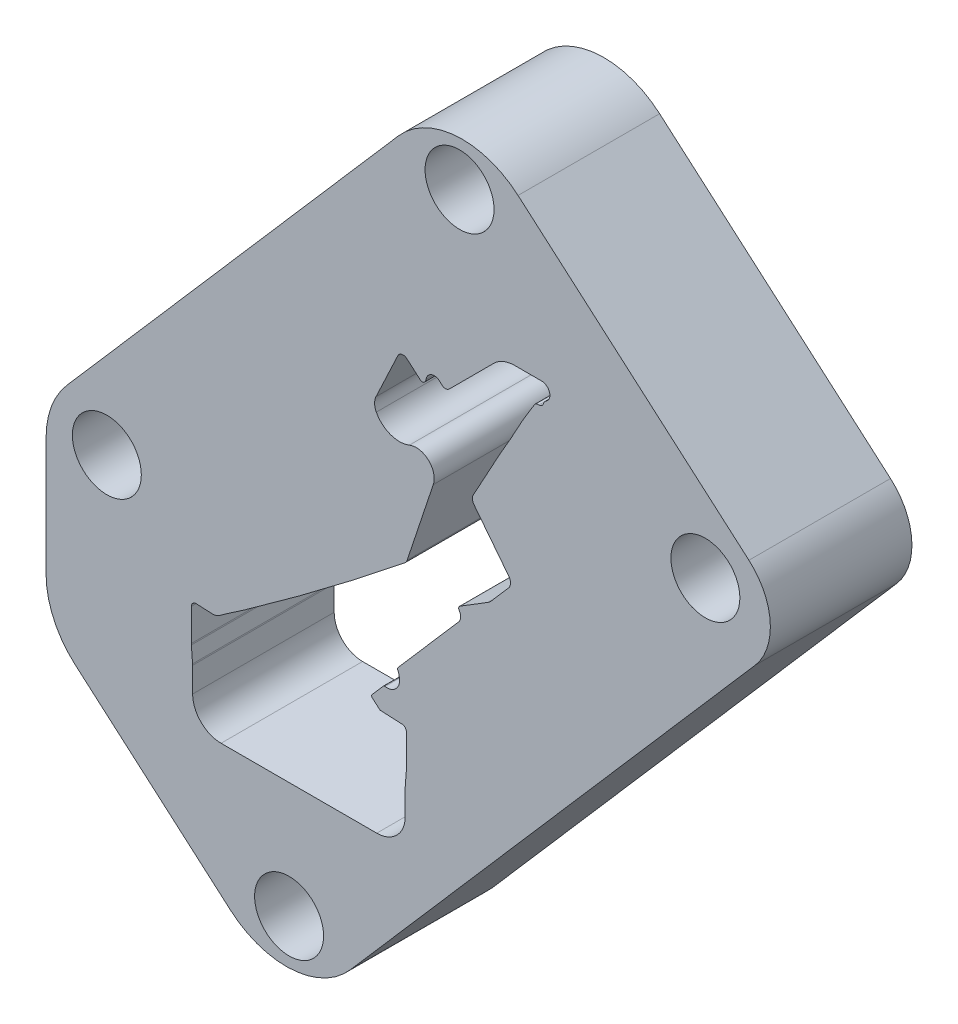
ISO-10303-21;
HEADER;
FILE_DESCRIPTION(('STEP AP214'),'2;1');
FILE_NAME('part.step','',(''),(''),'','','');
FILE_SCHEMA(('AUTOMOTIVE_DESIGN { 1 0 10303 214 1 1 1 1 }'));
ENDSEC;
DATA;
#1=APPLICATION_CONTEXT('core data for automotive mechanical design processes');
#2=APPLICATION_PROTOCOL_DEFINITION('international standard','automotive_design',2000,#1);
#3=PRODUCT_CONTEXT('',#1,'mechanical');
#4=PRODUCT('Part','Part','',(#3));
#5=PRODUCT_RELATED_PRODUCT_CATEGORY('part','',(#4));
#6=PRODUCT_DEFINITION_FORMATION('','',#4);
#7=PRODUCT_DEFINITION_CONTEXT('part definition',#1,'design');
#8=PRODUCT_DEFINITION('design','',#6,#7);
#9=PRODUCT_DEFINITION_SHAPE('','',#8);
#10=(LENGTH_UNIT() NAMED_UNIT(*) SI_UNIT(.MILLI.,.METRE.));
#11=(NAMED_UNIT(*) PLANE_ANGLE_UNIT() SI_UNIT($,.RADIAN.));
#12=(NAMED_UNIT(*) SI_UNIT($,.STERADIAN.) SOLID_ANGLE_UNIT());
#13=UNCERTAINTY_MEASURE_WITH_UNIT(LENGTH_MEASURE(1.E-05),#10,'distance_accuracy_value','');
#14=(GEOMETRIC_REPRESENTATION_CONTEXT(3) GLOBAL_UNCERTAINTY_ASSIGNED_CONTEXT((#13)) GLOBAL_UNIT_ASSIGNED_CONTEXT((#10,
#11,#12)) REPRESENTATION_CONTEXT('',''));
#15=CARTESIAN_POINT('',(0.,0.,0.));
#16=DIRECTION('',(0.,0.,1.));
#17=DIRECTION('',(1.,0.,0.));
#18=AXIS2_PLACEMENT_3D('',#15,#16,#17);
#19=CARTESIAN_POINT('',(-341.608584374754,24.8445872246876,-31.75));
#20=DIRECTION('',(0.,0.,1.));
#21=DIRECTION('',(1.,0.,0.));
#22=AXIS2_PLACEMENT_3D('',#19,#20,#21);
#23=CYLINDRICAL_SURFACE('',#22,19.05);
#24=CARTESIAN_POINT('',(-341.608584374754,24.8445872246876,0.));
#25=DIRECTION('',(0.,0.,1.));
#26=DIRECTION('',(1.,0.,0.));
#27=AXIS2_PLACEMENT_3D('',#24,#25,#26);
#28=CIRCLE('',#27,19.05);
#29=CARTESIAN_POINT('',(-329.117687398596,39.2279106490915,0.));
#30=VERTEX_POINT('',#29);
#31=CARTESIAN_POINT('',(-355.991907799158,37.3354842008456,0.));
#32=VERTEX_POINT('',#31);
#33=EDGE_CURVE('E1111',#30,#32,#28,.T.);
#34=ORIENTED_EDGE('',*,*,#33,.F.);
#35=DIRECTION('',(0.,0.,1.));
#36=VECTOR('',#35,1.);
#37=CARTESIAN_POINT('',(-329.117687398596,39.2279106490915,-31.75));
#38=LINE('',#37,#36);
#39=CARTESIAN_POINT('',(-329.117687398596,39.2279106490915,-31.75));
#40=VERTEX_POINT('',#39);
#41=EDGE_CURVE('E11',#40,#30,#38,.T.);
#42=ORIENTED_EDGE('',*,*,#41,.F.);
#43=CARTESIAN_POINT('',(-341.608584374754,24.8445872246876,-31.75));
#44=DIRECTION('',(0.,0.,1.));
#45=DIRECTION('',(1.,0.,0.));
#46=AXIS2_PLACEMENT_3D('',#43,#44,#45);
#47=CIRCLE('',#46,19.05);
#48=CARTESIAN_POINT('',(-355.991907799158,37.3354842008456,-31.75));
#49=VERTEX_POINT('',#48);
#50=EDGE_CURVE('E1112',#40,#49,#47,.T.);
#51=ORIENTED_EDGE('',*,*,#50,.T.);
#52=DIRECTION('',(0.,0.,1.));
#53=VECTOR('',#52,1.);
#54=CARTESIAN_POINT('',(-355.991907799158,37.3354842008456,-31.75));
#55=LINE('',#54,#53);
#56=EDGE_CURVE('E46',#49,#32,#55,.T.);
#57=ORIENTED_EDGE('',*,*,#56,.T.);
#58=EDGE_LOOP('',(#34,#42,#51,#57));
#59=FACE_BOUND('',#58,.T.);
#60=ADVANCED_FACE('F43',(#59),#23,.T.);
#61=CARTESIAN_POINT('',(-277.337723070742,-5.73931846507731,-31.75));
#62=DIRECTION('',(0.655690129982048,0.755030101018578,0.));
#63=DIRECTION('',(-0.755030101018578,0.655690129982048,0.));
#64=AXIS2_PLACEMENT_3D('',#61,#62,#63);
#65=PLANE('',#64);
#66=DIRECTION('',(-0.755030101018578,0.655690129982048,0.));
#67=VECTOR('',#66,1.);
#68=CARTESIAN_POINT('',(-277.337723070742,-5.73931846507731,0.));
#69=LINE('',#68,#67);
#70=CARTESIAN_POINT('',(-277.337723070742,-5.73931846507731,0.));
#71=VERTEX_POINT('',#70);
#72=EDGE_CURVE('E1116',#71,#30,#69,.T.);
#73=ORIENTED_EDGE('',*,*,#72,.F.);
#74=DIRECTION('',(0.,0.,1.));
#75=VECTOR('',#74,1.);
#76=CARTESIAN_POINT('',(-277.337723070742,-5.73931846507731,-31.75));
#77=LINE('',#76,#75);
#78=CARTESIAN_POINT('',(-277.337723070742,-5.73931846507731,-31.75));
#79=VERTEX_POINT('',#78);
#80=EDGE_CURVE('E51',#79,#71,#77,.T.);
#81=ORIENTED_EDGE('',*,*,#80,.F.);
#82=DIRECTION('',(-0.755030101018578,0.655690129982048,0.));
#83=VECTOR('',#82,1.);
#84=CARTESIAN_POINT('',(-277.337723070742,-5.73931846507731,-31.75));
#85=LINE('',#84,#83);
#86=EDGE_CURVE('E1140',#79,#40,#85,.T.);
#87=ORIENTED_EDGE('',*,*,#86,.T.);
#88=ORIENTED_EDGE('',*,*,#41,.T.);
#89=EDGE_LOOP('',(#73,#81,#87,#88));
#90=FACE_BOUND('',#89,.T.);
#91=ADVANCED_FACE('F1196',(#90),#65,.T.);
#92=CARTESIAN_POINT('',(-286.497714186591,-16.2870889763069,-31.75));
#93=DIRECTION('',(0.,0.,1.));
#94=DIRECTION('',(1.,0.,0.));
#95=AXIS2_PLACEMENT_3D('',#92,#93,#94);
#96=CYLINDRICAL_SURFACE('',#95,13.97);
#97=CARTESIAN_POINT('',(-286.497714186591,-16.2870889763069,0.));
#98=DIRECTION('',(0.,0.,1.));
#99=DIRECTION('',(-1.,0.,0.));
#100=AXIS2_PLACEMENT_3D('',#97,#98,#99);
#101=CIRCLE('',#100,13.97);
#102=CARTESIAN_POINT('',(-275.949943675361,-25.4470800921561,0.));
#103=VERTEX_POINT('',#102);
#104=EDGE_CURVE('E1166',#103,#71,#101,.T.);
#105=ORIENTED_EDGE('',*,*,#104,.F.);
#106=DIRECTION('',(0.,0.,1.));
#107=VECTOR('',#106,1.);
#108=CARTESIAN_POINT('',(-275.949943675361,-25.4470800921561,-31.75));
#109=LINE('',#108,#107);
#110=CARTESIAN_POINT('',(-275.949943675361,-25.4470800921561,-31.75));
#111=VERTEX_POINT('',#110);
#112=EDGE_CURVE('E1172',#111,#103,#109,.T.);
#113=ORIENTED_EDGE('',*,*,#112,.F.);
#114=CARTESIAN_POINT('',(-286.497714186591,-16.2870889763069,-31.75));
#115=DIRECTION('',(0.,0.,1.));
#116=DIRECTION('',(-1.,0.,0.));
#117=AXIS2_PLACEMENT_3D('',#114,#115,#116);
#118=CIRCLE('',#117,13.97);
#119=EDGE_CURVE('E1137',#111,#79,#118,.T.);
#120=ORIENTED_EDGE('',*,*,#119,.T.);
#121=ORIENTED_EDGE('',*,*,#80,.T.);
#122=EDGE_LOOP('',(#105,#113,#120,#121));
#123=FACE_BOUND('',#122,.T.);
#124=ADVANCED_FACE('F1225',(#123),#96,.T.);
#125=CARTESIAN_POINT('',(-275.949943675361,-25.4470800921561,-31.75));
#126=DIRECTION('',(0.755030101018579,-0.655690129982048,0.));
#127=DIRECTION('',(0.655690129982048,0.755030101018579,0.));
#128=AXIS2_PLACEMENT_3D('',#125,#126,#127);
#129=PLANE('',#128);
#130=DIRECTION('',(0.655690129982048,0.755030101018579,0.));
#131=VECTOR('',#130,1.);
#132=CARTESIAN_POINT('',(-275.949943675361,-25.4470800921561,0.));
#133=LINE('',#132,#131);
#134=CARTESIAN_POINT('',(-366.717128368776,-129.965896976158,0.));
#135=VERTEX_POINT('',#134);
#136=EDGE_CURVE('E1163',#135,#103,#133,.T.);
#137=ORIENTED_EDGE('',*,*,#136,.F.);
#138=DIRECTION('',(0.,0.,1.));
#139=VECTOR('',#138,1.);
#140=CARTESIAN_POINT('',(-366.717128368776,-129.965896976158,-31.75));
#141=LINE('',#140,#139);
#142=CARTESIAN_POINT('',(-366.717128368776,-129.965896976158,-31.75));
#143=VERTEX_POINT('',#142);
#144=EDGE_CURVE('E1174',#143,#135,#141,.T.);
#145=ORIENTED_EDGE('',*,*,#144,.F.);
#146=DIRECTION('',(0.655690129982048,0.755030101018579,0.));
#147=VECTOR('',#146,1.);
#148=CARTESIAN_POINT('',(-275.949943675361,-25.4470800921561,-31.75));
#149=LINE('',#148,#147);
#150=EDGE_CURVE('E1134',#143,#111,#149,.T.);
#151=ORIENTED_EDGE('',*,*,#150,.T.);
#152=ORIENTED_EDGE('',*,*,#112,.T.);
#153=EDGE_LOOP('',(#137,#145,#151,#152));
#154=FACE_BOUND('',#153,.T.);
#155=ADVANCED_FACE('F1223',(#154),#129,.T.);
#156=CARTESIAN_POINT('',(-381.10045179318,-117.475,-31.75));
#157=DIRECTION('',(0.,0.,1.));
#158=DIRECTION('',(1.,0.,0.));
#159=AXIS2_PLACEMENT_3D('',#156,#157,#158);
#160=CYLINDRICAL_SURFACE('',#159,19.05);
#161=CARTESIAN_POINT('',(-381.10045179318,-117.475,0.));
#162=DIRECTION('',(0.,0.,1.));
#163=DIRECTION('',(-1.,0.,0.));
#164=AXIS2_PLACEMENT_3D('',#161,#162,#163);
#165=CIRCLE('',#164,19.05);
#166=CARTESIAN_POINT('',(-393.591348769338,-131.858323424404,0.));
#167=VERTEX_POINT('',#166);
#168=EDGE_CURVE('E1160',#167,#135,#165,.T.);
#169=ORIENTED_EDGE('',*,*,#168,.F.);
#170=DIRECTION('',(0.,0.,1.));
#171=VECTOR('',#170,1.);
#172=CARTESIAN_POINT('',(-393.591348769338,-131.858323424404,-31.75));
#173=LINE('',#172,#171);
#174=CARTESIAN_POINT('',(-393.591348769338,-131.858323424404,-31.75));
#175=VERTEX_POINT('',#174);
#176=EDGE_CURVE('E1176',#175,#167,#173,.T.);
#177=ORIENTED_EDGE('',*,*,#176,.F.);
#178=CARTESIAN_POINT('',(-381.10045179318,-117.475,-31.75));
#179=DIRECTION('',(0.,0.,1.));
#180=DIRECTION('',(-1.,0.,0.));
#181=AXIS2_PLACEMENT_3D('',#178,#179,#180);
#182=CIRCLE('',#181,19.05);
#183=EDGE_CURVE('E1131',#175,#143,#182,.T.);
#184=ORIENTED_EDGE('',*,*,#183,.T.);
#185=ORIENTED_EDGE('',*,*,#144,.T.);
#186=EDGE_LOOP('',(#169,#177,#184,#185));
#187=FACE_BOUND('',#186,.T.);
#188=ADVANCED_FACE('F1219',(#187),#160,.T.);
#189=CARTESIAN_POINT('',(-393.591348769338,-131.858323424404,-31.75));
#190=DIRECTION('',(-0.655690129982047,-0.755030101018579,0.));
#191=DIRECTION('',(0.755030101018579,-0.655690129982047,0.));
#192=AXIS2_PLACEMENT_3D('',#189,#190,#191);
#193=PLANE('',#192);
#194=DIRECTION('',(0.755030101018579,-0.655690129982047,0.));
#195=VECTOR('',#194,1.);
#196=CARTESIAN_POINT('',(-393.591348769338,-131.858323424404,0.));
#197=LINE('',#196,#195);
#198=CARTESIAN_POINT('',(-428.415896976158,-101.615671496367,0.));
#199=VERTEX_POINT('',#198);
#200=EDGE_CURVE('E1157',#199,#167,#197,.T.);
#201=ORIENTED_EDGE('',*,*,#200,.F.);
#202=DIRECTION('',(0.,0.,1.));
#203=VECTOR('',#202,1.);
#204=CARTESIAN_POINT('',(-428.415896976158,-101.615671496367,-31.75));
#205=LINE('',#204,#203);
#206=CARTESIAN_POINT('',(-428.415896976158,-101.615671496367,-31.75));
#207=VERTEX_POINT('',#206);
#208=EDGE_CURVE('E1178',#207,#199,#205,.T.);
#209=ORIENTED_EDGE('',*,*,#208,.F.);
#210=DIRECTION('',(0.755030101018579,-0.655690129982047,0.));
#211=VECTOR('',#210,1.);
#212=CARTESIAN_POINT('',(-393.591348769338,-131.858323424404,-31.75));
#213=LINE('',#212,#211);
#214=EDGE_CURVE('E1128',#207,#175,#213,.T.);
#215=ORIENTED_EDGE('',*,*,#214,.T.);
#216=ORIENTED_EDGE('',*,*,#176,.T.);
#217=EDGE_LOOP('',(#201,#209,#215,#216));
#218=FACE_BOUND('',#217,.T.);
#219=ADVANCED_FACE('F1215',(#218),#193,.T.);
#220=CARTESIAN_POINT('',(-415.925,-87.2323480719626,-31.75));
#221=DIRECTION('',(0.,0.,1.));
#222=DIRECTION('',(1.,0.,0.));
#223=AXIS2_PLACEMENT_3D('',#220,#221,#222);
#224=CYLINDRICAL_SURFACE('',#223,19.0500000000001);
#225=CARTESIAN_POINT('',(-415.925,-87.2323480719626,0.));
#226=DIRECTION('',(0.,0.,1.));
#227=DIRECTION('',(-1.,0.,0.));
#228=AXIS2_PLACEMENT_3D('',#225,#226,#227);
#229=CIRCLE('',#228,19.0500000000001);
#230=CARTESIAN_POINT('',(-434.975,-87.2323480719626,0.));
#231=VERTEX_POINT('',#230);
#232=EDGE_CURVE('E1154',#231,#199,#229,.T.);
#233=ORIENTED_EDGE('',*,*,#232,.F.);
#234=DIRECTION('',(0.,0.,1.));
#235=VECTOR('',#234,1.);
#236=CARTESIAN_POINT('',(-434.975,-87.2323480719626,-31.75));
#237=LINE('',#236,#235);
#238=CARTESIAN_POINT('',(-434.975,-87.2323480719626,-31.75));
#239=VERTEX_POINT('',#238);
#240=EDGE_CURVE('E1180',#239,#231,#237,.T.);
#241=ORIENTED_EDGE('',*,*,#240,.F.);
#242=CARTESIAN_POINT('',(-415.925,-87.2323480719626,-31.75));
#243=DIRECTION('',(0.,0.,1.));
#244=DIRECTION('',(-1.,0.,0.));
#245=AXIS2_PLACEMENT_3D('',#242,#243,#244);
#246=CIRCLE('',#245,19.0500000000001);
#247=EDGE_CURVE('E1125',#239,#207,#246,.T.);
#248=ORIENTED_EDGE('',*,*,#247,.T.);
#249=ORIENTED_EDGE('',*,*,#208,.T.);
#250=EDGE_LOOP('',(#233,#241,#248,#249));
#251=FACE_BOUND('',#250,.T.);
#252=ADVANCED_FACE('F1211',(#251),#224,.T.);
#253=CARTESIAN_POINT('',(-434.975,-87.2323480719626,-31.75));
#254=DIRECTION('',(-1.,0.,0.));
#255=DIRECTION('',(0.,0.,1.));
#256=AXIS2_PLACEMENT_3D('',#253,#254,#255);
#257=PLANE('',#256);
#258=DIRECTION('',(0.,-1.,0.));
#259=VECTOR('',#258,1.);
#260=CARTESIAN_POINT('',(-434.975,-87.2323480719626,0.));
#261=LINE('',#260,#259);
#262=CARTESIAN_POINT('',(-434.975,-60.7310959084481,0.));
#263=VERTEX_POINT('',#262);
#264=EDGE_CURVE('E1151',#263,#231,#261,.T.);
#265=ORIENTED_EDGE('',*,*,#264,.F.);
#266=DIRECTION('',(0.,0.,1.));
#267=VECTOR('',#266,1.);
#268=CARTESIAN_POINT('',(-434.975,-60.7310959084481,-31.75));
#269=LINE('',#268,#267);
#270=CARTESIAN_POINT('',(-434.975,-60.7310959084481,-31.75));
#271=VERTEX_POINT('',#270);
#272=EDGE_CURVE('E1182',#271,#263,#269,.T.);
#273=ORIENTED_EDGE('',*,*,#272,.F.);
#274=DIRECTION('',(0.,-1.,0.));
#275=VECTOR('',#274,1.);
#276=CARTESIAN_POINT('',(-434.975,-87.2323480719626,-31.75));
#277=LINE('',#276,#275);
#278=EDGE_CURVE('E1122',#271,#239,#277,.T.);
#279=ORIENTED_EDGE('',*,*,#278,.T.);
#280=ORIENTED_EDGE('',*,*,#240,.T.);
#281=EDGE_LOOP('',(#265,#273,#279,#280));
#282=FACE_BOUND('',#281,.T.);
#283=ADVANCED_FACE('F1209',(#282),#257,.T.);
#284=CARTESIAN_POINT('',(-415.925,-60.7310959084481,-31.75));
#285=DIRECTION('',(0.,0.,1.));
#286=DIRECTION('',(1.,0.,0.));
#287=AXIS2_PLACEMENT_3D('',#284,#285,#286);
#288=CYLINDRICAL_SURFACE('',#287,19.05);
#289=CARTESIAN_POINT('',(-415.925,-60.7310959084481,0.));
#290=DIRECTION('',(0.,0.,1.));
#291=DIRECTION('',(1.,0.,0.));
#292=AXIS2_PLACEMENT_3D('',#289,#290,#291);
#293=CIRCLE('',#292,19.05);
#294=CARTESIAN_POINT('',(-430.308323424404,-48.2401989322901,0.));
#295=VERTEX_POINT('',#294);
#296=EDGE_CURVE('E1148',#295,#263,#293,.T.);
#297=ORIENTED_EDGE('',*,*,#296,.F.);
#298=DIRECTION('',(0.,0.,1.));
#299=VECTOR('',#298,1.);
#300=CARTESIAN_POINT('',(-430.308323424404,-48.2401989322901,-31.75));
#301=LINE('',#300,#299);
#302=CARTESIAN_POINT('',(-430.308323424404,-48.2401989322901,-31.75));
#303=VERTEX_POINT('',#302);
#304=EDGE_CURVE('E1183',#303,#295,#301,.T.);
#305=ORIENTED_EDGE('',*,*,#304,.F.);
#306=CARTESIAN_POINT('',(-415.925,-60.7310959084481,-31.75));
#307=DIRECTION('',(0.,0.,1.));
#308=DIRECTION('',(1.,0.,0.));
#309=AXIS2_PLACEMENT_3D('',#306,#307,#308);
#310=CIRCLE('',#309,19.05);
#311=EDGE_CURVE('E1119',#303,#271,#310,.T.);
#312=ORIENTED_EDGE('',*,*,#311,.T.);
#313=ORIENTED_EDGE('',*,*,#272,.T.);
#314=EDGE_LOOP('',(#297,#305,#312,#313));
#315=FACE_BOUND('',#314,.T.);
#316=ADVANCED_FACE('F1205',(#315),#288,.T.);
#317=CARTESIAN_POINT('',(-355.991907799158,37.3354842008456,-31.75));
#318=DIRECTION('',(-0.755030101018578,0.655690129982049,0.));
#319=DIRECTION('',(-0.655690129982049,-0.755030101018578,0.));
#320=AXIS2_PLACEMENT_3D('',#317,#318,#319);
#321=PLANE('',#320);
#322=DIRECTION('',(-0.655690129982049,-0.755030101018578,0.));
#323=VECTOR('',#322,1.);
#324=CARTESIAN_POINT('',(-355.991907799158,37.3354842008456,0.));
#325=LINE('',#324,#323);
#326=EDGE_CURVE('E1145',#32,#295,#325,.T.);
#327=ORIENTED_EDGE('',*,*,#326,.F.);
#328=ORIENTED_EDGE('',*,*,#56,.F.);
#329=DIRECTION('',(-0.655690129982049,-0.755030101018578,0.));
#330=VECTOR('',#329,1.);
#331=CARTESIAN_POINT('',(-355.991907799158,37.3354842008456,-31.75));
#332=LINE('',#331,#330);
#333=EDGE_CURVE('E1115',#49,#303,#332,.T.);
#334=ORIENTED_EDGE('',*,*,#333,.T.);
#335=ORIENTED_EDGE('',*,*,#304,.T.);
#336=EDGE_LOOP('',(#327,#328,#334,#335));
#337=FACE_BOUND('',#336,.T.);
#338=ADVANCED_FACE('F1191',(#337),#321,.T.);
#339=CARTESIAN_POINT('',(-341.608584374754,24.8445872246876,-31.75));
#340=DIRECTION('',(0.,0.,1.));
#341=DIRECTION('',(1.,0.,0.));
#342=AXIS2_PLACEMENT_3D('',#339,#340,#341);
#343=PLANE('',#342);
#344=DIRECTION('',(0.,1.,0.));
#345=VECTOR('',#344,1.);
#346=CARTESIAN_POINT('',(-354.13696,-77.5397114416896,-31.75));
#347=LINE('',#346,#345);
#348=CARTESIAN_POINT('',(-354.13696,-84.439802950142,-31.75));
#349=VERTEX_POINT('',#348);
#350=CARTESIAN_POINT('',(-354.13696,-77.5397114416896,-31.75));
#351=VERTEX_POINT('',#350);
#352=EDGE_CURVE('E930',#349,#351,#347,.T.);
#353=ORIENTED_EDGE('',*,*,#352,.T.);
#354=CARTESIAN_POINT('',(-355.219,-77.5397114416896,-31.75));
#355=DIRECTION('',(0.,0.,1.));
#356=DIRECTION('',(1.,0.,0.));
#357=AXIS2_PLACEMENT_3D('',#354,#355,#356);
#358=CIRCLE('',#357,1.0820400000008);
#359=CARTESIAN_POINT('',(-355.168063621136,-76.4588710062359,-31.75));
#360=VERTEX_POINT('',#359);
#361=EDGE_CURVE('E735',#351,#360,#358,.T.);
#362=ORIENTED_EDGE('',*,*,#361,.T.);
#363=DIRECTION('',(-0.998891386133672,0.0470743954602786,0.));
#364=VECTOR('',#363,1.);
#365=CARTESIAN_POINT('',(-355.168063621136,-76.4588710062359,-31.75));
#366=LINE('',#365,#364);
#367=CARTESIAN_POINT('',(-360.064038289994,-76.2281401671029,-31.75));
#368=VERTEX_POINT('',#367);
#369=EDGE_CURVE('E738',#360,#368,#366,.T.);
#370=ORIENTED_EDGE('',*,*,#369,.T.);
#371=DIRECTION('',(-0.755030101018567,0.655690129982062,0.));
#372=VECTOR('',#371,1.);
#373=CARTESIAN_POINT('',(-360.064038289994,-76.2281401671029,-31.75));
#374=LINE('',#373,#372);
#375=CARTESIAN_POINT('',(-361.809510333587,-74.7123214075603,-31.75));
#376=VERTEX_POINT('',#375);
#377=EDGE_CURVE('E59',#368,#376,#374,.T.);
#378=ORIENTED_EDGE('',*,*,#377,.T.);
#379=CARTESIAN_POINT('',(-361.51972152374,-74.3786283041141,-31.75));
#380=DIRECTION('',(0.,0.,-1.));
#381=DIRECTION('',(1.,0.,0.));
#382=AXIS2_PLACEMENT_3D('',#379,#380,#381);
#383=CIRCLE('',#382,0.441959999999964);
#384=CARTESIAN_POINT('',(-361.853414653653,-74.088839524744,-31.75));
#385=VERTEX_POINT('',#384);
#386=EDGE_CURVE('E741',#376,#385,#383,.T.);
#387=ORIENTED_EDGE('',*,*,#386,.T.);
#388=DIRECTION('',(0.655690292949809,0.755029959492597,0.));
#389=VECTOR('',#388,1.);
#390=CARTESIAN_POINT('',(-361.853414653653,-74.088839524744,-31.75));
#391=LINE('',#390,#389);
#392=CARTESIAN_POINT('',(-359.358052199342,-71.215420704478,-31.75));
#393=VERTEX_POINT('',#392);
#394=EDGE_CURVE('E744',#385,#393,#391,.T.);
#395=ORIENTED_EDGE('',*,*,#394,.T.);
#396=CARTESIAN_POINT('',(-359.024360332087,-71.5052082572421,-31.75));
#397=DIRECTION('',(0.,0.,-1.));
#398=DIRECTION('',(1.,0.,0.));
#399=AXIS2_PLACEMENT_3D('',#396,#397,#398);
#400=CIRCLE('',#399,0.441958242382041);
#401=CARTESIAN_POINT('',(-358.954407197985,-71.0688224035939,-31.75));
#402=VERTEX_POINT('',#401);
#403=EDGE_CURVE('E747',#393,#402,#400,.T.);
#404=ORIENTED_EDGE('',*,*,#403,.T.);
#405=CARTESIAN_POINT('',(-358.50805204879,-68.2843374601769,-31.75));
#406=DIRECTION('',(0.,0.,1.));
#407=DIRECTION('',(1.,0.,0.));
#408=AXIS2_PLACEMENT_3D('',#405,#406,#407);
#409=CIRCLE('',#408,2.820033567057);
#410=CARTESIAN_POINT('',(-355.708459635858,-67.9454054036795,-31.75));
#411=VERTEX_POINT('',#410);
#412=EDGE_CURVE('E750',#402,#411,#409,.T.);
#413=ORIENTED_EDGE('',*,*,#412,.T.);
#414=DIRECTION('',(-0.120174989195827,0.992752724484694,0.));
#415=VECTOR('',#414,1.);
#416=CARTESIAN_POINT('',(-355.708459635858,-67.9454054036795,-31.75));
#417=LINE('',#416,#415);
#418=CARTESIAN_POINT('',(-355.76551881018,-67.4740456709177,-31.75));
#419=VERTEX_POINT('',#418);
#420=EDGE_CURVE('E753',#411,#419,#417,.T.);
#421=ORIENTED_EDGE('',*,*,#420,.T.);
#422=CARTESIAN_POINT('',(-358.565115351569,-67.8129922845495,-31.75));
#423=DIRECTION('',(0.,0.,1.));
#424=DIRECTION('',(1.,0.,0.));
#425=AXIS2_PLACEMENT_3D('',#422,#423,#424);
#426=CIRCLE('',#425,2.82003999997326);
#427=CARTESIAN_POINT('',(-356.102210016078,-66.4394119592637,-31.75));
#428=VERTEX_POINT('',#427);
#429=EDGE_CURVE('E756',#419,#428,#426,.T.);
#430=ORIENTED_EDGE('',*,*,#429,.T.);
#431=CARTESIAN_POINT('',(-355.716220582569,-66.2241428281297,-31.75));
#432=DIRECTION('',(0.,0.,-1.));
#433=DIRECTION('',(1.,0.,0.));
#434=AXIS2_PLACEMENT_3D('',#431,#432,#433);
#435=CIRCLE('',#434,0.441959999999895);
#436=CARTESIAN_POINT('',(-356.049913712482,-65.9343540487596,-31.75));
#437=VERTEX_POINT('',#436);
#438=EDGE_CURVE('E759',#428,#437,#435,.T.);
#439=ORIENTED_EDGE('',*,*,#438,.T.);
#440=DIRECTION('',(0.655690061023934,0.755030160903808,0.));
#441=VECTOR('',#440,1.);
#442=CARTESIAN_POINT('',(-356.049913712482,-65.9343540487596,-31.75));
#443=LINE('',#442,#441);
#444=CARTESIAN_POINT('',(-342.441341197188,-50.2640193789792,-31.75));
#445=VERTEX_POINT('',#444);
#446=EDGE_CURVE('E762',#437,#445,#443,.T.);
#447=ORIENTED_EDGE('',*,*,#446,.T.);
#448=CARTESIAN_POINT('',(-343.833647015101,-49.0549006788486,-31.75));
#449=DIRECTION('',(0.,0.,1.));
#450=DIRECTION('',(1.,0.,0.));
#451=AXIS2_PLACEMENT_3D('',#448,#449,#450);
#452=CIRCLE('',#451,1.84404);
#453=CARTESIAN_POINT('',(-342.309268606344,-48.0172331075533,-31.75));
#454=VERTEX_POINT('',#453);
#455=EDGE_CURVE('E765',#445,#454,#452,.T.);
#456=ORIENTED_EDGE('',*,*,#455,.T.);
#457=CARTESIAN_POINT('',(-341.7339522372,-47.6256065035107,-31.75));
#458=DIRECTION('',(0.,0.,-1.));
#459=DIRECTION('',(1.,0.,0.));
#460=AXIS2_PLACEMENT_3D('',#457,#458,#459);
#461=CIRCLE('',#460,0.695959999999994);
#462=CARTESIAN_POINT('',(-342.099390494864,-47.0333099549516,-31.75));
#463=VERTEX_POINT('',#462);
#464=EDGE_CURVE('E768',#454,#463,#461,.T.);
#465=ORIENTED_EDGE('',*,*,#464,.T.);
#466=DIRECTION('',(0.851049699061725,0.525085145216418,0.));
#467=VECTOR('',#466,1.);
#468=CARTESIAN_POINT('',(-342.099390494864,-47.0333099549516,-31.75));
#469=LINE('',#468,#467);
#470=CARTESIAN_POINT('',(-335.919084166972,-43.2201518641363,-31.75));
#471=VERTEX_POINT('',#470);
#472=EDGE_CURVE('E771',#463,#471,#469,.T.);
#473=ORIENTED_EDGE('',*,*,#472,.T.);
#474=CARTESIAN_POINT('',(-337.754277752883,-40.2456991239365,-31.75));
#475=DIRECTION('',(0.,0.,1.));
#476=DIRECTION('',(1.,0.,0.));
#477=AXIS2_PLACEMENT_3D('',#474,#475,#476);
#478=CIRCLE('',#477,3.49503999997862);
#479=CARTESIAN_POINT('',(-335.115417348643,-42.5373623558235,-31.75));
#480=VERTEX_POINT('',#479);
#481=EDGE_CURVE('E774',#471,#480,#478,.T.);
#482=ORIENTED_EDGE('',*,*,#481,.T.);
#483=DIRECTION('',(0.655690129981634,0.755030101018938,0.));
#484=VECTOR('',#483,1.);
#485=CARTESIAN_POINT('',(-335.115417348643,-42.5373623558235,-31.75));
#486=LINE('',#485,#484);
#487=CARTESIAN_POINT('',(-331.258982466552,-38.0966604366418,-31.75));
#488=VERTEX_POINT('',#487);
#489=EDGE_CURVE('E777',#480,#488,#486,.T.);
#490=ORIENTED_EDGE('',*,*,#489,.T.);
#491=CARTESIAN_POINT('',(-332.651288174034,-36.8875416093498,-31.75));
#492=DIRECTION('',(0.,0.,1.));
#493=DIRECTION('',(1.,0.,0.));
#494=AXIS2_PLACEMENT_3D('',#491,#492,#493);
#495=CIRCLE('',#494,1.84404000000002);
#496=CARTESIAN_POINT('',(-331.198719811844,-35.7515272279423,-31.75));
#497=VERTEX_POINT('',#496);
#498=EDGE_CURVE('E780',#488,#497,#495,.T.);
#499=ORIENTED_EDGE('',*,*,#498,.T.);
#500=DIRECTION('',(-0.616046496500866,0.787709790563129,0.));
#501=VECTOR('',#500,1.);
#502=CARTESIAN_POINT('',(-331.198719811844,-35.7515272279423,-31.75));
#503=LINE('',#502,#501);
#504=CARTESIAN_POINT('',(-338.994064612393,-25.7839850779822,-31.75));
#505=VERTEX_POINT('',#504);
#506=EDGE_CURVE('E783',#497,#505,#503,.T.);
#507=ORIENTED_EDGE('',*,*,#506,.T.);
#508=CARTESIAN_POINT('',(-337.670741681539,-24.7490541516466,-31.75));
#509=DIRECTION('',(0.,0.,-1.));
#510=DIRECTION('',(1.,0.,0.));
#511=AXIS2_PLACEMENT_3D('',#508,#509,#510);
#512=CIRCLE('',#511,1.67996000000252);
#513=CARTESIAN_POINT('',(-339.145023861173,-23.9435992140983,-31.75));
#514=VERTEX_POINT('',#513);
#515=EDGE_CURVE('E786',#505,#514,#512,.T.);
#516=ORIENTED_EDGE('',*,*,#515,.T.);
#517=DIRECTION('',(0.479448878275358,0.877569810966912,0.));
#518=VECTOR('',#517,1.);
#519=CARTESIAN_POINT('',(-339.145023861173,-23.9435992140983,-31.75));
#520=LINE('',#519,#518);
#521=CARTESIAN_POINT('',(-333.295726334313,-13.2372086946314,-31.75));
#522=VERTEX_POINT('',#521);
#523=EDGE_CURVE('E789',#514,#522,#520,.T.);
#524=ORIENTED_EDGE('',*,*,#523,.T.);
#525=DIRECTION('',(0.497982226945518,0.86718723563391,0.));
#526=VECTOR('',#525,1.);
#527=CARTESIAN_POINT('',(-333.295726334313,-13.2372086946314,-31.75));
#528=LINE('',#527,#526);
#529=CARTESIAN_POINT('',(-330.713357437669,-8.74026638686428,-31.75));
#530=VERTEX_POINT('',#529);
#531=EDGE_CURVE('E792',#522,#530,#528,.T.);
#532=ORIENTED_EDGE('',*,*,#531,.T.);
#533=DIRECTION('',(0.47944887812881,0.877569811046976,0.));
#534=VECTOR('',#533,1.);
#535=CARTESIAN_POINT('',(-330.713357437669,-8.74026638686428,-31.75));
#536=LINE('',#535,#534);
#537=CARTESIAN_POINT('',(-328.54235452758,-4.76652340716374,-31.75));
#538=VERTEX_POINT('',#537);
#539=EDGE_CURVE('E795',#530,#538,#536,.T.);
#540=ORIENTED_EDGE('',*,*,#539,.T.);
#541=CARTESIAN_POINT('',(-246.298222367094,-50.4460704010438,-31.75));
#542=DIRECTION('',(0.,0.,-1.));
#543=DIRECTION('',(1.,0.,0.));
#544=AXIS2_PLACEMENT_3D('',#541,#542,#543);
#545=CIRCLE('',#544,94.0782561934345);
#546=CARTESIAN_POINT('',(-328.109942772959,-3.99652042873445,-31.75));
#547=VERTEX_POINT('',#546);
#548=EDGE_CURVE('E798',#538,#547,#545,.T.);
#549=ORIENTED_EDGE('',*,*,#548,.T.);
#550=CARTESIAN_POINT('',(-295.384101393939,-22.8808363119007,-31.75));
#551=DIRECTION('',(0.,0.,-1.));
#552=DIRECTION('',(1.,0.,0.));
#553=AXIS2_PLACEMENT_3D('',#550,#551,#552);
#554=CIRCLE('',#553,37.7835689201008);
#555=CARTESIAN_POINT('',(-327.659514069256,-3.23660517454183,-31.75));
#556=VERTEX_POINT('',#555);
#557=EDGE_CURVE('E801',#547,#556,#554,.T.);
#558=ORIENTED_EDGE('',*,*,#557,.T.);
#559=CARTESIAN_POINT('',(-213.805214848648,-69.953775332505,-31.75));
#560=DIRECTION('',(0.,0.,-1.));
#561=DIRECTION('',(1.,0.,0.));
#562=AXIS2_PLACEMENT_3D('',#559,#560,#561);
#563=CIRCLE('',#562,131.96204850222);
#564=CARTESIAN_POINT('',(-325.396096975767,0.48383728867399,-31.75));
#565=VERTEX_POINT('',#564);
#566=EDGE_CURVE('E804',#556,#565,#563,.T.);
#567=ORIENTED_EDGE('',*,*,#566,.T.);
#568=CARTESIAN_POINT('',(-324.821103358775,0.120893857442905,-31.75));
#569=DIRECTION('',(0.,0.,-1.));
#570=DIRECTION('',(1.,0.,0.));
#571=AXIS2_PLACEMENT_3D('',#568,#569,#570);
#572=CIRCLE('',#571,0.679959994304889);
#573=CARTESIAN_POINT('',(-325.147132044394,0.717593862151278,-31.75));
#574=VERTEX_POINT('',#573);
#575=EDGE_CURVE('E807',#565,#574,#572,.T.);
#576=ORIENTED_EDGE('',*,*,#575,.T.);
#577=CARTESIAN_POINT('',(-324.533414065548,-0.405637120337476,-31.75));
#578=DIRECTION('',(0.,0.,-1.));
#579=DIRECTION('',(1.,0.,0.));
#580=AXIS2_PLACEMENT_3D('',#577,#578,#579);
#581=CIRCLE('',#580,1.27995999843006);
#582=CARTESIAN_POINT('',(-324.437274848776,0.870707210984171,-31.75));
#583=VERTEX_POINT('',#582);
#584=EDGE_CURVE('E810',#574,#583,#581,.T.);
#585=ORIENTED_EDGE('',*,*,#584,.T.);
#586=CARTESIAN_POINT('',(-324.369025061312,1.77684997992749,-31.75));
#587=DIRECTION('',(0.,0.,1.));
#588=DIRECTION('',(1.,0.,0.));
#589=AXIS2_PLACEMENT_3D('',#586,#587,#588);
#590=CIRCLE('',#589,0.908709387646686);
#591=CARTESIAN_POINT('',(-323.536149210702,1.41343483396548,-31.75));
#592=VERTEX_POINT('',#591);
#593=EDGE_CURVE('E813',#583,#592,#590,.T.);
#594=ORIENTED_EDGE('',*,*,#593,.T.);
#595=CARTESIAN_POINT('',(-274.821127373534,-19.8427665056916,-31.75));
#596=DIRECTION('',(0.,0.,-1.));
#597=DIRECTION('',(1.,0.,0.));
#598=AXIS2_PLACEMENT_3D('',#595,#596,#597);
#599=CIRCLE('',#598,53.1505357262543);
#600=CARTESIAN_POINT('',(-323.332008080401,1.87528821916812,-31.75));
#601=VERTEX_POINT('',#600);
#602=EDGE_CURVE('E816',#592,#601,#599,.T.);
#603=ORIENTED_EDGE('',*,*,#602,.T.);
#604=CARTESIAN_POINT('',(-322.233145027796,1.3833332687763,-31.75));
#605=DIRECTION('',(0.,0.,-1.));
#606=DIRECTION('',(1.,0.,0.));
#607=AXIS2_PLACEMENT_3D('',#604,#605,#606);
#608=CIRCLE('',#607,1.20395999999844);
#609=CARTESIAN_POINT('',(-322.860539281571,2.41090133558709,-31.75));
#610=VERTEX_POINT('',#609);
#611=EDGE_CURVE('E819',#601,#610,#608,.T.);
#612=ORIENTED_EDGE('',*,*,#611,.T.);
#613=CARTESIAN_POINT('',(-323.821484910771,3.98477141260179,-31.75));
#614=DIRECTION('',(0.,0.,1.));
#615=DIRECTION('',(1.,0.,0.));
#616=AXIS2_PLACEMENT_3D('',#613,#614,#615);
#617=CIRCLE('',#616,1.84404000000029);
#618=CARTESIAN_POINT('',(-323.821484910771,5.82881141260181,-31.75));
#619=VERTEX_POINT('',#618);
#620=EDGE_CURVE('E822',#610,#619,#617,.T.);
#621=ORIENTED_EDGE('',*,*,#620,.T.);
#622=DIRECTION('',(-1.,0.,0.));
#623=VECTOR('',#622,1.);
#624=CARTESIAN_POINT('',(-323.821484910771,5.82881141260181,-31.75));
#625=LINE('',#624,#623);
#626=CARTESIAN_POINT('',(-329.866864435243,5.82881141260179,-31.75));
#627=VERTEX_POINT('',#626);
#628=EDGE_CURVE('E825',#619,#627,#625,.T.);
#629=ORIENTED_EDGE('',*,*,#628,.T.);
#630=CARTESIAN_POINT('',(-329.866864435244,-0.841228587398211,-31.75));
#631=DIRECTION('',(0.,0.,1.));
#632=DIRECTION('',(1.,0.,0.));
#633=AXIS2_PLACEMENT_3D('',#630,#631,#632);
#634=CIRCLE('',#633,6.67004);
#635=CARTESIAN_POINT('',(-334.583294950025,3.87520192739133,-31.75));
#636=VERTEX_POINT('',#635);
#637=EDGE_CURVE('E828',#627,#636,#634,.T.);
#638=ORIENTED_EDGE('',*,*,#637,.T.);
#639=DIRECTION('',(-0.707106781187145,-0.70710678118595,0.));
#640=VECTOR('',#639,1.);
#641=CARTESIAN_POINT('',(-334.583294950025,3.87520192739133,-31.75));
#642=LINE('',#641,#640);
#643=CARTESIAN_POINT('',(-344.543862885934,-6.08536600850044,-31.75));
#644=VERTEX_POINT('',#643);
#645=EDGE_CURVE('E831',#636,#644,#642,.T.);
#646=ORIENTED_EDGE('',*,*,#645,.T.);
#647=CARTESIAN_POINT('',(-345.395191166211,-5.23403772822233,-31.75));
#648=DIRECTION('',(0.,0.,-1.));
#649=DIRECTION('',(1.,0.,0.));
#650=AXIS2_PLACEMENT_3D('',#647,#648,#649);
#651=CIRCLE('',#650,1.20396000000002);
#652=CARTESIAN_POINT('',(-346.246519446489,-6.08536600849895,-31.75));
#653=VERTEX_POINT('',#652);
#654=EDGE_CURVE('E834',#644,#653,#651,.T.);
#655=ORIENTED_EDGE('',*,*,#654,.T.);
#656=DIRECTION('',(-0.707106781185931,0.707106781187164,0.));
#657=VECTOR('',#656,1.);
#658=CARTESIAN_POINT('',(-346.246519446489,-6.08536600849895,-31.75));
#659=LINE('',#658,#657);
#660=CARTESIAN_POINT('',(-346.605729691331,-5.72615576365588,-31.75));
#661=VERTEX_POINT('',#660);
#662=EDGE_CURVE('E837',#653,#661,#659,.T.);
#663=ORIENTED_EDGE('',*,*,#662,.T.);
#664=CARTESIAN_POINT('',(-347.909662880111,-7.03008895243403,-31.75));
#665=DIRECTION('',(0.,0.,1.));
#666=DIRECTION('',(1.,0.,0.));
#667=AXIS2_PLACEMENT_3D('',#664,#665,#666);
#668=CIRCLE('',#667,1.84403999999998);
#669=CARTESIAN_POINT('',(-349.738283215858,-6.79211586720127,-31.75));
#670=VERTEX_POINT('',#669);
#671=EDGE_CURVE('E840',#661,#670,#668,.T.);
#672=ORIENTED_EDGE('',*,*,#671,.T.);
#673=CARTESIAN_POINT('',(-350.932175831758,-6.63674500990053,-31.75));
#674=DIRECTION('',(0.,0.,-1.));
#675=DIRECTION('',(1.,0.,0.));
#676=AXIS2_PLACEMENT_3D('',#673,#674,#675);
#677=CIRCLE('',#676,1.20396000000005);
#678=CARTESIAN_POINT('',(-350.023149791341,-7.42616969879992,-31.75));
#679=VERTEX_POINT('',#678);
#680=EDGE_CURVE('E843',#670,#679,#677,.T.);
#681=ORIENTED_EDGE('',*,*,#680,.T.);
#682=DIRECTION('',(-0.655690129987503,-0.755030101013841,0.));
#683=VECTOR('',#682,1.);
#684=CARTESIAN_POINT('',(-350.023149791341,-7.42616969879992,-31.75));
#685=LINE('',#684,#683);
#686=CARTESIAN_POINT('',(-350.071419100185,-7.48175202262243,-31.75));
#687=VERTEX_POINT('',#686);
#688=EDGE_CURVE('E846',#679,#687,#685,.T.);
#689=ORIENTED_EDGE('',*,*,#688,.T.);
#690=CARTESIAN_POINT('',(-350.596889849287,-7.02541791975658,-31.75));
#691=DIRECTION('',(0.,0.,-1.));
#692=DIRECTION('',(1.,0.,0.));
#693=AXIS2_PLACEMENT_3D('',#690,#691,#692);
#694=CIRCLE('',#693,0.69596);
#695=CARTESIAN_POINT('',(-351.053223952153,-7.55088866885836,-31.75));
#696=VERTEX_POINT('',#695);
#697=EDGE_CURVE('E849',#687,#696,#694,.T.);
#698=ORIENTED_EDGE('',*,*,#697,.T.);
#699=DIRECTION('',(-0.755030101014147,0.655690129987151,0.));
#700=VECTOR('',#699,1.);
#701=CARTESIAN_POINT('',(-351.053223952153,-7.55088866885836,-31.75));
#702=LINE('',#701,#700);
#703=CARTESIAN_POINT('',(-354.029889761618,-4.96586538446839,-31.75));
#704=VERTEX_POINT('',#703);
#705=EDGE_CURVE('E852',#696,#704,#702,.T.);
#706=ORIENTED_EDGE('',*,*,#705,.T.);
#707=CARTESIAN_POINT('',(-354.895426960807,-5.9625353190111,-31.75));
#708=DIRECTION('',(0.,0.,1.));
#709=DIRECTION('',(1.,0.,0.));
#710=AXIS2_PLACEMENT_3D('',#707,#708,#709);
#711=CIRCLE('',#710,1.32003999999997);
#712=CARTESIAN_POINT('',(-356.089841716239,-5.4005041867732,-31.75));
#713=VERTEX_POINT('',#712);
#714=EDGE_CURVE('E855',#704,#713,#711,.T.);
#715=ORIENTED_EDGE('',*,*,#714,.T.);
#716=DIRECTION('',(-0.425768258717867,-0.904832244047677,0.));
#717=VECTOR('',#716,1.);
#718=CARTESIAN_POINT('',(-356.089841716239,-5.4005041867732,-31.75));
#719=LINE('',#718,#717);
#720=CARTESIAN_POINT('',(-360.978029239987,-15.7887602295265,-31.75));
#721=VERTEX_POINT('',#720);
#722=EDGE_CURVE('E858',#713,#721,#719,.T.);
#723=ORIENTED_EDGE('',*,*,#722,.T.);
#724=CARTESIAN_POINT('',(-357.977308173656,-17.2007476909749,-31.75));
#725=DIRECTION('',(0.,0.,1.));
#726=DIRECTION('',(1.,0.,0.));
#727=AXIS2_PLACEMENT_3D('',#724,#725,#726);
#728=CIRCLE('',#727,3.31632861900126);
#729=CARTESIAN_POINT('',(-360.908651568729,-18.7516382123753,-31.75));
#730=VERTEX_POINT('',#729);
#731=EDGE_CURVE('E861',#721,#730,#728,.T.);
#732=ORIENTED_EDGE('',*,*,#731,.T.);
#733=CARTESIAN_POINT('',(-355.705949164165,-15.9990361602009,-31.75));
#734=DIRECTION('',(0.,0.,1.));
#735=DIRECTION('',(1.,0.,0.));
#736=AXIS2_PLACEMENT_3D('',#733,#734,#735);
#737=CIRCLE('',#736,5.88599442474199);
#738=CARTESIAN_POINT('',(-353.482996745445,-21.4491199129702,-31.75));
#739=VERTEX_POINT('',#738);
#740=EDGE_CURVE('E864',#730,#739,#737,.T.);
#741=ORIENTED_EDGE('',*,*,#740,.T.);
#742=CARTESIAN_POINT('',(-351.961009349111,-25.1806252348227,-31.75));
#743=DIRECTION('',(0.,0.,-1.));
#744=DIRECTION('',(1.,0.,0.));
#745=AXIS2_PLACEMENT_3D('',#742,#743,#744);
#746=CIRCLE('',#745,4.02996000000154);
#747=CARTESIAN_POINT('',(-348.136876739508,-26.4520761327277,-31.75));
#748=VERTEX_POINT('',#747);
#749=EDGE_CURVE('E867',#739,#748,#746,.T.);
#750=ORIENTED_EDGE('',*,*,#749,.T.);
#751=DIRECTION('',(-0.315500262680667,-0.948925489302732,0.));
#752=VECTOR('',#751,1.);
#753=CARTESIAN_POINT('',(-348.136876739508,-26.4520761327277,-31.75));
#754=LINE('',#753,#752);
#755=CARTESIAN_POINT('',(-353.991588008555,-44.0612048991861,-31.75));
#756=VERTEX_POINT('',#755);
#757=EDGE_CURVE('E870',#748,#756,#754,.T.);
#758=ORIENTED_EDGE('',*,*,#757,.T.);
#759=CARTESIAN_POINT('',(-355.585744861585,-43.5311770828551,-31.75));
#760=DIRECTION('',(0.,0.,-1.));
#761=DIRECTION('',(1.,0.,0.));
#762=AXIS2_PLACEMENT_3D('',#759,#760,#761);
#763=CIRCLE('',#762,1.67995998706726);
#764=CARTESIAN_POINT('',(-354.531224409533,-44.8389431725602,-31.75));
#765=VERTEX_POINT('',#764);
#766=EDGE_CURVE('E873',#756,#765,#763,.T.);
#767=ORIENTED_EDGE('',*,*,#766,.T.);
#768=CARTESIAN_POINT('',(-793.724322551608,499.827439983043,-31.75));
#769=DIRECTION('',(0.,0.,-1.));
#770=DIRECTION('',(1.,0.,0.));
#771=AXIS2_PLACEMENT_3D('',#768,#769,#770);
#772=CIRCLE('',#771,699.679959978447);
#773=CARTESIAN_POINT('',(-390.375522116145,-71.8908399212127,-31.75));
#774=VERTEX_POINT('',#773);
#775=EDGE_CURVE('E876',#765,#774,#772,.T.);
#776=ORIENTED_EDGE('',*,*,#775,.T.);
#777=DIRECTION('',(-0.82527680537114,-0.564728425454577,0.));
#778=VECTOR('',#777,1.);
#779=CARTESIAN_POINT('',(-390.375522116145,-71.8908399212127,-31.75));
#780=LINE('',#779,#778);
#781=CARTESIAN_POINT('',(-394.251596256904,-74.5431975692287,-31.75));
#782=VERTEX_POINT('',#781);
#783=EDGE_CURVE('E879',#774,#782,#780,.T.);
#784=ORIENTED_EDGE('',*,*,#783,.T.);
#785=CARTESIAN_POINT('',(-95.1890556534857,-497.808611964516,-31.75));
#786=DIRECTION('',(0.,0.,1.));
#787=DIRECTION('',(1.,0.,0.));
#788=AXIS2_PLACEMENT_3D('',#785,#786,#787);
#789=CIRCLE('',#788,518.258636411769);
#790=CARTESIAN_POINT('',(-396.052036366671,-75.8210753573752,-31.75));
#791=VERTEX_POINT('',#790);
#792=EDGE_CURVE('E882',#782,#791,#789,.T.);
#793=ORIENTED_EDGE('',*,*,#792,.T.);
#794=CARTESIAN_POINT('',(-397.635690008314,-73.599857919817,-31.75));
#795=DIRECTION('',(0.,0.,-1.));
#796=DIRECTION('',(1.,0.,0.));
#797=AXIS2_PLACEMENT_3D('',#794,#795,#796);
#798=CIRCLE('',#797,2.72796000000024);
#799=CARTESIAN_POINT('',(-397.764107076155,-76.3247936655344,-31.75));
#800=VERTEX_POINT('',#799);
#801=EDGE_CURVE('E885',#791,#800,#798,.T.);
#802=ORIENTED_EDGE('',*,*,#801,.T.);
#803=DIRECTION('',(-0.998891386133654,0.0470743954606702,0.));
#804=VECTOR('',#803,1.);
#805=CARTESIAN_POINT('',(-397.764107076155,-76.3247936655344,-31.75));
#806=LINE('',#805,#804);
#807=CARTESIAN_POINT('',(-401.269063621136,-76.1596168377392,-31.75));
#808=VERTEX_POINT('',#807);
#809=EDGE_CURVE('E888',#800,#808,#806,.T.);
#810=ORIENTED_EDGE('',*,*,#809,.T.);
#811=CARTESIAN_POINT('',(-401.32,-77.240457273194,-31.75));
#812=DIRECTION('',(0.,0.,1.));
#813=DIRECTION('',(1.,0.,0.));
#814=AXIS2_PLACEMENT_3D('',#811,#812,#813);
#815=CIRCLE('',#814,1.08204000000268);
#816=CARTESIAN_POINT('',(-402.402040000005,-77.240457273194,-31.75));
#817=VERTEX_POINT('',#816);
#818=EDGE_CURVE('E891',#808,#817,#815,.T.);
#819=ORIENTED_EDGE('',*,*,#818,.T.);
#820=DIRECTION('',(2.39028068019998E-13,-1.,0.));
#821=VECTOR('',#820,1.);
#822=CARTESIAN_POINT('',(-402.402040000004,-84.4398029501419,-31.75));
#823=LINE('',#822,#821);
#824=CARTESIAN_POINT('',(-402.402040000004,-84.4398029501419,-31.75));
#825=VERTEX_POINT('',#824);
#826=EDGE_CURVE('E894',#817,#825,#823,.T.);
#827=ORIENTED_EDGE('',*,*,#826,.T.);
#828=CARTESIAN_POINT('',(-398.719040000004,-84.4398029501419,-31.75));
#829=DIRECTION('',(0.,0.,1.));
#830=DIRECTION('',(1.,0.,0.));
#831=AXIS2_PLACEMENT_3D('',#828,#829,#830);
#832=CIRCLE('',#831,3.68299999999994);
#833=CARTESIAN_POINT('',(-402.391076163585,-84.7237737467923,-31.75));
#834=VERTEX_POINT('',#833);
#835=EDGE_CURVE('E897',#825,#834,#832,.T.);
#836=ORIENTED_EDGE('',*,*,#835,.T.);
#837=DIRECTION('',(0.0771031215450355,-0.99702312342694,0.));
#838=VECTOR('',#837,1.);
#839=CARTESIAN_POINT('',(-402.118363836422,-88.2502262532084,-31.75));
#840=LINE('',#839,#838);
#841=CARTESIAN_POINT('',(-402.118363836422,-88.2502262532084,-31.75));
#842=VERTEX_POINT('',#841);
#843=EDGE_CURVE('E900',#834,#842,#840,.T.);
#844=ORIENTED_EDGE('',*,*,#843,.T.);
#845=CARTESIAN_POINT('',(-405.790400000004,-88.5341970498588,-31.75));
#846=DIRECTION('',(0.,0.,-1.));
#847=DIRECTION('',(1.,0.,0.));
#848=AXIS2_PLACEMENT_3D('',#845,#846,#847);
#849=CIRCLE('',#848,3.68300000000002);
#850=CARTESIAN_POINT('',(-402.107400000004,-88.5341970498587,-31.75));
#851=VERTEX_POINT('',#850);
#852=EDGE_CURVE('E903',#842,#851,#849,.T.);
#853=ORIENTED_EDGE('',*,*,#852,.T.);
#854=DIRECTION('',(6.47470377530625E-13,-1.,0.));
#855=VECTOR('',#854,1.);
#856=CARTESIAN_POINT('',(-402.1074,-94.107,-31.75));
#857=LINE('',#856,#855);
#858=CARTESIAN_POINT('',(-402.1074,-94.107,-31.75));
#859=VERTEX_POINT('',#858);
#860=EDGE_CURVE('E906',#851,#859,#857,.T.);
#861=ORIENTED_EDGE('',*,*,#860,.T.);
#862=CARTESIAN_POINT('',(-395.732,-94.107,-31.75));
#863=DIRECTION('',(0.,0.,1.));
#864=DIRECTION('',(1.,0.,0.));
#865=AXIS2_PLACEMENT_3D('',#862,#863,#864);
#866=CIRCLE('',#865,6.37540000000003);
#867=CARTESIAN_POINT('',(-395.732,-100.4824,-31.75));
#868=VERTEX_POINT('',#867);
#869=EDGE_CURVE('E909',#859,#868,#866,.T.);
#870=ORIENTED_EDGE('',*,*,#869,.T.);
#871=DIRECTION('',(1.,0.,0.));
#872=VECTOR('',#871,1.);
#873=CARTESIAN_POINT('',(-395.732,-100.4824,-31.75));
#874=LINE('',#873,#872);
#875=CARTESIAN_POINT('',(-360.807,-100.4824,-31.75));
#876=VERTEX_POINT('',#875);
#877=EDGE_CURVE('E912',#868,#876,#874,.T.);
#878=ORIENTED_EDGE('',*,*,#877,.T.);
#879=CARTESIAN_POINT('',(-360.807,-94.107,-31.75));
#880=DIRECTION('',(0.,0.,1.));
#881=DIRECTION('',(1.,0.,0.));
#882=AXIS2_PLACEMENT_3D('',#879,#880,#881);
#883=CIRCLE('',#882,6.37539999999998);
#884=CARTESIAN_POINT('',(-354.4316,-94.107,-31.75));
#885=VERTEX_POINT('',#884);
#886=EDGE_CURVE('E915',#876,#885,#883,.T.);
#887=ORIENTED_EDGE('',*,*,#886,.T.);
#888=DIRECTION('',(0.,1.,0.));
#889=VECTOR('',#888,1.);
#890=CARTESIAN_POINT('',(-354.4316,-88.5341970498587,-31.75));
#891=LINE('',#890,#889);
#892=CARTESIAN_POINT('',(-354.4316,-88.5341970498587,-31.75));
#893=VERTEX_POINT('',#892);
#894=EDGE_CURVE('E918',#885,#893,#891,.T.);
#895=ORIENTED_EDGE('',*,*,#894,.T.);
#896=CARTESIAN_POINT('',(-350.7486,-88.5341970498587,-31.75));
#897=DIRECTION('',(0.,0.,-1.));
#898=DIRECTION('',(-1.,0.,0.));
#899=AXIS2_PLACEMENT_3D('',#896,#897,#898);
#900=CIRCLE('',#899,3.68299999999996);
#901=CARTESIAN_POINT('',(-354.420636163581,-88.2502262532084,-31.75));
#902=VERTEX_POINT('',#901);
#903=EDGE_CURVE('E921',#893,#902,#900,.T.);
#904=ORIENTED_EDGE('',*,*,#903,.T.);
#905=DIRECTION('',(0.0771031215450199,0.997023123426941,0.));
#906=VECTOR('',#905,1.);
#907=CARTESIAN_POINT('',(-354.147923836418,-84.7237737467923,-31.75));
#908=LINE('',#907,#906);
#909=CARTESIAN_POINT('',(-354.147923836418,-84.7237737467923,-31.75));
#910=VERTEX_POINT('',#909);
#911=EDGE_CURVE('E924',#902,#910,#908,.T.);
#912=ORIENTED_EDGE('',*,*,#911,.T.);
#913=CARTESIAN_POINT('',(-357.81996,-84.439802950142,-31.75));
#914=DIRECTION('',(0.,0.,1.));
#915=DIRECTION('',(-1.,0.,0.));
#916=AXIS2_PLACEMENT_3D('',#913,#914,#915);
#917=CIRCLE('',#916,3.68300000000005);
#918=EDGE_CURVE('E927',#910,#349,#917,.T.);
#919=ORIENTED_EDGE('',*,*,#918,.T.);
#920=EDGE_LOOP('',(#353,#362,#370,#378,#387,#395,#404,#413,#421,#430,#439,#447,#456,#465,#473,
#482,#490,#499,#507,#516,#524,#532,#540,#549,#558,#567,#576,#585,#594,#603,#612,#621,#629,#638,
#646,#655,#663,#672,#681,#689,#698,#706,#715,#723,#732,#741,#750,#758,#767,#776,#784,#793,#802,
#810,#819,#827,#836,#844,#853,#861,#870,#878,#887,#895,#904,#912,#919));
#921=FACE_BOUND('',#920,.T.);
#922=CARTESIAN_POINT('',(-342.239393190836,33.8026606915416,-31.75));
#923=DIRECTION('',(0.,0.,1.));
#924=DIRECTION('',(1.,0.,0.));
#925=AXIS2_PLACEMENT_3D('',#922,#923,#924);
#926=CIRCLE('',#925,5.1562);
#927=CARTESIAN_POINT('',(-337.083193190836,33.8026606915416,-31.75));
#928=VERTEX_POINT('',#927);
#929=EDGE_CURVE('E935',#928,#928,#926,.T.);
#930=ORIENTED_EDGE('',*,*,#929,.T.);
#931=EDGE_LOOP('',(#930));
#932=FACE_BOUND('',#931,.T.);
#933=CARTESIAN_POINT('',(-287.103320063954,-14.0791110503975,-31.75));
#934=DIRECTION('',(0.,0.,1.));
#935=DIRECTION('',(1.,0.,0.));
#936=AXIS2_PLACEMENT_3D('',#933,#934,#935);
#937=CIRCLE('',#936,5.1562);
#938=CARTESIAN_POINT('',(-281.947120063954,-14.0791110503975,-31.75));
#939=VERTEX_POINT('',#938);
#940=EDGE_CURVE('E1075',#939,#939,#937,.T.);
#941=ORIENTED_EDGE('',*,*,#940,.T.);
#942=EDGE_LOOP('',(#941));
#943=FACE_BOUND('',#942,.T.);
#944=CARTESIAN_POINT('',(-380.469642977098,-126.433073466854,-31.75));
#945=DIRECTION('',(0.,0.,1.));
#946=DIRECTION('',(1.,0.,0.));
#947=AXIS2_PLACEMENT_3D('',#944,#945,#946);
#948=CIRCLE('',#947,5.1562);
#949=CARTESIAN_POINT('',(-375.313442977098,-126.433073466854,-31.75));
#950=VERTEX_POINT('',#949);
#951=EDGE_CURVE('E1087',#950,#950,#948,.T.);
#952=ORIENTED_EDGE('',*,*,#951,.T.);
#953=EDGE_LOOP('',(#952));
#954=FACE_BOUND('',#953,.T.);
#955=CARTESIAN_POINT('',(-421.34840737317,-57.29172099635,-31.75));
#956=DIRECTION('',(0.,0.,1.));
#957=DIRECTION('',(1.,0.,0.));
#958=AXIS2_PLACEMENT_3D('',#955,#956,#957);
#959=CIRCLE('',#958,5.1562);
#960=CARTESIAN_POINT('',(-416.19220737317,-57.29172099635,-31.75));
#961=VERTEX_POINT('',#960);
#962=EDGE_CURVE('E1099',#961,#961,#959,.T.);
#963=ORIENTED_EDGE('',*,*,#962,.T.);
#964=EDGE_LOOP('',(#963));
#965=FACE_BOUND('',#964,.T.);
#966=ORIENTED_EDGE('',*,*,#50,.F.);
#967=ORIENTED_EDGE('',*,*,#86,.F.);
#968=ORIENTED_EDGE('',*,*,#119,.F.);
#969=ORIENTED_EDGE('',*,*,#150,.F.);
#970=ORIENTED_EDGE('',*,*,#183,.F.);
#971=ORIENTED_EDGE('',*,*,#214,.F.);
#972=ORIENTED_EDGE('',*,*,#247,.F.);
#973=ORIENTED_EDGE('',*,*,#278,.F.);
#974=ORIENTED_EDGE('',*,*,#311,.F.);
#975=ORIENTED_EDGE('',*,*,#333,.F.);
#976=EDGE_LOOP('',(#966,#967,#968,#969,#970,#971,#972,#973,#974,#975));
#977=FACE_BOUND('',#976,.T.);
#978=ADVANCED_FACE('F1199',(#921,#932,#943,#954,#965,#977),#343,.F.);
#979=CARTESIAN_POINT('',(-341.608584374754,24.8445872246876,0.));
#980=DIRECTION('',(0.,0.,1.));
#981=DIRECTION('',(1.,0.,0.));
#982=AXIS2_PLACEMENT_3D('',#979,#980,#981);
#983=PLANE('',#982);
#984=CARTESIAN_POINT('',(-355.219,-77.5397114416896,0.));
#985=DIRECTION('',(0.,0.,1.));
#986=DIRECTION('',(1.,0.,0.));
#987=AXIS2_PLACEMENT_3D('',#984,#985,#986);
#988=CIRCLE('',#987,1.0820400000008);
#989=CARTESIAN_POINT('',(-354.13696,-77.5397114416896,0.));
#990=VERTEX_POINT('',#989);
#991=CARTESIAN_POINT('',(-355.168063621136,-76.4588710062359,0.));
#992=VERTEX_POINT('',#991);
#993=EDGE_CURVE('E67',#990,#992,#988,.T.);
#994=ORIENTED_EDGE('',*,*,#993,.F.);
#995=DIRECTION('',(0.,1.,0.));
#996=VECTOR('',#995,1.);
#997=CARTESIAN_POINT('',(-354.13696,-77.5397114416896,0.));
#998=LINE('',#997,#996);
#999=CARTESIAN_POINT('',(-354.13696,-84.439802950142,0.));
#1000=VERTEX_POINT('',#999);
#1001=EDGE_CURVE('E732',#1000,#990,#998,.T.);
#1002=ORIENTED_EDGE('',*,*,#1001,.F.);
#1003=CARTESIAN_POINT('',(-357.81996,-84.439802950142,0.));
#1004=DIRECTION('',(0.,0.,1.));
#1005=DIRECTION('',(-1.,0.,0.));
#1006=AXIS2_PLACEMENT_3D('',#1003,#1004,#1005);
#1007=CIRCLE('',#1006,3.68300000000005);
#1008=CARTESIAN_POINT('',(-354.147923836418,-84.7237737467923,0.));
#1009=VERTEX_POINT('',#1008);
#1010=EDGE_CURVE('E729',#1009,#1000,#1007,.T.);
#1011=ORIENTED_EDGE('',*,*,#1010,.F.);
#1012=DIRECTION('',(0.0771031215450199,0.997023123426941,0.));
#1013=VECTOR('',#1012,1.);
#1014=CARTESIAN_POINT('',(-354.147923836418,-84.7237737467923,0.));
#1015=LINE('',#1014,#1013);
#1016=CARTESIAN_POINT('',(-354.420636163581,-88.2502262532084,0.));
#1017=VERTEX_POINT('',#1016);
#1018=EDGE_CURVE('E726',#1017,#1009,#1015,.T.);
#1019=ORIENTED_EDGE('',*,*,#1018,.F.);
#1020=CARTESIAN_POINT('',(-350.7486,-88.5341970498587,0.));
#1021=DIRECTION('',(0.,0.,-1.));
#1022=DIRECTION('',(-1.,0.,0.));
#1023=AXIS2_PLACEMENT_3D('',#1020,#1021,#1022);
#1024=CIRCLE('',#1023,3.68299999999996);
#1025=CARTESIAN_POINT('',(-354.4316,-88.5341970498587,0.));
#1026=VERTEX_POINT('',#1025);
#1027=EDGE_CURVE('E723',#1026,#1017,#1024,.T.);
#1028=ORIENTED_EDGE('',*,*,#1027,.F.);
#1029=DIRECTION('',(0.,1.,0.));
#1030=VECTOR('',#1029,1.);
#1031=CARTESIAN_POINT('',(-354.4316,-88.5341970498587,0.));
#1032=LINE('',#1031,#1030);
#1033=CARTESIAN_POINT('',(-354.4316,-94.107,0.));
#1034=VERTEX_POINT('',#1033);
#1035=EDGE_CURVE('E720',#1034,#1026,#1032,.T.);
#1036=ORIENTED_EDGE('',*,*,#1035,.F.);
#1037=CARTESIAN_POINT('',(-360.807,-94.107,0.));
#1038=DIRECTION('',(0.,0.,1.));
#1039=DIRECTION('',(1.,0.,0.));
#1040=AXIS2_PLACEMENT_3D('',#1037,#1038,#1039);
#1041=CIRCLE('',#1040,6.37539999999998);
#1042=CARTESIAN_POINT('',(-360.807,-100.4824,0.));
#1043=VERTEX_POINT('',#1042);
#1044=EDGE_CURVE('E717',#1043,#1034,#1041,.T.);
#1045=ORIENTED_EDGE('',*,*,#1044,.F.);
#1046=DIRECTION('',(1.,0.,0.));
#1047=VECTOR('',#1046,1.);
#1048=CARTESIAN_POINT('',(-395.732,-100.4824,0.));
#1049=LINE('',#1048,#1047);
#1050=CARTESIAN_POINT('',(-395.732,-100.4824,0.));
#1051=VERTEX_POINT('',#1050);
#1052=EDGE_CURVE('E714',#1051,#1043,#1049,.T.);
#1053=ORIENTED_EDGE('',*,*,#1052,.F.);
#1054=CARTESIAN_POINT('',(-395.732,-94.107,0.));
#1055=DIRECTION('',(0.,0.,1.));
#1056=DIRECTION('',(1.,0.,0.));
#1057=AXIS2_PLACEMENT_3D('',#1054,#1055,#1056);
#1058=CIRCLE('',#1057,6.37540000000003);
#1059=CARTESIAN_POINT('',(-402.1074,-94.107,0.));
#1060=VERTEX_POINT('',#1059);
#1061=EDGE_CURVE('E711',#1060,#1051,#1058,.T.);
#1062=ORIENTED_EDGE('',*,*,#1061,.F.);
#1063=DIRECTION('',(6.47470377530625E-13,-1.,0.));
#1064=VECTOR('',#1063,1.);
#1065=CARTESIAN_POINT('',(-402.1074,-94.107,0.));
#1066=LINE('',#1065,#1064);
#1067=CARTESIAN_POINT('',(-402.107400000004,-88.5341970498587,0.));
#1068=VERTEX_POINT('',#1067);
#1069=EDGE_CURVE('E708',#1068,#1060,#1066,.T.);
#1070=ORIENTED_EDGE('',*,*,#1069,.F.);
#1071=CARTESIAN_POINT('',(-405.790400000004,-88.5341970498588,0.));
#1072=DIRECTION('',(0.,0.,-1.));
#1073=DIRECTION('',(1.,0.,0.));
#1074=AXIS2_PLACEMENT_3D('',#1071,#1072,#1073);
#1075=CIRCLE('',#1074,3.68300000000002);
#1076=CARTESIAN_POINT('',(-402.118363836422,-88.2502262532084,0.));
#1077=VERTEX_POINT('',#1076);
#1078=EDGE_CURVE('E705',#1077,#1068,#1075,.T.);
#1079=ORIENTED_EDGE('',*,*,#1078,.F.);
#1080=DIRECTION('',(0.0771031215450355,-0.99702312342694,0.));
#1081=VECTOR('',#1080,1.);
#1082=CARTESIAN_POINT('',(-402.118363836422,-88.2502262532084,0.));
#1083=LINE('',#1082,#1081);
#1084=CARTESIAN_POINT('',(-402.391076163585,-84.7237737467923,0.));
#1085=VERTEX_POINT('',#1084);
#1086=EDGE_CURVE('E702',#1085,#1077,#1083,.T.);
#1087=ORIENTED_EDGE('',*,*,#1086,.F.);
#1088=CARTESIAN_POINT('',(-398.719040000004,-84.4398029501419,0.));
#1089=DIRECTION('',(0.,0.,1.));
#1090=DIRECTION('',(1.,0.,0.));
#1091=AXIS2_PLACEMENT_3D('',#1088,#1089,#1090);
#1092=CIRCLE('',#1091,3.68299999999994);
#1093=CARTESIAN_POINT('',(-402.402040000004,-84.4398029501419,0.));
#1094=VERTEX_POINT('',#1093);
#1095=EDGE_CURVE('E699',#1094,#1085,#1092,.T.);
#1096=ORIENTED_EDGE('',*,*,#1095,.F.);
#1097=DIRECTION('',(2.39028068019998E-13,-1.,0.));
#1098=VECTOR('',#1097,1.);
#1099=CARTESIAN_POINT('',(-402.402040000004,-84.4398029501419,0.));
#1100=LINE('',#1099,#1098);
#1101=CARTESIAN_POINT('',(-402.402040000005,-77.240457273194,0.));
#1102=VERTEX_POINT('',#1101);
#1103=EDGE_CURVE('E696',#1102,#1094,#1100,.T.);
#1104=ORIENTED_EDGE('',*,*,#1103,.F.);
#1105=CARTESIAN_POINT('',(-401.32,-77.240457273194,0.));
#1106=DIRECTION('',(0.,0.,1.));
#1107=DIRECTION('',(1.,0.,0.));
#1108=AXIS2_PLACEMENT_3D('',#1105,#1106,#1107);
#1109=CIRCLE('',#1108,1.08204000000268);
#1110=CARTESIAN_POINT('',(-401.269063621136,-76.1596168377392,0.));
#1111=VERTEX_POINT('',#1110);
#1112=EDGE_CURVE('E693',#1111,#1102,#1109,.T.);
#1113=ORIENTED_EDGE('',*,*,#1112,.F.);
#1114=DIRECTION('',(-0.998891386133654,0.0470743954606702,0.));
#1115=VECTOR('',#1114,1.);
#1116=CARTESIAN_POINT('',(-397.764107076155,-76.3247936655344,0.));
#1117=LINE('',#1116,#1115);
#1118=CARTESIAN_POINT('',(-397.764107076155,-76.3247936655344,0.));
#1119=VERTEX_POINT('',#1118);
#1120=EDGE_CURVE('E690',#1119,#1111,#1117,.T.);
#1121=ORIENTED_EDGE('',*,*,#1120,.F.);
#1122=CARTESIAN_POINT('',(-397.635690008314,-73.599857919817,0.));
#1123=DIRECTION('',(0.,0.,-1.));
#1124=DIRECTION('',(1.,0.,0.));
#1125=AXIS2_PLACEMENT_3D('',#1122,#1123,#1124);
#1126=CIRCLE('',#1125,2.72796000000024);
#1127=CARTESIAN_POINT('',(-396.052036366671,-75.8210753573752,0.));
#1128=VERTEX_POINT('',#1127);
#1129=EDGE_CURVE('E687',#1128,#1119,#1126,.T.);
#1130=ORIENTED_EDGE('',*,*,#1129,.F.);
#1131=CARTESIAN_POINT('',(-95.1890556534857,-497.808611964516,0.));
#1132=DIRECTION('',(0.,0.,1.));
#1133=DIRECTION('',(1.,0.,0.));
#1134=AXIS2_PLACEMENT_3D('',#1131,#1132,#1133);
#1135=CIRCLE('',#1134,518.258636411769);
#1136=CARTESIAN_POINT('',(-394.251596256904,-74.5431975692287,0.));
#1137=VERTEX_POINT('',#1136);
#1138=EDGE_CURVE('E684',#1137,#1128,#1135,.T.);
#1139=ORIENTED_EDGE('',*,*,#1138,.F.);
#1140=DIRECTION('',(-0.82527680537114,-0.564728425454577,0.));
#1141=VECTOR('',#1140,1.);
#1142=CARTESIAN_POINT('',(-390.375522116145,-71.8908399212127,0.));
#1143=LINE('',#1142,#1141);
#1144=CARTESIAN_POINT('',(-390.375522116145,-71.8908399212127,0.));
#1145=VERTEX_POINT('',#1144);
#1146=EDGE_CURVE('E681',#1145,#1137,#1143,.T.);
#1147=ORIENTED_EDGE('',*,*,#1146,.F.);
#1148=CARTESIAN_POINT('',(-793.724322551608,499.827439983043,0.));
#1149=DIRECTION('',(0.,0.,-1.));
#1150=DIRECTION('',(1.,0.,0.));
#1151=AXIS2_PLACEMENT_3D('',#1148,#1149,#1150);
#1152=CIRCLE('',#1151,699.679959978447);
#1153=CARTESIAN_POINT('',(-354.531224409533,-44.8389431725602,0.));
#1154=VERTEX_POINT('',#1153);
#1155=EDGE_CURVE('E678',#1154,#1145,#1152,.T.);
#1156=ORIENTED_EDGE('',*,*,#1155,.F.);
#1157=CARTESIAN_POINT('',(-355.585744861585,-43.5311770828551,0.));
#1158=DIRECTION('',(0.,0.,-1.));
#1159=DIRECTION('',(1.,0.,0.));
#1160=AXIS2_PLACEMENT_3D('',#1157,#1158,#1159);
#1161=CIRCLE('',#1160,1.67995998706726);
#1162=CARTESIAN_POINT('',(-353.991588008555,-44.0612048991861,0.));
#1163=VERTEX_POINT('',#1162);
#1164=EDGE_CURVE('E675',#1163,#1154,#1161,.T.);
#1165=ORIENTED_EDGE('',*,*,#1164,.F.);
#1166=DIRECTION('',(-0.315500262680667,-0.948925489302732,0.));
#1167=VECTOR('',#1166,1.);
#1168=CARTESIAN_POINT('',(-348.136876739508,-26.4520761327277,0.));
#1169=LINE('',#1168,#1167);
#1170=CARTESIAN_POINT('',(-348.136876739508,-26.4520761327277,0.));
#1171=VERTEX_POINT('',#1170);
#1172=EDGE_CURVE('E672',#1171,#1163,#1169,.T.);
#1173=ORIENTED_EDGE('',*,*,#1172,.F.);
#1174=CARTESIAN_POINT('',(-351.961009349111,-25.1806252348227,0.));
#1175=DIRECTION('',(0.,0.,-1.));
#1176=DIRECTION('',(1.,0.,0.));
#1177=AXIS2_PLACEMENT_3D('',#1174,#1175,#1176);
#1178=CIRCLE('',#1177,4.02996000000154);
#1179=CARTESIAN_POINT('',(-353.482996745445,-21.4491199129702,0.));
#1180=VERTEX_POINT('',#1179);
#1181=EDGE_CURVE('E669',#1180,#1171,#1178,.T.);
#1182=ORIENTED_EDGE('',*,*,#1181,.F.);
#1183=CARTESIAN_POINT('',(-355.705949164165,-15.9990361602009,0.));
#1184=DIRECTION('',(0.,0.,1.));
#1185=DIRECTION('',(1.,0.,0.));
#1186=AXIS2_PLACEMENT_3D('',#1183,#1184,#1185);
#1187=CIRCLE('',#1186,5.88599442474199);
#1188=CARTESIAN_POINT('',(-360.908651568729,-18.7516382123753,0.));
#1189=VERTEX_POINT('',#1188);
#1190=EDGE_CURVE('E666',#1189,#1180,#1187,.T.);
#1191=ORIENTED_EDGE('',*,*,#1190,.F.);
#1192=CARTESIAN_POINT('',(-357.977308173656,-17.2007476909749,0.));
#1193=DIRECTION('',(0.,0.,1.));
#1194=DIRECTION('',(1.,0.,0.));
#1195=AXIS2_PLACEMENT_3D('',#1192,#1193,#1194);
#1196=CIRCLE('',#1195,3.31632861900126);
#1197=CARTESIAN_POINT('',(-360.978029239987,-15.7887602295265,0.));
#1198=VERTEX_POINT('',#1197);
#1199=EDGE_CURVE('E663',#1198,#1189,#1196,.T.);
#1200=ORIENTED_EDGE('',*,*,#1199,.F.);
#1201=DIRECTION('',(-0.425768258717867,-0.904832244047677,0.));
#1202=VECTOR('',#1201,1.);
#1203=CARTESIAN_POINT('',(-356.089841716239,-5.4005041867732,0.));
#1204=LINE('',#1203,#1202);
#1205=CARTESIAN_POINT('',(-356.089841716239,-5.4005041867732,0.));
#1206=VERTEX_POINT('',#1205);
#1207=EDGE_CURVE('E660',#1206,#1198,#1204,.T.);
#1208=ORIENTED_EDGE('',*,*,#1207,.F.);
#1209=CARTESIAN_POINT('',(-354.895426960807,-5.9625353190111,0.));
#1210=DIRECTION('',(0.,0.,1.));
#1211=DIRECTION('',(1.,0.,0.));
#1212=AXIS2_PLACEMENT_3D('',#1209,#1210,#1211);
#1213=CIRCLE('',#1212,1.32003999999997);
#1214=CARTESIAN_POINT('',(-354.029889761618,-4.96586538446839,0.));
#1215=VERTEX_POINT('',#1214);
#1216=EDGE_CURVE('E657',#1215,#1206,#1213,.T.);
#1217=ORIENTED_EDGE('',*,*,#1216,.F.);
#1218=DIRECTION('',(-0.755030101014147,0.655690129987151,0.));
#1219=VECTOR('',#1218,1.);
#1220=CARTESIAN_POINT('',(-351.053223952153,-7.55088866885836,0.));
#1221=LINE('',#1220,#1219);
#1222=CARTESIAN_POINT('',(-351.053223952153,-7.55088866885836,0.));
#1223=VERTEX_POINT('',#1222);
#1224=EDGE_CURVE('E654',#1223,#1215,#1221,.T.);
#1225=ORIENTED_EDGE('',*,*,#1224,.F.);
#1226=CARTESIAN_POINT('',(-350.596889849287,-7.02541791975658,0.));
#1227=DIRECTION('',(0.,0.,-1.));
#1228=DIRECTION('',(1.,0.,0.));
#1229=AXIS2_PLACEMENT_3D('',#1226,#1227,#1228);
#1230=CIRCLE('',#1229,0.69596);
#1231=CARTESIAN_POINT('',(-350.071419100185,-7.48175202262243,0.));
#1232=VERTEX_POINT('',#1231);
#1233=EDGE_CURVE('E651',#1232,#1223,#1230,.T.);
#1234=ORIENTED_EDGE('',*,*,#1233,.F.);
#1235=DIRECTION('',(-0.655690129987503,-0.755030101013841,0.));
#1236=VECTOR('',#1235,1.);
#1237=CARTESIAN_POINT('',(-350.023149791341,-7.42616969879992,0.));
#1238=LINE('',#1237,#1236);
#1239=CARTESIAN_POINT('',(-350.023149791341,-7.42616969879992,0.));
#1240=VERTEX_POINT('',#1239);
#1241=EDGE_CURVE('E648',#1240,#1232,#1238,.T.);
#1242=ORIENTED_EDGE('',*,*,#1241,.F.);
#1243=CARTESIAN_POINT('',(-350.932175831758,-6.63674500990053,0.));
#1244=DIRECTION('',(0.,0.,-1.));
#1245=DIRECTION('',(1.,0.,0.));
#1246=AXIS2_PLACEMENT_3D('',#1243,#1244,#1245);
#1247=CIRCLE('',#1246,1.20396000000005);
#1248=CARTESIAN_POINT('',(-349.738283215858,-6.79211586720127,0.));
#1249=VERTEX_POINT('',#1248);
#1250=EDGE_CURVE('E645',#1249,#1240,#1247,.T.);
#1251=ORIENTED_EDGE('',*,*,#1250,.F.);
#1252=CARTESIAN_POINT('',(-347.909662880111,-7.03008895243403,0.));
#1253=DIRECTION('',(0.,0.,1.));
#1254=DIRECTION('',(1.,0.,0.));
#1255=AXIS2_PLACEMENT_3D('',#1252,#1253,#1254);
#1256=CIRCLE('',#1255,1.84403999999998);
#1257=CARTESIAN_POINT('',(-346.605729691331,-5.72615576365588,0.));
#1258=VERTEX_POINT('',#1257);
#1259=EDGE_CURVE('E642',#1258,#1249,#1256,.T.);
#1260=ORIENTED_EDGE('',*,*,#1259,.F.);
#1261=DIRECTION('',(-0.707106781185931,0.707106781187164,0.));
#1262=VECTOR('',#1261,1.);
#1263=CARTESIAN_POINT('',(-346.246519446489,-6.08536600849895,0.));
#1264=LINE('',#1263,#1262);
#1265=CARTESIAN_POINT('',(-346.246519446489,-6.08536600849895,0.));
#1266=VERTEX_POINT('',#1265);
#1267=EDGE_CURVE('E639',#1266,#1258,#1264,.T.);
#1268=ORIENTED_EDGE('',*,*,#1267,.F.);
#1269=CARTESIAN_POINT('',(-345.395191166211,-5.23403772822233,0.));
#1270=DIRECTION('',(0.,0.,-1.));
#1271=DIRECTION('',(1.,0.,0.));
#1272=AXIS2_PLACEMENT_3D('',#1269,#1270,#1271);
#1273=CIRCLE('',#1272,1.20396000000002);
#1274=CARTESIAN_POINT('',(-344.543862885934,-6.08536600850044,0.));
#1275=VERTEX_POINT('',#1274);
#1276=EDGE_CURVE('E636',#1275,#1266,#1273,.T.);
#1277=ORIENTED_EDGE('',*,*,#1276,.F.);
#1278=DIRECTION('',(-0.707106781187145,-0.70710678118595,0.));
#1279=VECTOR('',#1278,1.);
#1280=CARTESIAN_POINT('',(-334.583294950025,3.87520192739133,0.));
#1281=LINE('',#1280,#1279);
#1282=CARTESIAN_POINT('',(-334.583294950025,3.87520192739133,0.));
#1283=VERTEX_POINT('',#1282);
#1284=EDGE_CURVE('E633',#1283,#1275,#1281,.T.);
#1285=ORIENTED_EDGE('',*,*,#1284,.F.);
#1286=CARTESIAN_POINT('',(-329.866864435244,-0.841228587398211,0.));
#1287=DIRECTION('',(0.,0.,1.));
#1288=DIRECTION('',(1.,0.,0.));
#1289=AXIS2_PLACEMENT_3D('',#1286,#1287,#1288);
#1290=CIRCLE('',#1289,6.67004);
#1291=CARTESIAN_POINT('',(-329.866864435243,5.82881141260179,0.));
#1292=VERTEX_POINT('',#1291);
#1293=EDGE_CURVE('E630',#1292,#1283,#1290,.T.);
#1294=ORIENTED_EDGE('',*,*,#1293,.F.);
#1295=DIRECTION('',(-1.,0.,0.));
#1296=VECTOR('',#1295,1.);
#1297=CARTESIAN_POINT('',(-323.821484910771,5.82881141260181,0.));
#1298=LINE('',#1297,#1296);
#1299=CARTESIAN_POINT('',(-323.821484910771,5.82881141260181,0.));
#1300=VERTEX_POINT('',#1299);
#1301=EDGE_CURVE('E627',#1300,#1292,#1298,.T.);
#1302=ORIENTED_EDGE('',*,*,#1301,.F.);
#1303=CARTESIAN_POINT('',(-323.821484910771,3.98477141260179,0.));
#1304=DIRECTION('',(0.,0.,1.));
#1305=DIRECTION('',(1.,0.,0.));
#1306=AXIS2_PLACEMENT_3D('',#1303,#1304,#1305);
#1307=CIRCLE('',#1306,1.84404000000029);
#1308=CARTESIAN_POINT('',(-322.860539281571,2.41090133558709,0.));
#1309=VERTEX_POINT('',#1308);
#1310=EDGE_CURVE('E624',#1309,#1300,#1307,.T.);
#1311=ORIENTED_EDGE('',*,*,#1310,.F.);
#1312=CARTESIAN_POINT('',(-322.233145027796,1.3833332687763,0.));
#1313=DIRECTION('',(0.,0.,-1.));
#1314=DIRECTION('',(1.,0.,0.));
#1315=AXIS2_PLACEMENT_3D('',#1312,#1313,#1314);
#1316=CIRCLE('',#1315,1.20395999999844);
#1317=CARTESIAN_POINT('',(-323.332008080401,1.87528821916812,0.));
#1318=VERTEX_POINT('',#1317);
#1319=EDGE_CURVE('E621',#1318,#1309,#1316,.T.);
#1320=ORIENTED_EDGE('',*,*,#1319,.F.);
#1321=CARTESIAN_POINT('',(-274.821127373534,-19.8427665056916,0.));
#1322=DIRECTION('',(0.,0.,-1.));
#1323=DIRECTION('',(1.,0.,0.));
#1324=AXIS2_PLACEMENT_3D('',#1321,#1322,#1323);
#1325=CIRCLE('',#1324,53.1505357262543);
#1326=CARTESIAN_POINT('',(-323.536149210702,1.41343483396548,0.));
#1327=VERTEX_POINT('',#1326);
#1328=EDGE_CURVE('E618',#1327,#1318,#1325,.T.);
#1329=ORIENTED_EDGE('',*,*,#1328,.F.);
#1330=CARTESIAN_POINT('',(-324.369025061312,1.77684997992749,0.));
#1331=DIRECTION('',(0.,0.,1.));
#1332=DIRECTION('',(1.,0.,0.));
#1333=AXIS2_PLACEMENT_3D('',#1330,#1331,#1332);
#1334=CIRCLE('',#1333,0.908709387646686);
#1335=CARTESIAN_POINT('',(-324.437274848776,0.870707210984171,0.));
#1336=VERTEX_POINT('',#1335);
#1337=EDGE_CURVE('E615',#1336,#1327,#1334,.T.);
#1338=ORIENTED_EDGE('',*,*,#1337,.F.);
#1339=CARTESIAN_POINT('',(-324.533414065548,-0.405637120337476,0.));
#1340=DIRECTION('',(0.,0.,-1.));
#1341=DIRECTION('',(1.,0.,0.));
#1342=AXIS2_PLACEMENT_3D('',#1339,#1340,#1341);
#1343=CIRCLE('',#1342,1.27995999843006);
#1344=CARTESIAN_POINT('',(-325.147132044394,0.717593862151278,0.));
#1345=VERTEX_POINT('',#1344);
#1346=EDGE_CURVE('E612',#1345,#1336,#1343,.T.);
#1347=ORIENTED_EDGE('',*,*,#1346,.F.);
#1348=CARTESIAN_POINT('',(-324.821103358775,0.120893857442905,0.));
#1349=DIRECTION('',(0.,0.,-1.));
#1350=DIRECTION('',(1.,0.,0.));
#1351=AXIS2_PLACEMENT_3D('',#1348,#1349,#1350);
#1352=CIRCLE('',#1351,0.679959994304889);
#1353=CARTESIAN_POINT('',(-325.396096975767,0.48383728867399,0.));
#1354=VERTEX_POINT('',#1353);
#1355=EDGE_CURVE('E609',#1354,#1345,#1352,.T.);
#1356=ORIENTED_EDGE('',*,*,#1355,.F.);
#1357=CARTESIAN_POINT('',(-213.805214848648,-69.953775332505,0.));
#1358=DIRECTION('',(0.,0.,-1.));
#1359=DIRECTION('',(1.,0.,0.));
#1360=AXIS2_PLACEMENT_3D('',#1357,#1358,#1359);
#1361=CIRCLE('',#1360,131.96204850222);
#1362=CARTESIAN_POINT('',(-327.659514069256,-3.23660517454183,0.));
#1363=VERTEX_POINT('',#1362);
#1364=EDGE_CURVE('E606',#1363,#1354,#1361,.T.);
#1365=ORIENTED_EDGE('',*,*,#1364,.F.);
#1366=CARTESIAN_POINT('',(-295.384101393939,-22.8808363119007,0.));
#1367=DIRECTION('',(0.,0.,-1.));
#1368=DIRECTION('',(1.,0.,0.));
#1369=AXIS2_PLACEMENT_3D('',#1366,#1367,#1368);
#1370=CIRCLE('',#1369,37.7835689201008);
#1371=CARTESIAN_POINT('',(-328.109942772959,-3.99652042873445,0.));
#1372=VERTEX_POINT('',#1371);
#1373=EDGE_CURVE('E603',#1372,#1363,#1370,.T.);
#1374=ORIENTED_EDGE('',*,*,#1373,.F.);
#1375=CARTESIAN_POINT('',(-246.298222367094,-50.4460704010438,0.));
#1376=DIRECTION('',(0.,0.,-1.));
#1377=DIRECTION('',(1.,0.,0.));
#1378=AXIS2_PLACEMENT_3D('',#1375,#1376,#1377);
#1379=CIRCLE('',#1378,94.0782561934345);
#1380=CARTESIAN_POINT('',(-328.54235452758,-4.76652340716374,0.));
#1381=VERTEX_POINT('',#1380);
#1382=EDGE_CURVE('E600',#1381,#1372,#1379,.T.);
#1383=ORIENTED_EDGE('',*,*,#1382,.F.);
#1384=DIRECTION('',(0.47944887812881,0.877569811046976,0.));
#1385=VECTOR('',#1384,1.);
#1386=CARTESIAN_POINT('',(-330.713357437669,-8.74026638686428,0.));
#1387=LINE('',#1386,#1385);
#1388=CARTESIAN_POINT('',(-330.713357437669,-8.74026638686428,0.));
#1389=VERTEX_POINT('',#1388);
#1390=EDGE_CURVE('E597',#1389,#1381,#1387,.T.);
#1391=ORIENTED_EDGE('',*,*,#1390,.F.);
#1392=DIRECTION('',(0.497982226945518,0.86718723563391,0.));
#1393=VECTOR('',#1392,1.);
#1394=CARTESIAN_POINT('',(-333.295726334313,-13.2372086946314,0.));
#1395=LINE('',#1394,#1393);
#1396=CARTESIAN_POINT('',(-333.295726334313,-13.2372086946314,0.));
#1397=VERTEX_POINT('',#1396);
#1398=EDGE_CURVE('E594',#1397,#1389,#1395,.T.);
#1399=ORIENTED_EDGE('',*,*,#1398,.F.);
#1400=DIRECTION('',(0.479448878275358,0.877569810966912,0.));
#1401=VECTOR('',#1400,1.);
#1402=CARTESIAN_POINT('',(-339.145023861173,-23.9435992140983,0.));
#1403=LINE('',#1402,#1401);
#1404=CARTESIAN_POINT('',(-339.145023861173,-23.9435992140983,0.));
#1405=VERTEX_POINT('',#1404);
#1406=EDGE_CURVE('E591',#1405,#1397,#1403,.T.);
#1407=ORIENTED_EDGE('',*,*,#1406,.F.);
#1408=CARTESIAN_POINT('',(-337.670741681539,-24.7490541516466,0.));
#1409=DIRECTION('',(0.,0.,-1.));
#1410=DIRECTION('',(1.,0.,0.));
#1411=AXIS2_PLACEMENT_3D('',#1408,#1409,#1410);
#1412=CIRCLE('',#1411,1.67996000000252);
#1413=CARTESIAN_POINT('',(-338.994064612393,-25.7839850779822,0.));
#1414=VERTEX_POINT('',#1413);
#1415=EDGE_CURVE('E588',#1414,#1405,#1412,.T.);
#1416=ORIENTED_EDGE('',*,*,#1415,.F.);
#1417=DIRECTION('',(-0.616046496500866,0.787709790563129,0.));
#1418=VECTOR('',#1417,1.);
#1419=CARTESIAN_POINT('',(-331.198719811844,-35.7515272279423,0.));
#1420=LINE('',#1419,#1418);
#1421=CARTESIAN_POINT('',(-331.198719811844,-35.7515272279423,0.));
#1422=VERTEX_POINT('',#1421);
#1423=EDGE_CURVE('E585',#1422,#1414,#1420,.T.);
#1424=ORIENTED_EDGE('',*,*,#1423,.F.);
#1425=CARTESIAN_POINT('',(-332.651288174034,-36.8875416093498,0.));
#1426=DIRECTION('',(0.,0.,1.));
#1427=DIRECTION('',(1.,0.,0.));
#1428=AXIS2_PLACEMENT_3D('',#1425,#1426,#1427);
#1429=CIRCLE('',#1428,1.84404000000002);
#1430=CARTESIAN_POINT('',(-331.258982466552,-38.0966604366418,0.));
#1431=VERTEX_POINT('',#1430);
#1432=EDGE_CURVE('E582',#1431,#1422,#1429,.T.);
#1433=ORIENTED_EDGE('',*,*,#1432,.F.);
#1434=DIRECTION('',(0.655690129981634,0.755030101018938,0.));
#1435=VECTOR('',#1434,1.);
#1436=CARTESIAN_POINT('',(-335.115417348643,-42.5373623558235,0.));
#1437=LINE('',#1436,#1435);
#1438=CARTESIAN_POINT('',(-335.115417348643,-42.5373623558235,0.));
#1439=VERTEX_POINT('',#1438);
#1440=EDGE_CURVE('E579',#1439,#1431,#1437,.T.);
#1441=ORIENTED_EDGE('',*,*,#1440,.F.);
#1442=CARTESIAN_POINT('',(-337.754277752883,-40.2456991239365,0.));
#1443=DIRECTION('',(0.,0.,1.));
#1444=DIRECTION('',(1.,0.,0.));
#1445=AXIS2_PLACEMENT_3D('',#1442,#1443,#1444);
#1446=CIRCLE('',#1445,3.49503999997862);
#1447=CARTESIAN_POINT('',(-335.919084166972,-43.2201518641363,0.));
#1448=VERTEX_POINT('',#1447);
#1449=EDGE_CURVE('E576',#1448,#1439,#1446,.T.);
#1450=ORIENTED_EDGE('',*,*,#1449,.F.);
#1451=DIRECTION('',(0.851049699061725,0.525085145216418,0.));
#1452=VECTOR('',#1451,1.);
#1453=CARTESIAN_POINT('',(-342.099390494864,-47.0333099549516,0.));
#1454=LINE('',#1453,#1452);
#1455=CARTESIAN_POINT('',(-342.099390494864,-47.0333099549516,0.));
#1456=VERTEX_POINT('',#1455);
#1457=EDGE_CURVE('E573',#1456,#1448,#1454,.T.);
#1458=ORIENTED_EDGE('',*,*,#1457,.F.);
#1459=CARTESIAN_POINT('',(-341.7339522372,-47.6256065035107,0.));
#1460=DIRECTION('',(0.,0.,-1.));
#1461=DIRECTION('',(1.,0.,0.));
#1462=AXIS2_PLACEMENT_3D('',#1459,#1460,#1461);
#1463=CIRCLE('',#1462,0.695959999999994);
#1464=CARTESIAN_POINT('',(-342.309268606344,-48.0172331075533,0.));
#1465=VERTEX_POINT('',#1464);
#1466=EDGE_CURVE('E570',#1465,#1456,#1463,.T.);
#1467=ORIENTED_EDGE('',*,*,#1466,.F.);
#1468=CARTESIAN_POINT('',(-343.833647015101,-49.0549006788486,0.));
#1469=DIRECTION('',(0.,0.,1.));
#1470=DIRECTION('',(1.,0.,0.));
#1471=AXIS2_PLACEMENT_3D('',#1468,#1469,#1470);
#1472=CIRCLE('',#1471,1.84404);
#1473=CARTESIAN_POINT('',(-342.441341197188,-50.2640193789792,0.));
#1474=VERTEX_POINT('',#1473);
#1475=EDGE_CURVE('E567',#1474,#1465,#1472,.T.);
#1476=ORIENTED_EDGE('',*,*,#1475,.F.);
#1477=DIRECTION('',(0.655690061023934,0.755030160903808,0.));
#1478=VECTOR('',#1477,1.);
#1479=CARTESIAN_POINT('',(-356.049913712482,-65.9343540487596,0.));
#1480=LINE('',#1479,#1478);
#1481=CARTESIAN_POINT('',(-356.049913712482,-65.9343540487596,0.));
#1482=VERTEX_POINT('',#1481);
#1483=EDGE_CURVE('E564',#1482,#1474,#1480,.T.);
#1484=ORIENTED_EDGE('',*,*,#1483,.F.);
#1485=CARTESIAN_POINT('',(-355.716220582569,-66.2241428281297,0.));
#1486=DIRECTION('',(0.,0.,-1.));
#1487=DIRECTION('',(1.,0.,0.));
#1488=AXIS2_PLACEMENT_3D('',#1485,#1486,#1487);
#1489=CIRCLE('',#1488,0.441959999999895);
#1490=CARTESIAN_POINT('',(-356.102210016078,-66.4394119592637,0.));
#1491=VERTEX_POINT('',#1490);
#1492=EDGE_CURVE('E561',#1491,#1482,#1489,.T.);
#1493=ORIENTED_EDGE('',*,*,#1492,.F.);
#1494=CARTESIAN_POINT('',(-358.565115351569,-67.8129922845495,0.));
#1495=DIRECTION('',(0.,0.,1.));
#1496=DIRECTION('',(1.,0.,0.));
#1497=AXIS2_PLACEMENT_3D('',#1494,#1495,#1496);
#1498=CIRCLE('',#1497,2.82003999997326);
#1499=CARTESIAN_POINT('',(-355.76551881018,-67.4740456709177,0.));
#1500=VERTEX_POINT('',#1499);
#1501=EDGE_CURVE('E558',#1500,#1491,#1498,.T.);
#1502=ORIENTED_EDGE('',*,*,#1501,.F.);
#1503=DIRECTION('',(-0.120174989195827,0.992752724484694,0.));
#1504=VECTOR('',#1503,1.);
#1505=CARTESIAN_POINT('',(-355.708459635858,-67.9454054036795,0.));
#1506=LINE('',#1505,#1504);
#1507=CARTESIAN_POINT('',(-355.708459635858,-67.9454054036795,0.));
#1508=VERTEX_POINT('',#1507);
#1509=EDGE_CURVE('E555',#1508,#1500,#1506,.T.);
#1510=ORIENTED_EDGE('',*,*,#1509,.F.);
#1511=CARTESIAN_POINT('',(-358.50805204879,-68.2843374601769,0.));
#1512=DIRECTION('',(0.,0.,1.));
#1513=DIRECTION('',(1.,0.,0.));
#1514=AXIS2_PLACEMENT_3D('',#1511,#1512,#1513);
#1515=CIRCLE('',#1514,2.820033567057);
#1516=CARTESIAN_POINT('',(-358.954407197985,-71.0688224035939,0.));
#1517=VERTEX_POINT('',#1516);
#1518=EDGE_CURVE('E552',#1517,#1508,#1515,.T.);
#1519=ORIENTED_EDGE('',*,*,#1518,.F.);
#1520=CARTESIAN_POINT('',(-359.024360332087,-71.5052082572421,0.));
#1521=DIRECTION('',(0.,0.,-1.));
#1522=DIRECTION('',(1.,0.,0.));
#1523=AXIS2_PLACEMENT_3D('',#1520,#1521,#1522);
#1524=CIRCLE('',#1523,0.441958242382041);
#1525=CARTESIAN_POINT('',(-359.358052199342,-71.215420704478,0.));
#1526=VERTEX_POINT('',#1525);
#1527=EDGE_CURVE('E549',#1526,#1517,#1524,.T.);
#1528=ORIENTED_EDGE('',*,*,#1527,.F.);
#1529=DIRECTION('',(0.655690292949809,0.755029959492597,0.));
#1530=VECTOR('',#1529,1.);
#1531=CARTESIAN_POINT('',(-361.853414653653,-74.088839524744,0.));
#1532=LINE('',#1531,#1530);
#1533=CARTESIAN_POINT('',(-361.853414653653,-74.088839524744,0.));
#1534=VERTEX_POINT('',#1533);
#1535=EDGE_CURVE('E543',#1534,#1526,#1532,.T.);
#1536=ORIENTED_EDGE('',*,*,#1535,.F.);
#1537=CARTESIAN_POINT('',(-361.51972152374,-74.3786283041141,0.));
#1538=DIRECTION('',(0.,0.,-1.));
#1539=DIRECTION('',(1.,0.,0.));
#1540=AXIS2_PLACEMENT_3D('',#1537,#1538,#1539);
#1541=CIRCLE('',#1540,0.441959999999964);
#1542=CARTESIAN_POINT('',(-361.809510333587,-74.7123214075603,0.));
#1543=VERTEX_POINT('',#1542);
#1544=EDGE_CURVE('E541',#1543,#1534,#1541,.T.);
#1545=ORIENTED_EDGE('',*,*,#1544,.F.);
#1546=DIRECTION('',(-0.755030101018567,0.655690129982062,0.));
#1547=VECTOR('',#1546,1.);
#1548=CARTESIAN_POINT('',(-360.064038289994,-76.2281401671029,0.));
#1549=LINE('',#1548,#1547);
#1550=CARTESIAN_POINT('',(-360.064038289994,-76.2281401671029,0.));
#1551=VERTEX_POINT('',#1550);
#1552=EDGE_CURVE('E524',#1551,#1543,#1549,.T.);
#1553=ORIENTED_EDGE('',*,*,#1552,.F.);
#1554=DIRECTION('',(-0.998891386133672,0.0470743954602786,0.));
#1555=VECTOR('',#1554,1.);
#1556=CARTESIAN_POINT('',(-355.168063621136,-76.4588710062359,0.));
#1557=LINE('',#1556,#1555);
#1558=EDGE_CURVE('E533',#992,#1551,#1557,.T.);
#1559=ORIENTED_EDGE('',*,*,#1558,.F.);
#1560=EDGE_LOOP('',(#994,#1002,#1011,#1019,#1028,#1036,#1045,#1053,#1062,#1070,#1079,#1087,
#1096,#1104,#1113,#1121,#1130,#1139,#1147,#1156,#1165,#1173,#1182,#1191,#1200,#1208,#1217,#1225,
#1234,#1242,#1251,#1260,#1268,#1277,#1285,#1294,#1302,#1311,#1320,#1329,#1338,#1347,#1356,#1365,
#1374,#1383,#1391,#1399,#1407,#1416,#1424,#1433,#1441,#1450,#1458,#1467,#1476,#1484,#1493,#1502,
#1510,#1519,#1528,#1536,#1545,#1553,#1559));
#1561=FACE_BOUND('',#1560,.T.);
#1562=CARTESIAN_POINT('',(-342.239393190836,33.8026606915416,0.));
#1563=DIRECTION('',(0.,0.,1.));
#1564=DIRECTION('',(1.,0.,0.));
#1565=AXIS2_PLACEMENT_3D('',#1562,#1563,#1564);
#1566=CIRCLE('',#1565,7.73429999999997);
#1567=CARTESIAN_POINT('',(-334.505093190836,33.8026606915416,0.));
#1568=VERTEX_POINT('',#1567);
#1569=EDGE_CURVE('E1072',#1568,#1568,#1566,.T.);
#1570=ORIENTED_EDGE('',*,*,#1569,.F.);
#1571=EDGE_LOOP('',(#1570));
#1572=FACE_BOUND('',#1571,.T.);
#1573=CARTESIAN_POINT('',(-287.103320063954,-14.0791110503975,0.));
#1574=DIRECTION('',(0.,0.,1.));
#1575=DIRECTION('',(1.,0.,0.));
#1576=AXIS2_PLACEMENT_3D('',#1573,#1574,#1575);
#1577=CIRCLE('',#1576,7.73430000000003);
#1578=CARTESIAN_POINT('',(-279.369020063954,-14.0791110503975,0.));
#1579=VERTEX_POINT('',#1578);
#1580=EDGE_CURVE('E1084',#1579,#1579,#1577,.T.);
#1581=ORIENTED_EDGE('',*,*,#1580,.F.);
#1582=EDGE_LOOP('',(#1581));
#1583=FACE_BOUND('',#1582,.T.);
#1584=CARTESIAN_POINT('',(-380.469642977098,-126.433073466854,0.));
#1585=DIRECTION('',(0.,0.,1.));
#1586=DIRECTION('',(1.,0.,0.));
#1587=AXIS2_PLACEMENT_3D('',#1584,#1585,#1586);
#1588=CIRCLE('',#1587,7.73429999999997);
#1589=CARTESIAN_POINT('',(-372.735342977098,-126.433073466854,0.));
#1590=VERTEX_POINT('',#1589);
#1591=EDGE_CURVE('E1096',#1590,#1590,#1588,.T.);
#1592=ORIENTED_EDGE('',*,*,#1591,.F.);
#1593=EDGE_LOOP('',(#1592));
#1594=FACE_BOUND('',#1593,.T.);
#1595=CARTESIAN_POINT('',(-421.34840737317,-57.29172099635,0.));
#1596=DIRECTION('',(0.,0.,1.));
#1597=DIRECTION('',(1.,0.,0.));
#1598=AXIS2_PLACEMENT_3D('',#1595,#1596,#1597);
#1599=CIRCLE('',#1598,7.73430000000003);
#1600=CARTESIAN_POINT('',(-413.61410737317,-57.29172099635,0.));
#1601=VERTEX_POINT('',#1600);
#1602=EDGE_CURVE('E1108',#1601,#1601,#1599,.T.);
#1603=ORIENTED_EDGE('',*,*,#1602,.F.);
#1604=EDGE_LOOP('',(#1603));
#1605=FACE_BOUND('',#1604,.T.);
#1606=ORIENTED_EDGE('',*,*,#33,.T.);
#1607=ORIENTED_EDGE('',*,*,#326,.T.);
#1608=ORIENTED_EDGE('',*,*,#296,.T.);
#1609=ORIENTED_EDGE('',*,*,#264,.T.);
#1610=ORIENTED_EDGE('',*,*,#232,.T.);
#1611=ORIENTED_EDGE('',*,*,#200,.T.);
#1612=ORIENTED_EDGE('',*,*,#168,.T.);
#1613=ORIENTED_EDGE('',*,*,#136,.T.);
#1614=ORIENTED_EDGE('',*,*,#104,.T.);
#1615=ORIENTED_EDGE('',*,*,#72,.T.);
#1616=EDGE_LOOP('',(#1606,#1607,#1608,#1609,#1610,#1611,#1612,#1613,#1614,#1615));
#1617=FACE_BOUND('',#1616,.T.);
#1618=ADVANCED_FACE('F537',(#1561,#1572,#1583,#1594,#1605,#1617),#983,.T.);
#1619=CARTESIAN_POINT('',(-421.34840737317,-57.29172099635,0.));
#1620=DIRECTION('',(0.,0.,1.));
#1621=DIRECTION('',(1.,0.,0.));
#1622=AXIS2_PLACEMENT_3D('',#1619,#1620,#1621);
#1623=CYLINDRICAL_SURFACE('',#1622,7.7343);
#1624=CARTESIAN_POINT('',(-421.34840737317,-57.29172099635,-17.526));
#1625=DIRECTION('',(0.,0.,1.));
#1626=DIRECTION('',(1.,0.,0.));
#1627=AXIS2_PLACEMENT_3D('',#1624,#1625,#1626);
#1628=CIRCLE('',#1627,7.73429999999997);
#1629=CARTESIAN_POINT('',(-413.61410737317,-57.29172099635,-17.526));
#1630=VERTEX_POINT('',#1629);
#1631=EDGE_CURVE('E1105',#1630,#1630,#1628,.T.);
#1632=ORIENTED_EDGE('',*,*,#1631,.F.);
#1633=EDGE_LOOP('',(#1632));
#1634=FACE_BOUND('',#1633,.T.);
#1635=ORIENTED_EDGE('',*,*,#1602,.T.);
#1636=EDGE_LOOP('',(#1635));
#1637=FACE_BOUND('',#1636,.T.);
#1638=ADVANCED_FACE('F1320',(#1634,#1637),#1623,.F.);
#1639=CARTESIAN_POINT('',(-416.19220737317,-57.29172099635,-17.526));
#1640=DIRECTION('',(0.,0.,-1.));
#1641=DIRECTION('',(-1.,0.,0.));
#1642=AXIS2_PLACEMENT_3D('',#1639,#1640,#1641);
#1643=PLANE('',#1642);
#1644=CARTESIAN_POINT('',(-421.34840737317,-57.29172099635,-17.526));
#1645=DIRECTION('',(0.,0.,1.));
#1646=DIRECTION('',(1.,0.,0.));
#1647=AXIS2_PLACEMENT_3D('',#1644,#1645,#1646);
#1648=CIRCLE('',#1647,5.1562);
#1649=CARTESIAN_POINT('',(-416.19220737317,-57.29172099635,-17.526));
#1650=VERTEX_POINT('',#1649);
#1651=EDGE_CURVE('E1102',#1650,#1650,#1648,.T.);
#1652=ORIENTED_EDGE('',*,*,#1651,.F.);
#1653=EDGE_LOOP('',(#1652));
#1654=FACE_BOUND('',#1653,.T.);
#1655=ORIENTED_EDGE('',*,*,#1631,.T.);
#1656=EDGE_LOOP('',(#1655));
#1657=FACE_BOUND('',#1656,.T.);
#1658=ADVANCED_FACE('F1330',(#1654,#1657),#1643,.F.);
#1659=CARTESIAN_POINT('',(-421.34840737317,-57.29172099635,0.));
#1660=DIRECTION('',(0.,0.,1.));
#1661=DIRECTION('',(1.,0.,0.));
#1662=AXIS2_PLACEMENT_3D('',#1659,#1660,#1661);
#1663=CYLINDRICAL_SURFACE('',#1662,5.1562);
#1664=ORIENTED_EDGE('',*,*,#962,.F.);
#1665=EDGE_LOOP('',(#1664));
#1666=FACE_BOUND('',#1665,.T.);
#1667=ORIENTED_EDGE('',*,*,#1651,.T.);
#1668=EDGE_LOOP('',(#1667));
#1669=FACE_BOUND('',#1668,.T.);
#1670=ADVANCED_FACE('F1341',(#1666,#1669),#1663,.F.);
#1671=CARTESIAN_POINT('',(-380.469642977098,-126.433073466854,0.));
#1672=DIRECTION('',(0.,0.,1.));
#1673=DIRECTION('',(1.,0.,0.));
#1674=AXIS2_PLACEMENT_3D('',#1671,#1672,#1673);
#1675=CYLINDRICAL_SURFACE('',#1674,7.73429999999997);
#1676=CARTESIAN_POINT('',(-380.469642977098,-126.433073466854,-17.526));
#1677=DIRECTION('',(0.,0.,1.));
#1678=DIRECTION('',(1.,0.,0.));
#1679=AXIS2_PLACEMENT_3D('',#1676,#1677,#1678);
#1680=CIRCLE('',#1679,7.73429999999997);
#1681=CARTESIAN_POINT('',(-372.735342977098,-126.433073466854,-17.526));
#1682=VERTEX_POINT('',#1681);
#1683=EDGE_CURVE('E1093',#1682,#1682,#1680,.T.);
#1684=ORIENTED_EDGE('',*,*,#1683,.F.);
#1685=EDGE_LOOP('',(#1684));
#1686=FACE_BOUND('',#1685,.T.);
#1687=ORIENTED_EDGE('',*,*,#1591,.T.);
#1688=EDGE_LOOP('',(#1687));
#1689=FACE_BOUND('',#1688,.T.);
#1690=ADVANCED_FACE('F1352',(#1686,#1689),#1675,.F.);
#1691=CARTESIAN_POINT('',(-375.313442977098,-126.433073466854,-17.526));
#1692=DIRECTION('',(0.,0.,-1.));
#1693=DIRECTION('',(-1.,0.,0.));
#1694=AXIS2_PLACEMENT_3D('',#1691,#1692,#1693);
#1695=PLANE('',#1694);
#1696=CARTESIAN_POINT('',(-380.469642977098,-126.433073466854,-17.526));
#1697=DIRECTION('',(0.,0.,1.));
#1698=DIRECTION('',(1.,0.,0.));
#1699=AXIS2_PLACEMENT_3D('',#1696,#1697,#1698);
#1700=CIRCLE('',#1699,5.1562);
#1701=CARTESIAN_POINT('',(-375.313442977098,-126.433073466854,-17.526));
#1702=VERTEX_POINT('',#1701);
#1703=EDGE_CURVE('E1090',#1702,#1702,#1700,.T.);
#1704=ORIENTED_EDGE('',*,*,#1703,.F.);
#1705=EDGE_LOOP('',(#1704));
#1706=FACE_BOUND('',#1705,.T.);
#1707=ORIENTED_EDGE('',*,*,#1683,.T.);
#1708=EDGE_LOOP('',(#1707));
#1709=FACE_BOUND('',#1708,.T.);
#1710=ADVANCED_FACE('F1363',(#1706,#1709),#1695,.F.);
#1711=CARTESIAN_POINT('',(-380.469642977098,-126.433073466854,0.));
#1712=DIRECTION('',(0.,0.,1.));
#1713=DIRECTION('',(1.,0.,0.));
#1714=AXIS2_PLACEMENT_3D('',#1711,#1712,#1713);
#1715=CYLINDRICAL_SURFACE('',#1714,5.1562);
#1716=ORIENTED_EDGE('',*,*,#951,.F.);
#1717=EDGE_LOOP('',(#1716));
#1718=FACE_BOUND('',#1717,.T.);
#1719=ORIENTED_EDGE('',*,*,#1703,.T.);
#1720=EDGE_LOOP('',(#1719));
#1721=FACE_BOUND('',#1720,.T.);
#1722=ADVANCED_FACE('F1374',(#1718,#1721),#1715,.F.);
#1723=CARTESIAN_POINT('',(-287.103320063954,-14.0791110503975,0.));
#1724=DIRECTION('',(0.,0.,1.));
#1725=DIRECTION('',(1.,0.,0.));
#1726=AXIS2_PLACEMENT_3D('',#1723,#1724,#1725);
#1727=CYLINDRICAL_SURFACE('',#1726,7.7343);
#1728=CARTESIAN_POINT('',(-287.103320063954,-14.0791110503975,-17.526));
#1729=DIRECTION('',(0.,0.,1.));
#1730=DIRECTION('',(1.,0.,0.));
#1731=AXIS2_PLACEMENT_3D('',#1728,#1729,#1730);
#1732=CIRCLE('',#1731,7.73429999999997);
#1733=CARTESIAN_POINT('',(-279.369020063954,-14.0791110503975,-17.526));
#1734=VERTEX_POINT('',#1733);
#1735=EDGE_CURVE('E1081',#1734,#1734,#1732,.T.);
#1736=ORIENTED_EDGE('',*,*,#1735,.F.);
#1737=EDGE_LOOP('',(#1736));
#1738=FACE_BOUND('',#1737,.T.);
#1739=ORIENTED_EDGE('',*,*,#1580,.T.);
#1740=EDGE_LOOP('',(#1739));
#1741=FACE_BOUND('',#1740,.T.);
#1742=ADVANCED_FACE('F1385',(#1738,#1741),#1727,.F.);
#1743=CARTESIAN_POINT('',(-281.947120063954,-14.0791110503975,-17.526));
#1744=DIRECTION('',(0.,0.,-1.));
#1745=DIRECTION('',(-1.,0.,0.));
#1746=AXIS2_PLACEMENT_3D('',#1743,#1744,#1745);
#1747=PLANE('',#1746);
#1748=CARTESIAN_POINT('',(-287.103320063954,-14.0791110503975,-17.526));
#1749=DIRECTION('',(0.,0.,1.));
#1750=DIRECTION('',(1.,0.,0.));
#1751=AXIS2_PLACEMENT_3D('',#1748,#1749,#1750);
#1752=CIRCLE('',#1751,5.1562);
#1753=CARTESIAN_POINT('',(-281.947120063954,-14.0791110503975,-17.526));
#1754=VERTEX_POINT('',#1753);
#1755=EDGE_CURVE('E1078',#1754,#1754,#1752,.T.);
#1756=ORIENTED_EDGE('',*,*,#1755,.F.);
#1757=EDGE_LOOP('',(#1756));
#1758=FACE_BOUND('',#1757,.T.);
#1759=ORIENTED_EDGE('',*,*,#1735,.T.);
#1760=EDGE_LOOP('',(#1759));
#1761=FACE_BOUND('',#1760,.T.);
#1762=ADVANCED_FACE('F1396',(#1758,#1761),#1747,.F.);
#1763=CARTESIAN_POINT('',(-287.103320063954,-14.0791110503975,0.));
#1764=DIRECTION('',(0.,0.,1.));
#1765=DIRECTION('',(1.,0.,0.));
#1766=AXIS2_PLACEMENT_3D('',#1763,#1764,#1765);
#1767=CYLINDRICAL_SURFACE('',#1766,5.1562);
#1768=ORIENTED_EDGE('',*,*,#940,.F.);
#1769=EDGE_LOOP('',(#1768));
#1770=FACE_BOUND('',#1769,.T.);
#1771=ORIENTED_EDGE('',*,*,#1755,.T.);
#1772=EDGE_LOOP('',(#1771));
#1773=FACE_BOUND('',#1772,.T.);
#1774=ADVANCED_FACE('F1407',(#1770,#1773),#1767,.F.);
#1775=CARTESIAN_POINT('',(-342.239393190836,33.8026606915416,0.));
#1776=DIRECTION('',(0.,0.,1.));
#1777=DIRECTION('',(1.,0.,0.));
#1778=AXIS2_PLACEMENT_3D('',#1775,#1776,#1777);
#1779=CYLINDRICAL_SURFACE('',#1778,7.73429999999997);
#1780=CARTESIAN_POINT('',(-342.239393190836,33.8026606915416,-17.526));
#1781=DIRECTION('',(0.,0.,1.));
#1782=DIRECTION('',(1.,0.,0.));
#1783=AXIS2_PLACEMENT_3D('',#1780,#1781,#1782);
#1784=CIRCLE('',#1783,7.73429999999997);
#1785=CARTESIAN_POINT('',(-334.505093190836,33.8026606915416,-17.526));
#1786=VERTEX_POINT('',#1785);
#1787=EDGE_CURVE('E1069',#1786,#1786,#1784,.T.);
#1788=ORIENTED_EDGE('',*,*,#1787,.F.);
#1789=EDGE_LOOP('',(#1788));
#1790=FACE_BOUND('',#1789,.T.);
#1791=ORIENTED_EDGE('',*,*,#1569,.T.);
#1792=EDGE_LOOP('',(#1791));
#1793=FACE_BOUND('',#1792,.T.);
#1794=ADVANCED_FACE('F1418',(#1790,#1793),#1779,.F.);
#1795=CARTESIAN_POINT('',(-337.083193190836,33.8026606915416,-17.526));
#1796=DIRECTION('',(0.,0.,-1.));
#1797=DIRECTION('',(-1.,0.,0.));
#1798=AXIS2_PLACEMENT_3D('',#1795,#1796,#1797);
#1799=PLANE('',#1798);
#1800=CARTESIAN_POINT('',(-342.239393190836,33.8026606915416,-17.526));
#1801=DIRECTION('',(0.,0.,1.));
#1802=DIRECTION('',(1.,0.,0.));
#1803=AXIS2_PLACEMENT_3D('',#1800,#1801,#1802);
#1804=CIRCLE('',#1803,5.1562);
#1805=CARTESIAN_POINT('',(-337.083193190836,33.8026606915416,-17.526));
#1806=VERTEX_POINT('',#1805);
#1807=EDGE_CURVE('E1066',#1806,#1806,#1804,.T.);
#1808=ORIENTED_EDGE('',*,*,#1807,.F.);
#1809=EDGE_LOOP('',(#1808));
#1810=FACE_BOUND('',#1809,.T.);
#1811=ORIENTED_EDGE('',*,*,#1787,.T.);
#1812=EDGE_LOOP('',(#1811));
#1813=FACE_BOUND('',#1812,.T.);
#1814=ADVANCED_FACE('F1429',(#1810,#1813),#1799,.F.);
#1815=CARTESIAN_POINT('',(-342.239393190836,33.8026606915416,0.));
#1816=DIRECTION('',(0.,0.,1.));
#1817=DIRECTION('',(1.,0.,0.));
#1818=AXIS2_PLACEMENT_3D('',#1815,#1816,#1817);
#1819=CYLINDRICAL_SURFACE('',#1818,5.1562);
#1820=ORIENTED_EDGE('',*,*,#929,.F.);
#1821=EDGE_LOOP('',(#1820));
#1822=FACE_BOUND('',#1821,.T.);
#1823=ORIENTED_EDGE('',*,*,#1807,.T.);
#1824=EDGE_LOOP('',(#1823));
#1825=FACE_BOUND('',#1824,.T.);
#1826=ADVANCED_FACE('F1440',(#1822,#1825),#1819,.F.);
#1827=CARTESIAN_POINT('',(-355.219,-77.5397114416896,-31.75));
#1828=DIRECTION('',(0.,0.,1.));
#1829=DIRECTION('',(1.,0.,0.));
#1830=AXIS2_PLACEMENT_3D('',#1827,#1828,#1829);
#1831=CYLINDRICAL_SURFACE('',#1830,1.0820400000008);
#1832=DIRECTION('',(0.,0.,1.));
#1833=VECTOR('',#1832,1.);
#1834=CARTESIAN_POINT('',(-355.168063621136,-76.4588710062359,-31.75));
#1835=LINE('',#1834,#1833);
#1836=EDGE_CURVE('E530',#360,#992,#1835,.T.);
#1837=ORIENTED_EDGE('',*,*,#1836,.F.);
#1838=ORIENTED_EDGE('',*,*,#361,.F.);
#1839=DIRECTION('',(0.,0.,1.));
#1840=VECTOR('',#1839,1.);
#1841=CARTESIAN_POINT('',(-354.13696,-77.5397114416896,-31.75));
#1842=LINE('',#1841,#1840);
#1843=EDGE_CURVE('E933',#351,#990,#1842,.T.);
#1844=ORIENTED_EDGE('',*,*,#1843,.T.);
#1845=ORIENTED_EDGE('',*,*,#993,.T.);
#1846=EDGE_LOOP('',(#1837,#1838,#1844,#1845));
#1847=FACE_BOUND('',#1846,.T.);
#1848=ADVANCED_FACE('F1450',(#1847),#1831,.F.);
#1849=CARTESIAN_POINT('',(-354.13696,-77.5397114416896,-31.75));
#1850=DIRECTION('',(1.,0.,0.));
#1851=DIRECTION('',(0.,1.,0.));
#1852=AXIS2_PLACEMENT_3D('',#1849,#1850,#1851);
#1853=PLANE('',#1852);
#1854=ORIENTED_EDGE('',*,*,#1843,.F.);
#1855=ORIENTED_EDGE('',*,*,#352,.F.);
#1856=DIRECTION('',(0.,0.,1.));
#1857=VECTOR('',#1856,1.);
#1858=CARTESIAN_POINT('',(-354.13696,-84.439802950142,-31.75));
#1859=LINE('',#1858,#1857);
#1860=EDGE_CURVE('E936',#349,#1000,#1859,.T.);
#1861=ORIENTED_EDGE('',*,*,#1860,.T.);
#1862=ORIENTED_EDGE('',*,*,#1001,.T.);
#1863=EDGE_LOOP('',(#1854,#1855,#1861,#1862));
#1864=FACE_BOUND('',#1863,.T.);
#1865=ADVANCED_FACE('F1459',(#1864),#1853,.F.);
#1866=CARTESIAN_POINT('',(-357.81996,-84.439802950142,-31.75));
#1867=DIRECTION('',(0.,0.,1.));
#1868=DIRECTION('',(1.,0.,0.));
#1869=AXIS2_PLACEMENT_3D('',#1866,#1867,#1868);
#1870=CYLINDRICAL_SURFACE('',#1869,3.68300000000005);
#1871=ORIENTED_EDGE('',*,*,#1860,.F.);
#1872=ORIENTED_EDGE('',*,*,#918,.F.);
#1873=DIRECTION('',(0.,0.,1.));
#1874=VECTOR('',#1873,1.);
#1875=CARTESIAN_POINT('',(-354.147923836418,-84.7237737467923,-31.75));
#1876=LINE('',#1875,#1874);
#1877=EDGE_CURVE('E938',#910,#1009,#1876,.T.);
#1878=ORIENTED_EDGE('',*,*,#1877,.T.);
#1879=ORIENTED_EDGE('',*,*,#1010,.T.);
#1880=EDGE_LOOP('',(#1871,#1872,#1878,#1879));
#1881=FACE_BOUND('',#1880,.T.);
#1882=ADVANCED_FACE('F1468',(#1881),#1870,.F.);
#1883=CARTESIAN_POINT('',(-354.147923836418,-84.7237737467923,-31.75));
#1884=DIRECTION('',(0.997023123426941,-0.0771031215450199,0.));
#1885=DIRECTION('',(0.0771031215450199,0.997023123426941,0.));
#1886=AXIS2_PLACEMENT_3D('',#1883,#1884,#1885);
#1887=PLANE('',#1886);
#1888=ORIENTED_EDGE('',*,*,#1877,.F.);
#1889=ORIENTED_EDGE('',*,*,#911,.F.);
#1890=DIRECTION('',(0.,0.,1.));
#1891=VECTOR('',#1890,1.);
#1892=CARTESIAN_POINT('',(-354.420636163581,-88.2502262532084,-31.75));
#1893=LINE('',#1892,#1891);
#1894=EDGE_CURVE('E940',#902,#1017,#1893,.T.);
#1895=ORIENTED_EDGE('',*,*,#1894,.T.);
#1896=ORIENTED_EDGE('',*,*,#1018,.T.);
#1897=EDGE_LOOP('',(#1888,#1889,#1895,#1896));
#1898=FACE_BOUND('',#1897,.T.);
#1899=ADVANCED_FACE('F1478',(#1898),#1887,.F.);
#1900=CARTESIAN_POINT('',(-350.7486,-88.5341970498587,-31.75));
#1901=DIRECTION('',(0.,0.,1.));
#1902=DIRECTION('',(1.,0.,0.));
#1903=AXIS2_PLACEMENT_3D('',#1900,#1901,#1902);
#1904=CYLINDRICAL_SURFACE('',#1903,3.68299999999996);
#1905=ORIENTED_EDGE('',*,*,#1894,.F.);
#1906=ORIENTED_EDGE('',*,*,#903,.F.);
#1907=DIRECTION('',(0.,0.,1.));
#1908=VECTOR('',#1907,1.);
#1909=CARTESIAN_POINT('',(-354.4316,-88.5341970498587,-31.75));
#1910=LINE('',#1909,#1908);
#1911=EDGE_CURVE('E942',#893,#1026,#1910,.T.);
#1912=ORIENTED_EDGE('',*,*,#1911,.T.);
#1913=ORIENTED_EDGE('',*,*,#1027,.T.);
#1914=EDGE_LOOP('',(#1905,#1906,#1912,#1913));
#1915=FACE_BOUND('',#1914,.T.);
#1916=ADVANCED_FACE('F1488',(#1915),#1904,.T.);
#1917=CARTESIAN_POINT('',(-354.4316,-88.5341970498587,-31.75));
#1918=DIRECTION('',(1.,0.,0.));
#1919=DIRECTION('',(0.,0.,-1.));
#1920=AXIS2_PLACEMENT_3D('',#1917,#1918,#1919);
#1921=PLANE('',#1920);
#1922=ORIENTED_EDGE('',*,*,#1911,.F.);
#1923=ORIENTED_EDGE('',*,*,#894,.F.);
#1924=DIRECTION('',(0.,0.,1.));
#1925=VECTOR('',#1924,1.);
#1926=CARTESIAN_POINT('',(-354.4316,-94.107,-31.75));
#1927=LINE('',#1926,#1925);
#1928=EDGE_CURVE('E944',#885,#1034,#1927,.T.);
#1929=ORIENTED_EDGE('',*,*,#1928,.T.);
#1930=ORIENTED_EDGE('',*,*,#1035,.T.);
#1931=EDGE_LOOP('',(#1922,#1923,#1929,#1930));
#1932=FACE_BOUND('',#1931,.T.);
#1933=ADVANCED_FACE('F1498',(#1932),#1921,.F.);
#1934=CARTESIAN_POINT('',(-360.807,-94.107,-31.75));
#1935=DIRECTION('',(0.,0.,1.));
#1936=DIRECTION('',(1.,0.,0.));
#1937=AXIS2_PLACEMENT_3D('',#1934,#1935,#1936);
#1938=CYLINDRICAL_SURFACE('',#1937,6.37539999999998);
#1939=ORIENTED_EDGE('',*,*,#1928,.F.);
#1940=ORIENTED_EDGE('',*,*,#886,.F.);
#1941=DIRECTION('',(0.,0.,1.));
#1942=VECTOR('',#1941,1.);
#1943=CARTESIAN_POINT('',(-360.807,-100.4824,-31.75));
#1944=LINE('',#1943,#1942);
#1945=EDGE_CURVE('E946',#876,#1043,#1944,.T.);
#1946=ORIENTED_EDGE('',*,*,#1945,.T.);
#1947=ORIENTED_EDGE('',*,*,#1044,.T.);
#1948=EDGE_LOOP('',(#1939,#1940,#1946,#1947));
#1949=FACE_BOUND('',#1948,.T.);
#1950=ADVANCED_FACE('F1508',(#1949),#1938,.F.);
#1951=CARTESIAN_POINT('',(-395.732,-100.4824,-31.75));
#1952=DIRECTION('',(0.,-1.,0.));
#1953=DIRECTION('',(1.,0.,0.));
#1954=AXIS2_PLACEMENT_3D('',#1951,#1952,#1953);
#1955=PLANE('',#1954);
#1956=ORIENTED_EDGE('',*,*,#1945,.F.);
#1957=ORIENTED_EDGE('',*,*,#877,.F.);
#1958=DIRECTION('',(0.,0.,1.));
#1959=VECTOR('',#1958,1.);
#1960=CARTESIAN_POINT('',(-395.732,-100.4824,-31.75));
#1961=LINE('',#1960,#1959);
#1962=EDGE_CURVE('E948',#868,#1051,#1961,.T.);
#1963=ORIENTED_EDGE('',*,*,#1962,.T.);
#1964=ORIENTED_EDGE('',*,*,#1052,.T.);
#1965=EDGE_LOOP('',(#1956,#1957,#1963,#1964));
#1966=FACE_BOUND('',#1965,.T.);
#1967=ADVANCED_FACE('F1518',(#1966),#1955,.F.);
#1968=CARTESIAN_POINT('',(-395.732,-94.107,-31.75));
#1969=DIRECTION('',(0.,0.,1.));
#1970=DIRECTION('',(1.,0.,0.));
#1971=AXIS2_PLACEMENT_3D('',#1968,#1969,#1970);
#1972=CYLINDRICAL_SURFACE('',#1971,6.37540000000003);
#1973=ORIENTED_EDGE('',*,*,#1962,.F.);
#1974=ORIENTED_EDGE('',*,*,#869,.F.);
#1975=DIRECTION('',(0.,0.,1.));
#1976=VECTOR('',#1975,1.);
#1977=CARTESIAN_POINT('',(-402.1074,-94.107,-31.75));
#1978=LINE('',#1977,#1976);
#1979=EDGE_CURVE('E950',#859,#1060,#1978,.T.);
#1980=ORIENTED_EDGE('',*,*,#1979,.T.);
#1981=ORIENTED_EDGE('',*,*,#1061,.T.);
#1982=EDGE_LOOP('',(#1973,#1974,#1980,#1981));
#1983=FACE_BOUND('',#1982,.T.);
#1984=ADVANCED_FACE('F1528',(#1983),#1972,.F.);
#1985=CARTESIAN_POINT('',(-402.1074,-94.107,-31.75));
#1986=DIRECTION('',(-1.,-6.47470377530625E-13,0.));
#1987=DIRECTION('',(6.47470377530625E-13,-1.,0.));
#1988=AXIS2_PLACEMENT_3D('',#1985,#1986,#1987);
#1989=PLANE('',#1988);
#1990=ORIENTED_EDGE('',*,*,#1979,.F.);
#1991=ORIENTED_EDGE('',*,*,#860,.F.);
#1992=DIRECTION('',(0.,0.,1.));
#1993=VECTOR('',#1992,1.);
#1994=CARTESIAN_POINT('',(-402.107400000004,-88.5341970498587,-31.75));
#1995=LINE('',#1994,#1993);
#1996=EDGE_CURVE('E952',#851,#1068,#1995,.T.);
#1997=ORIENTED_EDGE('',*,*,#1996,.T.);
#1998=ORIENTED_EDGE('',*,*,#1069,.T.);
#1999=EDGE_LOOP('',(#1990,#1991,#1997,#1998));
#2000=FACE_BOUND('',#1999,.T.);
#2001=ADVANCED_FACE('F1538',(#2000),#1989,.F.);
#2002=CARTESIAN_POINT('',(-405.790400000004,-88.5341970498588,-31.75));
#2003=DIRECTION('',(0.,0.,1.));
#2004=DIRECTION('',(1.,0.,0.));
#2005=AXIS2_PLACEMENT_3D('',#2002,#2003,#2004);
#2006=CYLINDRICAL_SURFACE('',#2005,3.68300000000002);
#2007=ORIENTED_EDGE('',*,*,#1996,.F.);
#2008=ORIENTED_EDGE('',*,*,#852,.F.);
#2009=DIRECTION('',(0.,0.,1.));
#2010=VECTOR('',#2009,1.);
#2011=CARTESIAN_POINT('',(-402.118363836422,-88.2502262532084,-31.75));
#2012=LINE('',#2011,#2010);
#2013=EDGE_CURVE('E954',#842,#1077,#2012,.T.);
#2014=ORIENTED_EDGE('',*,*,#2013,.T.);
#2015=ORIENTED_EDGE('',*,*,#1078,.T.);
#2016=EDGE_LOOP('',(#2007,#2008,#2014,#2015));
#2017=FACE_BOUND('',#2016,.T.);
#2018=ADVANCED_FACE('F1548',(#2017),#2006,.T.);
#2019=CARTESIAN_POINT('',(-402.118363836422,-88.2502262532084,-31.75));
#2020=DIRECTION('',(-0.99702312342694,-0.0771031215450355,0.));
#2021=DIRECTION('',(0.0771031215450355,-0.99702312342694,0.));
#2022=AXIS2_PLACEMENT_3D('',#2019,#2020,#2021);
#2023=PLANE('',#2022);
#2024=ORIENTED_EDGE('',*,*,#2013,.F.);
#2025=ORIENTED_EDGE('',*,*,#843,.F.);
#2026=DIRECTION('',(0.,0.,1.));
#2027=VECTOR('',#2026,1.);
#2028=CARTESIAN_POINT('',(-402.391076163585,-84.7237737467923,-31.75));
#2029=LINE('',#2028,#2027);
#2030=EDGE_CURVE('E956',#834,#1085,#2029,.T.);
#2031=ORIENTED_EDGE('',*,*,#2030,.T.);
#2032=ORIENTED_EDGE('',*,*,#1086,.T.);
#2033=EDGE_LOOP('',(#2024,#2025,#2031,#2032));
#2034=FACE_BOUND('',#2033,.T.);
#2035=ADVANCED_FACE('F1558',(#2034),#2023,.F.);
#2036=CARTESIAN_POINT('',(-398.719040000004,-84.4398029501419,-31.75));
#2037=DIRECTION('',(0.,0.,1.));
#2038=DIRECTION('',(1.,0.,0.));
#2039=AXIS2_PLACEMENT_3D('',#2036,#2037,#2038);
#2040=CYLINDRICAL_SURFACE('',#2039,3.68299999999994);
#2041=ORIENTED_EDGE('',*,*,#2030,.F.);
#2042=ORIENTED_EDGE('',*,*,#835,.F.);
#2043=DIRECTION('',(0.,0.,1.));
#2044=VECTOR('',#2043,1.);
#2045=CARTESIAN_POINT('',(-402.402040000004,-84.4398029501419,-31.75));
#2046=LINE('',#2045,#2044);
#2047=EDGE_CURVE('E958',#825,#1094,#2046,.T.);
#2048=ORIENTED_EDGE('',*,*,#2047,.T.);
#2049=ORIENTED_EDGE('',*,*,#1095,.T.);
#2050=EDGE_LOOP('',(#2041,#2042,#2048,#2049));
#2051=FACE_BOUND('',#2050,.T.);
#2052=ADVANCED_FACE('F1568',(#2051),#2040,.F.);
#2053=CARTESIAN_POINT('',(-402.402040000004,-84.4398029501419,-31.75));
#2054=DIRECTION('',(-1.,-2.39028068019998E-13,0.));
#2055=DIRECTION('',(2.39028068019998E-13,-1.,0.));
#2056=AXIS2_PLACEMENT_3D('',#2053,#2054,#2055);
#2057=PLANE('',#2056);
#2058=ORIENTED_EDGE('',*,*,#2047,.F.);
#2059=ORIENTED_EDGE('',*,*,#826,.F.);
#2060=DIRECTION('',(0.,0.,1.));
#2061=VECTOR('',#2060,1.);
#2062=CARTESIAN_POINT('',(-402.402040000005,-77.240457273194,-31.75));
#2063=LINE('',#2062,#2061);
#2064=EDGE_CURVE('E960',#817,#1102,#2063,.T.);
#2065=ORIENTED_EDGE('',*,*,#2064,.T.);
#2066=ORIENTED_EDGE('',*,*,#1103,.T.);
#2067=EDGE_LOOP('',(#2058,#2059,#2065,#2066));
#2068=FACE_BOUND('',#2067,.T.);
#2069=ADVANCED_FACE('F1578',(#2068),#2057,.F.);
#2070=CARTESIAN_POINT('',(-401.32,-77.240457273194,-31.75));
#2071=DIRECTION('',(0.,0.,1.));
#2072=DIRECTION('',(1.,0.,0.));
#2073=AXIS2_PLACEMENT_3D('',#2070,#2071,#2072);
#2074=CYLINDRICAL_SURFACE('',#2073,1.08204000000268);
#2075=ORIENTED_EDGE('',*,*,#2064,.F.);
#2076=ORIENTED_EDGE('',*,*,#818,.F.);
#2077=DIRECTION('',(0.,0.,1.));
#2078=VECTOR('',#2077,1.);
#2079=CARTESIAN_POINT('',(-401.269063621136,-76.1596168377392,-31.75));
#2080=LINE('',#2079,#2078);
#2081=EDGE_CURVE('E962',#808,#1111,#2080,.T.);
#2082=ORIENTED_EDGE('',*,*,#2081,.T.);
#2083=ORIENTED_EDGE('',*,*,#1112,.T.);
#2084=EDGE_LOOP('',(#2075,#2076,#2082,#2083));
#2085=FACE_BOUND('',#2084,.T.);
#2086=ADVANCED_FACE('F1588',(#2085),#2074,.F.);
#2087=CARTESIAN_POINT('',(-397.764107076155,-76.3247936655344,-31.75));
#2088=DIRECTION('',(0.0470743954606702,0.998891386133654,0.));
#2089=DIRECTION('',(-0.998891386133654,0.0470743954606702,0.));
#2090=AXIS2_PLACEMENT_3D('',#2087,#2088,#2089);
#2091=PLANE('',#2090);
#2092=ORIENTED_EDGE('',*,*,#2081,.F.);
#2093=ORIENTED_EDGE('',*,*,#809,.F.);
#2094=DIRECTION('',(0.,0.,1.));
#2095=VECTOR('',#2094,1.);
#2096=CARTESIAN_POINT('',(-397.764107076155,-76.3247936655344,-31.75));
#2097=LINE('',#2096,#2095);
#2098=EDGE_CURVE('E964',#800,#1119,#2097,.T.);
#2099=ORIENTED_EDGE('',*,*,#2098,.T.);
#2100=ORIENTED_EDGE('',*,*,#1120,.T.);
#2101=EDGE_LOOP('',(#2092,#2093,#2099,#2100));
#2102=FACE_BOUND('',#2101,.T.);
#2103=ADVANCED_FACE('F1598',(#2102),#2091,.F.);
#2104=CARTESIAN_POINT('',(-397.635690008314,-73.599857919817,-31.75));
#2105=DIRECTION('',(0.,0.,1.));
#2106=DIRECTION('',(1.,0.,0.));
#2107=AXIS2_PLACEMENT_3D('',#2104,#2105,#2106);
#2108=CYLINDRICAL_SURFACE('',#2107,2.72796000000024);
#2109=ORIENTED_EDGE('',*,*,#2098,.F.);
#2110=ORIENTED_EDGE('',*,*,#801,.F.);
#2111=DIRECTION('',(0.,0.,1.));
#2112=VECTOR('',#2111,1.);
#2113=CARTESIAN_POINT('',(-396.052036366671,-75.8210753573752,-31.75));
#2114=LINE('',#2113,#2112);
#2115=EDGE_CURVE('E966',#791,#1128,#2114,.T.);
#2116=ORIENTED_EDGE('',*,*,#2115,.T.);
#2117=ORIENTED_EDGE('',*,*,#1129,.T.);
#2118=EDGE_LOOP('',(#2109,#2110,#2116,#2117));
#2119=FACE_BOUND('',#2118,.T.);
#2120=ADVANCED_FACE('F1608',(#2119),#2108,.T.);
#2121=CARTESIAN_POINT('',(-95.1890556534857,-497.808611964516,-31.75));
#2122=DIRECTION('',(0.,0.,1.));
#2123=DIRECTION('',(1.,0.,0.));
#2124=AXIS2_PLACEMENT_3D('',#2121,#2122,#2123);
#2125=CYLINDRICAL_SURFACE('',#2124,518.258636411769);
#2126=ORIENTED_EDGE('',*,*,#2115,.F.);
#2127=ORIENTED_EDGE('',*,*,#792,.F.);
#2128=DIRECTION('',(0.,0.,1.));
#2129=VECTOR('',#2128,1.);
#2130=CARTESIAN_POINT('',(-394.251596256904,-74.5431975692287,-31.75));
#2131=LINE('',#2130,#2129);
#2132=EDGE_CURVE('E968',#782,#1137,#2131,.T.);
#2133=ORIENTED_EDGE('',*,*,#2132,.T.);
#2134=ORIENTED_EDGE('',*,*,#1138,.T.);
#2135=EDGE_LOOP('',(#2126,#2127,#2133,#2134));
#2136=FACE_BOUND('',#2135,.T.);
#2137=ADVANCED_FACE('F1618',(#2136),#2125,.F.);
#2138=CARTESIAN_POINT('',(-390.375522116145,-71.8908399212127,-31.75));
#2139=DIRECTION('',(-0.564728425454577,0.82527680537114,0.));
#2140=DIRECTION('',(-0.82527680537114,-0.564728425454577,0.));
#2141=AXIS2_PLACEMENT_3D('',#2138,#2139,#2140);
#2142=PLANE('',#2141);
#2143=ORIENTED_EDGE('',*,*,#2132,.F.);
#2144=ORIENTED_EDGE('',*,*,#783,.F.);
#2145=DIRECTION('',(0.,0.,1.));
#2146=VECTOR('',#2145,1.);
#2147=CARTESIAN_POINT('',(-390.375522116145,-71.8908399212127,-31.75));
#2148=LINE('',#2147,#2146);
#2149=EDGE_CURVE('E970',#774,#1145,#2148,.T.);
#2150=ORIENTED_EDGE('',*,*,#2149,.T.);
#2151=ORIENTED_EDGE('',*,*,#1146,.T.);
#2152=EDGE_LOOP('',(#2143,#2144,#2150,#2151));
#2153=FACE_BOUND('',#2152,.T.);
#2154=ADVANCED_FACE('F1628',(#2153),#2142,.F.);
#2155=CARTESIAN_POINT('',(-793.724322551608,499.827439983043,-31.75));
#2156=DIRECTION('',(0.,0.,1.));
#2157=DIRECTION('',(1.,0.,0.));
#2158=AXIS2_PLACEMENT_3D('',#2155,#2156,#2157);
#2159=CYLINDRICAL_SURFACE('',#2158,699.679959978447);
#2160=ORIENTED_EDGE('',*,*,#2149,.F.);
#2161=ORIENTED_EDGE('',*,*,#775,.F.);
#2162=DIRECTION('',(0.,0.,1.));
#2163=VECTOR('',#2162,1.);
#2164=CARTESIAN_POINT('',(-354.531224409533,-44.8389431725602,-31.75));
#2165=LINE('',#2164,#2163);
#2166=EDGE_CURVE('E972',#765,#1154,#2165,.T.);
#2167=ORIENTED_EDGE('',*,*,#2166,.T.);
#2168=ORIENTED_EDGE('',*,*,#1155,.T.);
#2169=EDGE_LOOP('',(#2160,#2161,#2167,#2168));
#2170=FACE_BOUND('',#2169,.T.);
#2171=ADVANCED_FACE('F1638',(#2170),#2159,.T.);
#2172=CARTESIAN_POINT('',(-355.585744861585,-43.5311770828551,-31.75));
#2173=DIRECTION('',(0.,0.,1.));
#2174=DIRECTION('',(1.,0.,0.));
#2175=AXIS2_PLACEMENT_3D('',#2172,#2173,#2174);
#2176=CYLINDRICAL_SURFACE('',#2175,1.67995998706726);
#2177=ORIENTED_EDGE('',*,*,#2166,.F.);
#2178=ORIENTED_EDGE('',*,*,#766,.F.);
#2179=DIRECTION('',(0.,0.,1.));
#2180=VECTOR('',#2179,1.);
#2181=CARTESIAN_POINT('',(-353.991588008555,-44.0612048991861,-31.75));
#2182=LINE('',#2181,#2180);
#2183=EDGE_CURVE('E974',#756,#1163,#2182,.T.);
#2184=ORIENTED_EDGE('',*,*,#2183,.T.);
#2185=ORIENTED_EDGE('',*,*,#1164,.T.);
#2186=EDGE_LOOP('',(#2177,#2178,#2184,#2185));
#2187=FACE_BOUND('',#2186,.T.);
#2188=ADVANCED_FACE('F1648',(#2187),#2176,.T.);
#2189=CARTESIAN_POINT('',(-348.136876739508,-26.4520761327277,-31.75));
#2190=DIRECTION('',(-0.948925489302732,0.315500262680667,0.));
#2191=DIRECTION('',(-0.315500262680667,-0.948925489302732,0.));
#2192=AXIS2_PLACEMENT_3D('',#2189,#2190,#2191);
#2193=PLANE('',#2192);
#2194=ORIENTED_EDGE('',*,*,#2183,.F.);
#2195=ORIENTED_EDGE('',*,*,#757,.F.);
#2196=DIRECTION('',(0.,0.,1.));
#2197=VECTOR('',#2196,1.);
#2198=CARTESIAN_POINT('',(-348.136876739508,-26.4520761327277,-31.75));
#2199=LINE('',#2198,#2197);
#2200=EDGE_CURVE('E976',#748,#1171,#2199,.T.);
#2201=ORIENTED_EDGE('',*,*,#2200,.T.);
#2202=ORIENTED_EDGE('',*,*,#1172,.T.);
#2203=EDGE_LOOP('',(#2194,#2195,#2201,#2202));
#2204=FACE_BOUND('',#2203,.T.);
#2205=ADVANCED_FACE('F1658',(#2204),#2193,.F.);
#2206=CARTESIAN_POINT('',(-351.961009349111,-25.1806252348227,-31.75));
#2207=DIRECTION('',(0.,0.,1.));
#2208=DIRECTION('',(1.,0.,0.));
#2209=AXIS2_PLACEMENT_3D('',#2206,#2207,#2208);
#2210=CYLINDRICAL_SURFACE('',#2209,4.02996000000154);
#2211=ORIENTED_EDGE('',*,*,#2200,.F.);
#2212=ORIENTED_EDGE('',*,*,#749,.F.);
#2213=DIRECTION('',(0.,0.,1.));
#2214=VECTOR('',#2213,1.);
#2215=CARTESIAN_POINT('',(-353.482996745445,-21.4491199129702,-31.75));
#2216=LINE('',#2215,#2214);
#2217=EDGE_CURVE('E978',#739,#1180,#2216,.T.);
#2218=ORIENTED_EDGE('',*,*,#2217,.T.);
#2219=ORIENTED_EDGE('',*,*,#1181,.T.);
#2220=EDGE_LOOP('',(#2211,#2212,#2218,#2219));
#2221=FACE_BOUND('',#2220,.T.);
#2222=ADVANCED_FACE('F1668',(#2221),#2210,.T.);
#2223=CARTESIAN_POINT('',(-355.705949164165,-15.9990361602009,-31.75));
#2224=DIRECTION('',(0.,0.,1.));
#2225=DIRECTION('',(1.,0.,0.));
#2226=AXIS2_PLACEMENT_3D('',#2223,#2224,#2225);
#2227=CYLINDRICAL_SURFACE('',#2226,5.88599442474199);
#2228=ORIENTED_EDGE('',*,*,#2217,.F.);
#2229=ORIENTED_EDGE('',*,*,#740,.F.);
#2230=DIRECTION('',(0.,0.,1.));
#2231=VECTOR('',#2230,1.);
#2232=CARTESIAN_POINT('',(-360.908651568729,-18.7516382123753,-31.75));
#2233=LINE('',#2232,#2231);
#2234=EDGE_CURVE('E980',#730,#1189,#2233,.T.);
#2235=ORIENTED_EDGE('',*,*,#2234,.T.);
#2236=ORIENTED_EDGE('',*,*,#1190,.T.);
#2237=EDGE_LOOP('',(#2228,#2229,#2235,#2236));
#2238=FACE_BOUND('',#2237,.T.);
#2239=ADVANCED_FACE('F1678',(#2238),#2227,.F.);
#2240=CARTESIAN_POINT('',(-357.977308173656,-17.2007476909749,-31.75));
#2241=DIRECTION('',(0.,0.,1.));
#2242=DIRECTION('',(1.,0.,0.));
#2243=AXIS2_PLACEMENT_3D('',#2240,#2241,#2242);
#2244=CYLINDRICAL_SURFACE('',#2243,3.31632861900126);
#2245=ORIENTED_EDGE('',*,*,#2234,.F.);
#2246=ORIENTED_EDGE('',*,*,#731,.F.);
#2247=DIRECTION('',(0.,0.,1.));
#2248=VECTOR('',#2247,1.);
#2249=CARTESIAN_POINT('',(-360.978029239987,-15.7887602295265,-31.75));
#2250=LINE('',#2249,#2248);
#2251=EDGE_CURVE('E982',#721,#1198,#2250,.T.);
#2252=ORIENTED_EDGE('',*,*,#2251,.T.);
#2253=ORIENTED_EDGE('',*,*,#1199,.T.);
#2254=EDGE_LOOP('',(#2245,#2246,#2252,#2253));
#2255=FACE_BOUND('',#2254,.T.);
#2256=ADVANCED_FACE('F1688',(#2255),#2244,.F.);
#2257=CARTESIAN_POINT('',(-356.089841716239,-5.4005041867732,-31.75));
#2258=DIRECTION('',(-0.904832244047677,0.425768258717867,0.));
#2259=DIRECTION('',(-0.425768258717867,-0.904832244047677,0.));
#2260=AXIS2_PLACEMENT_3D('',#2257,#2258,#2259);
#2261=PLANE('',#2260);
#2262=ORIENTED_EDGE('',*,*,#2251,.F.);
#2263=ORIENTED_EDGE('',*,*,#722,.F.);
#2264=DIRECTION('',(0.,0.,1.));
#2265=VECTOR('',#2264,1.);
#2266=CARTESIAN_POINT('',(-356.089841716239,-5.4005041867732,-31.75));
#2267=LINE('',#2266,#2265);
#2268=EDGE_CURVE('E984',#713,#1206,#2267,.T.);
#2269=ORIENTED_EDGE('',*,*,#2268,.T.);
#2270=ORIENTED_EDGE('',*,*,#1207,.T.);
#2271=EDGE_LOOP('',(#2262,#2263,#2269,#2270));
#2272=FACE_BOUND('',#2271,.T.);
#2273=ADVANCED_FACE('F1698',(#2272),#2261,.F.);
#2274=CARTESIAN_POINT('',(-354.895426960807,-5.9625353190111,-31.75));
#2275=DIRECTION('',(0.,0.,1.));
#2276=DIRECTION('',(1.,0.,0.));
#2277=AXIS2_PLACEMENT_3D('',#2274,#2275,#2276);
#2278=CYLINDRICAL_SURFACE('',#2277,1.32003999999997);
#2279=ORIENTED_EDGE('',*,*,#2268,.F.);
#2280=ORIENTED_EDGE('',*,*,#714,.F.);
#2281=DIRECTION('',(0.,0.,1.));
#2282=VECTOR('',#2281,1.);
#2283=CARTESIAN_POINT('',(-354.029889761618,-4.96586538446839,-31.75));
#2284=LINE('',#2283,#2282);
#2285=EDGE_CURVE('E986',#704,#1215,#2284,.T.);
#2286=ORIENTED_EDGE('',*,*,#2285,.T.);
#2287=ORIENTED_EDGE('',*,*,#1216,.T.);
#2288=EDGE_LOOP('',(#2279,#2280,#2286,#2287));
#2289=FACE_BOUND('',#2288,.T.);
#2290=ADVANCED_FACE('F1708',(#2289),#2278,.F.);
#2291=CARTESIAN_POINT('',(-351.053223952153,-7.55088866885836,-31.75));
#2292=DIRECTION('',(0.655690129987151,0.755030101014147,0.));
#2293=DIRECTION('',(-0.755030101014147,0.655690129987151,0.));
#2294=AXIS2_PLACEMENT_3D('',#2291,#2292,#2293);
#2295=PLANE('',#2294);
#2296=ORIENTED_EDGE('',*,*,#2285,.F.);
#2297=ORIENTED_EDGE('',*,*,#705,.F.);
#2298=DIRECTION('',(0.,0.,1.));
#2299=VECTOR('',#2298,1.);
#2300=CARTESIAN_POINT('',(-351.053223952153,-7.55088866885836,-31.75));
#2301=LINE('',#2300,#2299);
#2302=EDGE_CURVE('E988',#696,#1223,#2301,.T.);
#2303=ORIENTED_EDGE('',*,*,#2302,.T.);
#2304=ORIENTED_EDGE('',*,*,#1224,.T.);
#2305=EDGE_LOOP('',(#2296,#2297,#2303,#2304));
#2306=FACE_BOUND('',#2305,.T.);
#2307=ADVANCED_FACE('F1718',(#2306),#2295,.F.);
#2308=CARTESIAN_POINT('',(-350.596889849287,-7.02541791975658,-31.75));
#2309=DIRECTION('',(0.,0.,1.));
#2310=DIRECTION('',(1.,0.,0.));
#2311=AXIS2_PLACEMENT_3D('',#2308,#2309,#2310);
#2312=CYLINDRICAL_SURFACE('',#2311,0.69596);
#2313=ORIENTED_EDGE('',*,*,#2302,.F.);
#2314=ORIENTED_EDGE('',*,*,#697,.F.);
#2315=DIRECTION('',(0.,0.,1.));
#2316=VECTOR('',#2315,1.);
#2317=CARTESIAN_POINT('',(-350.071419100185,-7.48175202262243,-31.75));
#2318=LINE('',#2317,#2316);
#2319=EDGE_CURVE('E990',#687,#1232,#2318,.T.);
#2320=ORIENTED_EDGE('',*,*,#2319,.T.);
#2321=ORIENTED_EDGE('',*,*,#1233,.T.);
#2322=EDGE_LOOP('',(#2313,#2314,#2320,#2321));
#2323=FACE_BOUND('',#2322,.T.);
#2324=ADVANCED_FACE('F1728',(#2323),#2312,.T.);
#2325=CARTESIAN_POINT('',(-350.023149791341,-7.42616969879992,-31.75));
#2326=DIRECTION('',(-0.755030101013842,0.655690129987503,0.));
#2327=DIRECTION('',(-0.655690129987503,-0.755030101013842,0.));
#2328=AXIS2_PLACEMENT_3D('',#2325,#2326,#2327);
#2329=PLANE('',#2328);
#2330=ORIENTED_EDGE('',*,*,#2319,.F.);
#2331=ORIENTED_EDGE('',*,*,#688,.F.);
#2332=DIRECTION('',(0.,0.,1.));
#2333=VECTOR('',#2332,1.);
#2334=CARTESIAN_POINT('',(-350.023149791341,-7.42616969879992,-31.75));
#2335=LINE('',#2334,#2333);
#2336=EDGE_CURVE('E992',#679,#1240,#2335,.T.);
#2337=ORIENTED_EDGE('',*,*,#2336,.T.);
#2338=ORIENTED_EDGE('',*,*,#1241,.T.);
#2339=EDGE_LOOP('',(#2330,#2331,#2337,#2338));
#2340=FACE_BOUND('',#2339,.T.);
#2341=ADVANCED_FACE('F1738',(#2340),#2329,.F.);
#2342=CARTESIAN_POINT('',(-350.932175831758,-6.63674500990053,-31.75));
#2343=DIRECTION('',(0.,0.,1.));
#2344=DIRECTION('',(1.,0.,0.));
#2345=AXIS2_PLACEMENT_3D('',#2342,#2343,#2344);
#2346=CYLINDRICAL_SURFACE('',#2345,1.20396000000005);
#2347=ORIENTED_EDGE('',*,*,#2336,.F.);
#2348=ORIENTED_EDGE('',*,*,#680,.F.);
#2349=DIRECTION('',(0.,0.,1.));
#2350=VECTOR('',#2349,1.);
#2351=CARTESIAN_POINT('',(-349.738283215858,-6.79211586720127,-31.75));
#2352=LINE('',#2351,#2350);
#2353=EDGE_CURVE('E994',#670,#1249,#2352,.T.);
#2354=ORIENTED_EDGE('',*,*,#2353,.T.);
#2355=ORIENTED_EDGE('',*,*,#1250,.T.);
#2356=EDGE_LOOP('',(#2347,#2348,#2354,#2355));
#2357=FACE_BOUND('',#2356,.T.);
#2358=ADVANCED_FACE('F1748',(#2357),#2346,.T.);
#2359=CARTESIAN_POINT('',(-347.909662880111,-7.03008895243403,-31.75));
#2360=DIRECTION('',(0.,0.,1.));
#2361=DIRECTION('',(1.,0.,0.));
#2362=AXIS2_PLACEMENT_3D('',#2359,#2360,#2361);
#2363=CYLINDRICAL_SURFACE('',#2362,1.84403999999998);
#2364=ORIENTED_EDGE('',*,*,#2353,.F.);
#2365=ORIENTED_EDGE('',*,*,#671,.F.);
#2366=DIRECTION('',(0.,0.,1.));
#2367=VECTOR('',#2366,1.);
#2368=CARTESIAN_POINT('',(-346.605729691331,-5.72615576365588,-31.75));
#2369=LINE('',#2368,#2367);
#2370=EDGE_CURVE('E996',#661,#1258,#2369,.T.);
#2371=ORIENTED_EDGE('',*,*,#2370,.T.);
#2372=ORIENTED_EDGE('',*,*,#1259,.T.);
#2373=EDGE_LOOP('',(#2364,#2365,#2371,#2372));
#2374=FACE_BOUND('',#2373,.T.);
#2375=ADVANCED_FACE('F1758',(#2374),#2363,.F.);
#2376=CARTESIAN_POINT('',(-346.246519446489,-6.08536600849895,-31.75));
#2377=DIRECTION('',(0.707106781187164,0.707106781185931,0.));
#2378=DIRECTION('',(-0.707106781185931,0.707106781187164,0.));
#2379=AXIS2_PLACEMENT_3D('',#2376,#2377,#2378);
#2380=PLANE('',#2379);
#2381=ORIENTED_EDGE('',*,*,#2370,.F.);
#2382=ORIENTED_EDGE('',*,*,#662,.F.);
#2383=DIRECTION('',(0.,0.,1.));
#2384=VECTOR('',#2383,1.);
#2385=CARTESIAN_POINT('',(-346.246519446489,-6.08536600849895,-31.75));
#2386=LINE('',#2385,#2384);
#2387=EDGE_CURVE('E998',#653,#1266,#2386,.T.);
#2388=ORIENTED_EDGE('',*,*,#2387,.T.);
#2389=ORIENTED_EDGE('',*,*,#1267,.T.);
#2390=EDGE_LOOP('',(#2381,#2382,#2388,#2389));
#2391=FACE_BOUND('',#2390,.T.);
#2392=ADVANCED_FACE('F1768',(#2391),#2380,.F.);
#2393=CARTESIAN_POINT('',(-345.395191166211,-5.23403772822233,-31.75));
#2394=DIRECTION('',(0.,0.,1.));
#2395=DIRECTION('',(1.,0.,0.));
#2396=AXIS2_PLACEMENT_3D('',#2393,#2394,#2395);
#2397=CYLINDRICAL_SURFACE('',#2396,1.20396000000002);
#2398=ORIENTED_EDGE('',*,*,#2387,.F.);
#2399=ORIENTED_EDGE('',*,*,#654,.F.);
#2400=DIRECTION('',(0.,0.,1.));
#2401=VECTOR('',#2400,1.);
#2402=CARTESIAN_POINT('',(-344.543862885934,-6.08536600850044,-31.75));
#2403=LINE('',#2402,#2401);
#2404=EDGE_CURVE('E1000',#644,#1275,#2403,.T.);
#2405=ORIENTED_EDGE('',*,*,#2404,.T.);
#2406=ORIENTED_EDGE('',*,*,#1276,.T.);
#2407=EDGE_LOOP('',(#2398,#2399,#2405,#2406));
#2408=FACE_BOUND('',#2407,.T.);
#2409=ADVANCED_FACE('F1778',(#2408),#2397,.T.);
#2410=CARTESIAN_POINT('',(-334.583294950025,3.87520192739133,-31.75));
#2411=DIRECTION('',(-0.70710678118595,0.707106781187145,0.));
#2412=DIRECTION('',(-0.707106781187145,-0.70710678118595,0.));
#2413=AXIS2_PLACEMENT_3D('',#2410,#2411,#2412);
#2414=PLANE('',#2413);
#2415=ORIENTED_EDGE('',*,*,#2404,.F.);
#2416=ORIENTED_EDGE('',*,*,#645,.F.);
#2417=DIRECTION('',(0.,0.,1.));
#2418=VECTOR('',#2417,1.);
#2419=CARTESIAN_POINT('',(-334.583294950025,3.87520192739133,-31.75));
#2420=LINE('',#2419,#2418);
#2421=EDGE_CURVE('E1002',#636,#1283,#2420,.T.);
#2422=ORIENTED_EDGE('',*,*,#2421,.T.);
#2423=ORIENTED_EDGE('',*,*,#1284,.T.);
#2424=EDGE_LOOP('',(#2415,#2416,#2422,#2423));
#2425=FACE_BOUND('',#2424,.T.);
#2426=ADVANCED_FACE('F1788',(#2425),#2414,.F.);
#2427=CARTESIAN_POINT('',(-329.866864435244,-0.841228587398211,-31.75));
#2428=DIRECTION('',(0.,0.,1.));
#2429=DIRECTION('',(1.,0.,0.));
#2430=AXIS2_PLACEMENT_3D('',#2427,#2428,#2429);
#2431=CYLINDRICAL_SURFACE('',#2430,6.67004);
#2432=ORIENTED_EDGE('',*,*,#2421,.F.);
#2433=ORIENTED_EDGE('',*,*,#637,.F.);
#2434=DIRECTION('',(0.,0.,1.));
#2435=VECTOR('',#2434,1.);
#2436=CARTESIAN_POINT('',(-329.866864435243,5.82881141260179,-31.75));
#2437=LINE('',#2436,#2435);
#2438=EDGE_CURVE('E1004',#627,#1292,#2437,.T.);
#2439=ORIENTED_EDGE('',*,*,#2438,.T.);
#2440=ORIENTED_EDGE('',*,*,#1293,.T.);
#2441=EDGE_LOOP('',(#2432,#2433,#2439,#2440));
#2442=FACE_BOUND('',#2441,.T.);
#2443=ADVANCED_FACE('F1798',(#2442),#2431,.F.);
#2444=CARTESIAN_POINT('',(-323.821484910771,5.82881141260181,-31.75));
#2445=DIRECTION('',(0.,1.,0.));
#2446=DIRECTION('',(-1.,0.,0.));
#2447=AXIS2_PLACEMENT_3D('',#2444,#2445,#2446);
#2448=PLANE('',#2447);
#2449=ORIENTED_EDGE('',*,*,#2438,.F.);
#2450=ORIENTED_EDGE('',*,*,#628,.F.);
#2451=DIRECTION('',(0.,0.,1.));
#2452=VECTOR('',#2451,1.);
#2453=CARTESIAN_POINT('',(-323.821484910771,5.82881141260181,-31.75));
#2454=LINE('',#2453,#2452);
#2455=EDGE_CURVE('E1006',#619,#1300,#2454,.T.);
#2456=ORIENTED_EDGE('',*,*,#2455,.T.);
#2457=ORIENTED_EDGE('',*,*,#1301,.T.);
#2458=EDGE_LOOP('',(#2449,#2450,#2456,#2457));
#2459=FACE_BOUND('',#2458,.T.);
#2460=ADVANCED_FACE('F1808',(#2459),#2448,.F.);
#2461=CARTESIAN_POINT('',(-323.821484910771,3.98477141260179,-31.75));
#2462=DIRECTION('',(0.,0.,1.));
#2463=DIRECTION('',(1.,0.,0.));
#2464=AXIS2_PLACEMENT_3D('',#2461,#2462,#2463);
#2465=CYLINDRICAL_SURFACE('',#2464,1.84404000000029);
#2466=ORIENTED_EDGE('',*,*,#2455,.F.);
#2467=ORIENTED_EDGE('',*,*,#620,.F.);
#2468=DIRECTION('',(0.,0.,1.));
#2469=VECTOR('',#2468,1.);
#2470=CARTESIAN_POINT('',(-322.860539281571,2.41090133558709,-31.75));
#2471=LINE('',#2470,#2469);
#2472=EDGE_CURVE('E1008',#610,#1309,#2471,.T.);
#2473=ORIENTED_EDGE('',*,*,#2472,.T.);
#2474=ORIENTED_EDGE('',*,*,#1310,.T.);
#2475=EDGE_LOOP('',(#2466,#2467,#2473,#2474));
#2476=FACE_BOUND('',#2475,.T.);
#2477=ADVANCED_FACE('F1818',(#2476),#2465,.F.);
#2478=CARTESIAN_POINT('',(-322.233145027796,1.3833332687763,-31.75));
#2479=DIRECTION('',(0.,0.,1.));
#2480=DIRECTION('',(1.,0.,0.));
#2481=AXIS2_PLACEMENT_3D('',#2478,#2479,#2480);
#2482=CYLINDRICAL_SURFACE('',#2481,1.20395999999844);
#2483=ORIENTED_EDGE('',*,*,#2472,.F.);
#2484=ORIENTED_EDGE('',*,*,#611,.F.);
#2485=DIRECTION('',(0.,0.,1.));
#2486=VECTOR('',#2485,1.);
#2487=CARTESIAN_POINT('',(-323.332008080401,1.87528821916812,-31.75));
#2488=LINE('',#2487,#2486);
#2489=EDGE_CURVE('E1010',#601,#1318,#2488,.T.);
#2490=ORIENTED_EDGE('',*,*,#2489,.T.);
#2491=ORIENTED_EDGE('',*,*,#1319,.T.);
#2492=EDGE_LOOP('',(#2483,#2484,#2490,#2491));
#2493=FACE_BOUND('',#2492,.T.);
#2494=ADVANCED_FACE('F1828',(#2493),#2482,.T.);
#2495=CARTESIAN_POINT('',(-274.821127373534,-19.8427665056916,-31.75));
#2496=DIRECTION('',(0.,0.,1.));
#2497=DIRECTION('',(1.,0.,0.));
#2498=AXIS2_PLACEMENT_3D('',#2495,#2496,#2497);
#2499=CYLINDRICAL_SURFACE('',#2498,53.1505357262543);
#2500=ORIENTED_EDGE('',*,*,#2489,.F.);
#2501=ORIENTED_EDGE('',*,*,#602,.F.);
#2502=DIRECTION('',(0.,0.,1.));
#2503=VECTOR('',#2502,1.);
#2504=CARTESIAN_POINT('',(-323.536149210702,1.41343483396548,-31.75));
#2505=LINE('',#2504,#2503);
#2506=EDGE_CURVE('E1012',#592,#1327,#2505,.T.);
#2507=ORIENTED_EDGE('',*,*,#2506,.T.);
#2508=ORIENTED_EDGE('',*,*,#1328,.T.);
#2509=EDGE_LOOP('',(#2500,#2501,#2507,#2508));
#2510=FACE_BOUND('',#2509,.T.);
#2511=ADVANCED_FACE('F1838',(#2510),#2499,.T.);
#2512=CARTESIAN_POINT('',(-324.369025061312,1.77684997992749,-31.75));
#2513=DIRECTION('',(0.,0.,1.));
#2514=DIRECTION('',(1.,0.,0.));
#2515=AXIS2_PLACEMENT_3D('',#2512,#2513,#2514);
#2516=CYLINDRICAL_SURFACE('',#2515,0.908709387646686);
#2517=ORIENTED_EDGE('',*,*,#2506,.F.);
#2518=ORIENTED_EDGE('',*,*,#593,.F.);
#2519=DIRECTION('',(0.,0.,1.));
#2520=VECTOR('',#2519,1.);
#2521=CARTESIAN_POINT('',(-324.437274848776,0.870707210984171,-31.75));
#2522=LINE('',#2521,#2520);
#2523=EDGE_CURVE('E1014',#583,#1336,#2522,.T.);
#2524=ORIENTED_EDGE('',*,*,#2523,.T.);
#2525=ORIENTED_EDGE('',*,*,#1337,.T.);
#2526=EDGE_LOOP('',(#2517,#2518,#2524,#2525));
#2527=FACE_BOUND('',#2526,.T.);
#2528=ADVANCED_FACE('F1848',(#2527),#2516,.F.);
#2529=CARTESIAN_POINT('',(-324.533414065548,-0.405637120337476,-31.75));
#2530=DIRECTION('',(0.,0.,1.));
#2531=DIRECTION('',(1.,0.,0.));
#2532=AXIS2_PLACEMENT_3D('',#2529,#2530,#2531);
#2533=CYLINDRICAL_SURFACE('',#2532,1.27995999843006);
#2534=ORIENTED_EDGE('',*,*,#2523,.F.);
#2535=ORIENTED_EDGE('',*,*,#584,.F.);
#2536=DIRECTION('',(0.,0.,1.));
#2537=VECTOR('',#2536,1.);
#2538=CARTESIAN_POINT('',(-325.147132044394,0.717593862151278,-31.75));
#2539=LINE('',#2538,#2537);
#2540=EDGE_CURVE('E1016',#574,#1345,#2539,.T.);
#2541=ORIENTED_EDGE('',*,*,#2540,.T.);
#2542=ORIENTED_EDGE('',*,*,#1346,.T.);
#2543=EDGE_LOOP('',(#2534,#2535,#2541,#2542));
#2544=FACE_BOUND('',#2543,.T.);
#2545=ADVANCED_FACE('F1858',(#2544),#2533,.T.);
#2546=CARTESIAN_POINT('',(-324.821103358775,0.120893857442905,-31.75));
#2547=DIRECTION('',(0.,0.,1.));
#2548=DIRECTION('',(1.,0.,0.));
#2549=AXIS2_PLACEMENT_3D('',#2546,#2547,#2548);
#2550=CYLINDRICAL_SURFACE('',#2549,0.679959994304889);
#2551=ORIENTED_EDGE('',*,*,#2540,.F.);
#2552=ORIENTED_EDGE('',*,*,#575,.F.);
#2553=DIRECTION('',(0.,0.,1.));
#2554=VECTOR('',#2553,1.);
#2555=CARTESIAN_POINT('',(-325.396096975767,0.48383728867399,-31.75));
#2556=LINE('',#2555,#2554);
#2557=EDGE_CURVE('E1018',#565,#1354,#2556,.T.);
#2558=ORIENTED_EDGE('',*,*,#2557,.T.);
#2559=ORIENTED_EDGE('',*,*,#1355,.T.);
#2560=EDGE_LOOP('',(#2551,#2552,#2558,#2559));
#2561=FACE_BOUND('',#2560,.T.);
#2562=ADVANCED_FACE('F1868',(#2561),#2550,.T.);
#2563=CARTESIAN_POINT('',(-213.805214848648,-69.953775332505,-31.75));
#2564=DIRECTION('',(0.,0.,1.));
#2565=DIRECTION('',(1.,0.,0.));
#2566=AXIS2_PLACEMENT_3D('',#2563,#2564,#2565);
#2567=CYLINDRICAL_SURFACE('',#2566,131.96204850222);
#2568=ORIENTED_EDGE('',*,*,#2557,.F.);
#2569=ORIENTED_EDGE('',*,*,#566,.F.);
#2570=DIRECTION('',(0.,0.,1.));
#2571=VECTOR('',#2570,1.);
#2572=CARTESIAN_POINT('',(-327.659514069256,-3.23660517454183,-31.75));
#2573=LINE('',#2572,#2571);
#2574=EDGE_CURVE('E1020',#556,#1363,#2573,.T.);
#2575=ORIENTED_EDGE('',*,*,#2574,.T.);
#2576=ORIENTED_EDGE('',*,*,#1364,.T.);
#2577=EDGE_LOOP('',(#2568,#2569,#2575,#2576));
#2578=FACE_BOUND('',#2577,.T.);
#2579=ADVANCED_FACE('F1878',(#2578),#2567,.T.);
#2580=CARTESIAN_POINT('',(-295.384101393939,-22.8808363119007,-31.75));
#2581=DIRECTION('',(0.,0.,1.));
#2582=DIRECTION('',(1.,0.,0.));
#2583=AXIS2_PLACEMENT_3D('',#2580,#2581,#2582);
#2584=CYLINDRICAL_SURFACE('',#2583,37.7835689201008);
#2585=ORIENTED_EDGE('',*,*,#2574,.F.);
#2586=ORIENTED_EDGE('',*,*,#557,.F.);
#2587=DIRECTION('',(0.,0.,1.));
#2588=VECTOR('',#2587,1.);
#2589=CARTESIAN_POINT('',(-328.109942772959,-3.99652042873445,-31.75));
#2590=LINE('',#2589,#2588);
#2591=EDGE_CURVE('E1022',#547,#1372,#2590,.T.);
#2592=ORIENTED_EDGE('',*,*,#2591,.T.);
#2593=ORIENTED_EDGE('',*,*,#1373,.T.);
#2594=EDGE_LOOP('',(#2585,#2586,#2592,#2593));
#2595=FACE_BOUND('',#2594,.T.);
#2596=ADVANCED_FACE('F1888',(#2595),#2584,.T.);
#2597=CARTESIAN_POINT('',(-246.298222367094,-50.4460704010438,-31.75));
#2598=DIRECTION('',(0.,0.,1.));
#2599=DIRECTION('',(1.,0.,0.));
#2600=AXIS2_PLACEMENT_3D('',#2597,#2598,#2599);
#2601=CYLINDRICAL_SURFACE('',#2600,94.0782561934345);
#2602=ORIENTED_EDGE('',*,*,#2591,.F.);
#2603=ORIENTED_EDGE('',*,*,#548,.F.);
#2604=DIRECTION('',(0.,0.,1.));
#2605=VECTOR('',#2604,1.);
#2606=CARTESIAN_POINT('',(-328.54235452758,-4.76652340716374,-31.75));
#2607=LINE('',#2606,#2605);
#2608=EDGE_CURVE('E1024',#538,#1381,#2607,.T.);
#2609=ORIENTED_EDGE('',*,*,#2608,.T.);
#2610=ORIENTED_EDGE('',*,*,#1382,.T.);
#2611=EDGE_LOOP('',(#2602,#2603,#2609,#2610));
#2612=FACE_BOUND('',#2611,.T.);
#2613=ADVANCED_FACE('F1898',(#2612),#2601,.T.);
#2614=CARTESIAN_POINT('',(-330.713357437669,-8.74026638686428,-31.75));
#2615=DIRECTION('',(0.877569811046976,-0.479448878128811,0.));
#2616=DIRECTION('',(0.479448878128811,0.877569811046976,0.));
#2617=AXIS2_PLACEMENT_3D('',#2614,#2615,#2616);
#2618=PLANE('',#2617);
#2619=ORIENTED_EDGE('',*,*,#2608,.F.);
#2620=ORIENTED_EDGE('',*,*,#539,.F.);
#2621=DIRECTION('',(0.,0.,1.));
#2622=VECTOR('',#2621,1.);
#2623=CARTESIAN_POINT('',(-330.713357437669,-8.74026638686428,-31.75));
#2624=LINE('',#2623,#2622);
#2625=EDGE_CURVE('E1026',#530,#1389,#2624,.T.);
#2626=ORIENTED_EDGE('',*,*,#2625,.T.);
#2627=ORIENTED_EDGE('',*,*,#1390,.T.);
#2628=EDGE_LOOP('',(#2619,#2620,#2626,#2627));
#2629=FACE_BOUND('',#2628,.T.);
#2630=ADVANCED_FACE('F1908',(#2629),#2618,.F.);
#2631=CARTESIAN_POINT('',(-333.295726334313,-13.2372086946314,-31.75));
#2632=DIRECTION('',(0.86718723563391,-0.497982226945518,0.));
#2633=DIRECTION('',(0.497982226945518,0.86718723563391,0.));
#2634=AXIS2_PLACEMENT_3D('',#2631,#2632,#2633);
#2635=PLANE('',#2634);
#2636=ORIENTED_EDGE('',*,*,#2625,.F.);
#2637=ORIENTED_EDGE('',*,*,#531,.F.);
#2638=DIRECTION('',(0.,0.,1.));
#2639=VECTOR('',#2638,1.);
#2640=CARTESIAN_POINT('',(-333.295726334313,-13.2372086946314,-31.75));
#2641=LINE('',#2640,#2639);
#2642=EDGE_CURVE('E1028',#522,#1397,#2641,.T.);
#2643=ORIENTED_EDGE('',*,*,#2642,.T.);
#2644=ORIENTED_EDGE('',*,*,#1398,.T.);
#2645=EDGE_LOOP('',(#2636,#2637,#2643,#2644));
#2646=FACE_BOUND('',#2645,.T.);
#2647=ADVANCED_FACE('F1918',(#2646),#2635,.F.);
#2648=CARTESIAN_POINT('',(-339.145023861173,-23.9435992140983,-31.75));
#2649=DIRECTION('',(0.877569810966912,-0.479448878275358,0.));
#2650=DIRECTION('',(0.479448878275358,0.877569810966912,0.));
#2651=AXIS2_PLACEMENT_3D('',#2648,#2649,#2650);
#2652=PLANE('',#2651);
#2653=ORIENTED_EDGE('',*,*,#2642,.F.);
#2654=ORIENTED_EDGE('',*,*,#523,.F.);
#2655=DIRECTION('',(0.,0.,1.));
#2656=VECTOR('',#2655,1.);
#2657=CARTESIAN_POINT('',(-339.145023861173,-23.9435992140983,-31.75));
#2658=LINE('',#2657,#2656);
#2659=EDGE_CURVE('E1030',#514,#1405,#2658,.T.);
#2660=ORIENTED_EDGE('',*,*,#2659,.T.);
#2661=ORIENTED_EDGE('',*,*,#1406,.T.);
#2662=EDGE_LOOP('',(#2653,#2654,#2660,#2661));
#2663=FACE_BOUND('',#2662,.T.);
#2664=ADVANCED_FACE('F1928',(#2663),#2652,.F.);
#2665=CARTESIAN_POINT('',(-337.670741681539,-24.7490541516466,-31.75));
#2666=DIRECTION('',(0.,0.,1.));
#2667=DIRECTION('',(1.,0.,0.));
#2668=AXIS2_PLACEMENT_3D('',#2665,#2666,#2667);
#2669=CYLINDRICAL_SURFACE('',#2668,1.67996000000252);
#2670=ORIENTED_EDGE('',*,*,#2659,.F.);
#2671=ORIENTED_EDGE('',*,*,#515,.F.);
#2672=DIRECTION('',(0.,0.,1.));
#2673=VECTOR('',#2672,1.);
#2674=CARTESIAN_POINT('',(-338.994064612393,-25.7839850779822,-31.75));
#2675=LINE('',#2674,#2673);
#2676=EDGE_CURVE('E1032',#505,#1414,#2675,.T.);
#2677=ORIENTED_EDGE('',*,*,#2676,.T.);
#2678=ORIENTED_EDGE('',*,*,#1415,.T.);
#2679=EDGE_LOOP('',(#2670,#2671,#2677,#2678));
#2680=FACE_BOUND('',#2679,.T.);
#2681=ADVANCED_FACE('F1938',(#2680),#2669,.T.);
#2682=CARTESIAN_POINT('',(-331.198719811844,-35.7515272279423,-31.75));
#2683=DIRECTION('',(0.787709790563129,0.616046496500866,0.));
#2684=DIRECTION('',(-0.616046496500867,0.787709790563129,0.));
#2685=AXIS2_PLACEMENT_3D('',#2682,#2683,#2684);
#2686=PLANE('',#2685);
#2687=ORIENTED_EDGE('',*,*,#2676,.F.);
#2688=ORIENTED_EDGE('',*,*,#506,.F.);
#2689=DIRECTION('',(0.,0.,1.));
#2690=VECTOR('',#2689,1.);
#2691=CARTESIAN_POINT('',(-331.198719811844,-35.7515272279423,-31.75));
#2692=LINE('',#2691,#2690);
#2693=EDGE_CURVE('E1034',#497,#1422,#2692,.T.);
#2694=ORIENTED_EDGE('',*,*,#2693,.T.);
#2695=ORIENTED_EDGE('',*,*,#1423,.T.);
#2696=EDGE_LOOP('',(#2687,#2688,#2694,#2695));
#2697=FACE_BOUND('',#2696,.T.);
#2698=ADVANCED_FACE('F1948',(#2697),#2686,.F.);
#2699=CARTESIAN_POINT('',(-332.651288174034,-36.8875416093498,-31.75));
#2700=DIRECTION('',(0.,0.,1.));
#2701=DIRECTION('',(1.,0.,0.));
#2702=AXIS2_PLACEMENT_3D('',#2699,#2700,#2701);
#2703=CYLINDRICAL_SURFACE('',#2702,1.84404000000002);
#2704=ORIENTED_EDGE('',*,*,#2693,.F.);
#2705=ORIENTED_EDGE('',*,*,#498,.F.);
#2706=DIRECTION('',(0.,0.,1.));
#2707=VECTOR('',#2706,1.);
#2708=CARTESIAN_POINT('',(-331.258982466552,-38.0966604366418,-31.75));
#2709=LINE('',#2708,#2707);
#2710=EDGE_CURVE('E1036',#488,#1431,#2709,.T.);
#2711=ORIENTED_EDGE('',*,*,#2710,.T.);
#2712=ORIENTED_EDGE('',*,*,#1432,.T.);
#2713=EDGE_LOOP('',(#2704,#2705,#2711,#2712));
#2714=FACE_BOUND('',#2713,.T.);
#2715=ADVANCED_FACE('F1958',(#2714),#2703,.F.);
#2716=CARTESIAN_POINT('',(-335.115417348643,-42.5373623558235,-31.75));
#2717=DIRECTION('',(0.755030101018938,-0.655690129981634,0.));
#2718=DIRECTION('',(0.655690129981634,0.755030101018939,0.));
#2719=AXIS2_PLACEMENT_3D('',#2716,#2717,#2718);
#2720=PLANE('',#2719);
#2721=ORIENTED_EDGE('',*,*,#2710,.F.);
#2722=ORIENTED_EDGE('',*,*,#489,.F.);
#2723=DIRECTION('',(0.,0.,1.));
#2724=VECTOR('',#2723,1.);
#2725=CARTESIAN_POINT('',(-335.115417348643,-42.5373623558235,-31.75));
#2726=LINE('',#2725,#2724);
#2727=EDGE_CURVE('E1038',#480,#1439,#2726,.T.);
#2728=ORIENTED_EDGE('',*,*,#2727,.T.);
#2729=ORIENTED_EDGE('',*,*,#1440,.T.);
#2730=EDGE_LOOP('',(#2721,#2722,#2728,#2729));
#2731=FACE_BOUND('',#2730,.T.);
#2732=ADVANCED_FACE('F1968',(#2731),#2720,.F.);
#2733=CARTESIAN_POINT('',(-337.754277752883,-40.2456991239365,-31.75));
#2734=DIRECTION('',(0.,0.,1.));
#2735=DIRECTION('',(1.,0.,0.));
#2736=AXIS2_PLACEMENT_3D('',#2733,#2734,#2735);
#2737=CYLINDRICAL_SURFACE('',#2736,3.49503999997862);
#2738=ORIENTED_EDGE('',*,*,#2727,.F.);
#2739=ORIENTED_EDGE('',*,*,#481,.F.);
#2740=DIRECTION('',(0.,0.,1.));
#2741=VECTOR('',#2740,1.);
#2742=CARTESIAN_POINT('',(-335.919084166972,-43.2201518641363,-31.75));
#2743=LINE('',#2742,#2741);
#2744=EDGE_CURVE('E1040',#471,#1448,#2743,.T.);
#2745=ORIENTED_EDGE('',*,*,#2744,.T.);
#2746=ORIENTED_EDGE('',*,*,#1449,.T.);
#2747=EDGE_LOOP('',(#2738,#2739,#2745,#2746));
#2748=FACE_BOUND('',#2747,.T.);
#2749=ADVANCED_FACE('F1978',(#2748),#2737,.F.);
#2750=CARTESIAN_POINT('',(-342.099390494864,-47.0333099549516,-31.75));
#2751=DIRECTION('',(0.525085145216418,-0.851049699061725,0.));
#2752=DIRECTION('',(0.851049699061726,0.525085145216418,0.));
#2753=AXIS2_PLACEMENT_3D('',#2750,#2751,#2752);
#2754=PLANE('',#2753);
#2755=ORIENTED_EDGE('',*,*,#2744,.F.);
#2756=ORIENTED_EDGE('',*,*,#472,.F.);
#2757=DIRECTION('',(0.,0.,1.));
#2758=VECTOR('',#2757,1.);
#2759=CARTESIAN_POINT('',(-342.099390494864,-47.0333099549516,-31.75));
#2760=LINE('',#2759,#2758);
#2761=EDGE_CURVE('E1042',#463,#1456,#2760,.T.);
#2762=ORIENTED_EDGE('',*,*,#2761,.T.);
#2763=ORIENTED_EDGE('',*,*,#1457,.T.);
#2764=EDGE_LOOP('',(#2755,#2756,#2762,#2763));
#2765=FACE_BOUND('',#2764,.T.);
#2766=ADVANCED_FACE('F1988',(#2765),#2754,.F.);
#2767=CARTESIAN_POINT('',(-341.7339522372,-47.6256065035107,-31.75));
#2768=DIRECTION('',(0.,0.,1.));
#2769=DIRECTION('',(1.,0.,0.));
#2770=AXIS2_PLACEMENT_3D('',#2767,#2768,#2769);
#2771=CYLINDRICAL_SURFACE('',#2770,0.695959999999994);
#2772=ORIENTED_EDGE('',*,*,#2761,.F.);
#2773=ORIENTED_EDGE('',*,*,#464,.F.);
#2774=DIRECTION('',(0.,0.,1.));
#2775=VECTOR('',#2774,1.);
#2776=CARTESIAN_POINT('',(-342.309268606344,-48.0172331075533,-31.75));
#2777=LINE('',#2776,#2775);
#2778=EDGE_CURVE('E1044',#454,#1465,#2777,.T.);
#2779=ORIENTED_EDGE('',*,*,#2778,.T.);
#2780=ORIENTED_EDGE('',*,*,#1466,.T.);
#2781=EDGE_LOOP('',(#2772,#2773,#2779,#2780));
#2782=FACE_BOUND('',#2781,.T.);
#2783=ADVANCED_FACE('F1998',(#2782),#2771,.T.);
#2784=CARTESIAN_POINT('',(-343.833647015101,-49.0549006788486,-31.75));
#2785=DIRECTION('',(0.,0.,1.));
#2786=DIRECTION('',(1.,0.,0.));
#2787=AXIS2_PLACEMENT_3D('',#2784,#2785,#2786);
#2788=CYLINDRICAL_SURFACE('',#2787,1.84404);
#2789=ORIENTED_EDGE('',*,*,#2778,.F.);
#2790=ORIENTED_EDGE('',*,*,#455,.F.);
#2791=DIRECTION('',(0.,0.,1.));
#2792=VECTOR('',#2791,1.);
#2793=CARTESIAN_POINT('',(-342.441341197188,-50.2640193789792,-31.75));
#2794=LINE('',#2793,#2792);
#2795=EDGE_CURVE('E1046',#445,#1474,#2794,.T.);
#2796=ORIENTED_EDGE('',*,*,#2795,.T.);
#2797=ORIENTED_EDGE('',*,*,#1475,.T.);
#2798=EDGE_LOOP('',(#2789,#2790,#2796,#2797));
#2799=FACE_BOUND('',#2798,.T.);
#2800=ADVANCED_FACE('F2008',(#2799),#2788,.F.);
#2801=CARTESIAN_POINT('',(-356.049913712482,-65.9343540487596,-31.75));
#2802=DIRECTION('',(0.755030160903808,-0.655690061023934,0.));
#2803=DIRECTION('',(0.655690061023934,0.755030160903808,0.));
#2804=AXIS2_PLACEMENT_3D('',#2801,#2802,#2803);
#2805=PLANE('',#2804);
#2806=ORIENTED_EDGE('',*,*,#2795,.F.);
#2807=ORIENTED_EDGE('',*,*,#446,.F.);
#2808=DIRECTION('',(0.,0.,1.));
#2809=VECTOR('',#2808,1.);
#2810=CARTESIAN_POINT('',(-356.049913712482,-65.9343540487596,-31.75));
#2811=LINE('',#2810,#2809);
#2812=EDGE_CURVE('E1048',#437,#1482,#2811,.T.);
#2813=ORIENTED_EDGE('',*,*,#2812,.T.);
#2814=ORIENTED_EDGE('',*,*,#1483,.T.);
#2815=EDGE_LOOP('',(#2806,#2807,#2813,#2814));
#2816=FACE_BOUND('',#2815,.T.);
#2817=ADVANCED_FACE('F2018',(#2816),#2805,.F.);
#2818=CARTESIAN_POINT('',(-355.716220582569,-66.2241428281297,-31.75));
#2819=DIRECTION('',(0.,0.,1.));
#2820=DIRECTION('',(1.,0.,0.));
#2821=AXIS2_PLACEMENT_3D('',#2818,#2819,#2820);
#2822=CYLINDRICAL_SURFACE('',#2821,0.441959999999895);
#2823=ORIENTED_EDGE('',*,*,#2812,.F.);
#2824=ORIENTED_EDGE('',*,*,#438,.F.);
#2825=DIRECTION('',(0.,0.,1.));
#2826=VECTOR('',#2825,1.);
#2827=CARTESIAN_POINT('',(-356.102210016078,-66.4394119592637,-31.75));
#2828=LINE('',#2827,#2826);
#2829=EDGE_CURVE('E1050',#428,#1491,#2828,.T.);
#2830=ORIENTED_EDGE('',*,*,#2829,.T.);
#2831=ORIENTED_EDGE('',*,*,#1492,.T.);
#2832=EDGE_LOOP('',(#2823,#2824,#2830,#2831));
#2833=FACE_BOUND('',#2832,.T.);
#2834=ADVANCED_FACE('F2028',(#2833),#2822,.T.);
#2835=CARTESIAN_POINT('',(-358.565115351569,-67.8129922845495,-31.75));
#2836=DIRECTION('',(0.,0.,1.));
#2837=DIRECTION('',(1.,0.,0.));
#2838=AXIS2_PLACEMENT_3D('',#2835,#2836,#2837);
#2839=CYLINDRICAL_SURFACE('',#2838,2.82003999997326);
#2840=ORIENTED_EDGE('',*,*,#2829,.F.);
#2841=ORIENTED_EDGE('',*,*,#429,.F.);
#2842=DIRECTION('',(0.,0.,1.));
#2843=VECTOR('',#2842,1.);
#2844=CARTESIAN_POINT('',(-355.76551881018,-67.4740456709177,-31.75));
#2845=LINE('',#2844,#2843);
#2846=EDGE_CURVE('E1052',#419,#1500,#2845,.T.);
#2847=ORIENTED_EDGE('',*,*,#2846,.T.);
#2848=ORIENTED_EDGE('',*,*,#1501,.T.);
#2849=EDGE_LOOP('',(#2840,#2841,#2847,#2848));
#2850=FACE_BOUND('',#2849,.T.);
#2851=ADVANCED_FACE('F2038',(#2850),#2839,.F.);
#2852=CARTESIAN_POINT('',(-355.708459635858,-67.9454054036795,-31.75));
#2853=DIRECTION('',(0.992752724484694,0.120174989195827,0.));
#2854=DIRECTION('',(-0.120174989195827,0.992752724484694,0.));
#2855=AXIS2_PLACEMENT_3D('',#2852,#2853,#2854);
#2856=PLANE('',#2855);
#2857=ORIENTED_EDGE('',*,*,#2846,.F.);
#2858=ORIENTED_EDGE('',*,*,#420,.F.);
#2859=DIRECTION('',(0.,0.,1.));
#2860=VECTOR('',#2859,1.);
#2861=CARTESIAN_POINT('',(-355.708459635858,-67.9454054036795,-31.75));
#2862=LINE('',#2861,#2860);
#2863=EDGE_CURVE('E1054',#411,#1508,#2862,.T.);
#2864=ORIENTED_EDGE('',*,*,#2863,.T.);
#2865=ORIENTED_EDGE('',*,*,#1509,.T.);
#2866=EDGE_LOOP('',(#2857,#2858,#2864,#2865));
#2867=FACE_BOUND('',#2866,.T.);
#2868=ADVANCED_FACE('F2048',(#2867),#2856,.F.);
#2869=CARTESIAN_POINT('',(-358.50805204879,-68.2843374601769,-31.75));
#2870=DIRECTION('',(0.,0.,1.));
#2871=DIRECTION('',(1.,0.,0.));
#2872=AXIS2_PLACEMENT_3D('',#2869,#2870,#2871);
#2873=CYLINDRICAL_SURFACE('',#2872,2.820033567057);
#2874=ORIENTED_EDGE('',*,*,#2863,.F.);
#2875=ORIENTED_EDGE('',*,*,#412,.F.);
#2876=DIRECTION('',(0.,0.,1.));
#2877=VECTOR('',#2876,1.);
#2878=CARTESIAN_POINT('',(-358.954407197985,-71.0688224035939,-31.75));
#2879=LINE('',#2878,#2877);
#2880=EDGE_CURVE('E1056',#402,#1517,#2879,.T.);
#2881=ORIENTED_EDGE('',*,*,#2880,.T.);
#2882=ORIENTED_EDGE('',*,*,#1518,.T.);
#2883=EDGE_LOOP('',(#2874,#2875,#2881,#2882));
#2884=FACE_BOUND('',#2883,.T.);
#2885=ADVANCED_FACE('F2058',(#2884),#2873,.F.);
#2886=CARTESIAN_POINT('',(-359.024360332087,-71.5052082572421,-31.75));
#2887=DIRECTION('',(0.,0.,1.));
#2888=DIRECTION('',(1.,0.,0.));
#2889=AXIS2_PLACEMENT_3D('',#2886,#2887,#2888);
#2890=CYLINDRICAL_SURFACE('',#2889,0.441958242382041);
#2891=ORIENTED_EDGE('',*,*,#2880,.F.);
#2892=ORIENTED_EDGE('',*,*,#403,.F.);
#2893=DIRECTION('',(0.,0.,1.));
#2894=VECTOR('',#2893,1.);
#2895=CARTESIAN_POINT('',(-359.358052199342,-71.215420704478,-31.75));
#2896=LINE('',#2895,#2894);
#2897=EDGE_CURVE('E1058',#393,#1526,#2896,.T.);
#2898=ORIENTED_EDGE('',*,*,#2897,.T.);
#2899=ORIENTED_EDGE('',*,*,#1527,.T.);
#2900=EDGE_LOOP('',(#2891,#2892,#2898,#2899));
#2901=FACE_BOUND('',#2900,.T.);
#2902=ADVANCED_FACE('F2068',(#2901),#2890,.T.);
#2903=CARTESIAN_POINT('',(-361.853414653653,-74.088839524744,-31.75));
#2904=DIRECTION('',(0.755029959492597,-0.655690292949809,0.));
#2905=DIRECTION('',(0.655690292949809,0.755029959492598,0.));
#2906=AXIS2_PLACEMENT_3D('',#2903,#2904,#2905);
#2907=PLANE('',#2906);
#2908=ORIENTED_EDGE('',*,*,#2897,.F.);
#2909=ORIENTED_EDGE('',*,*,#394,.F.);
#2910=DIRECTION('',(0.,0.,1.));
#2911=VECTOR('',#2910,1.);
#2912=CARTESIAN_POINT('',(-361.853414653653,-74.088839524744,-31.75));
#2913=LINE('',#2912,#2911);
#2914=EDGE_CURVE('E1060',#385,#1534,#2913,.T.);
#2915=ORIENTED_EDGE('',*,*,#2914,.T.);
#2916=ORIENTED_EDGE('',*,*,#1535,.T.);
#2917=EDGE_LOOP('',(#2908,#2909,#2915,#2916));
#2918=FACE_BOUND('',#2917,.T.);
#2919=ADVANCED_FACE('F2078',(#2918),#2907,.F.);
#2920=CARTESIAN_POINT('',(-361.51972152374,-74.3786283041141,-31.75));
#2921=DIRECTION('',(0.,0.,1.));
#2922=DIRECTION('',(1.,0.,0.));
#2923=AXIS2_PLACEMENT_3D('',#2920,#2921,#2922);
#2924=CYLINDRICAL_SURFACE('',#2923,0.441959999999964);
#2925=ORIENTED_EDGE('',*,*,#2914,.F.);
#2926=ORIENTED_EDGE('',*,*,#386,.F.);
#2927=DIRECTION('',(0.,0.,1.));
#2928=VECTOR('',#2927,1.);
#2929=CARTESIAN_POINT('',(-361.809510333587,-74.7123214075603,-31.75));
#2930=LINE('',#2929,#2928);
#2931=EDGE_CURVE('E529',#376,#1543,#2930,.T.);
#2932=ORIENTED_EDGE('',*,*,#2931,.T.);
#2933=ORIENTED_EDGE('',*,*,#1544,.T.);
#2934=EDGE_LOOP('',(#2925,#2926,#2932,#2933));
#2935=FACE_BOUND('',#2934,.T.);
#2936=ADVANCED_FACE('F2088',(#2935),#2924,.T.);
#2937=CARTESIAN_POINT('',(-360.064038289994,-76.2281401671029,-31.75));
#2938=DIRECTION('',(0.655690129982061,0.755030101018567,0.));
#2939=DIRECTION('',(-0.755030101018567,0.655690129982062,0.));
#2940=AXIS2_PLACEMENT_3D('',#2937,#2938,#2939);
#2941=PLANE('',#2940);
#2942=ORIENTED_EDGE('',*,*,#2931,.F.);
#2943=ORIENTED_EDGE('',*,*,#377,.F.);
#2944=DIRECTION('',(0.,0.,1.));
#2945=VECTOR('',#2944,1.);
#2946=CARTESIAN_POINT('',(-360.064038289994,-76.2281401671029,-31.75));
#2947=LINE('',#2946,#2945);
#2948=EDGE_CURVE('E520',#368,#1551,#2947,.T.);
#2949=ORIENTED_EDGE('',*,*,#2948,.T.);
#2950=ORIENTED_EDGE('',*,*,#1552,.T.);
#2951=EDGE_LOOP('',(#2942,#2943,#2949,#2950));
#2952=FACE_BOUND('',#2951,.T.);
#2953=ADVANCED_FACE('F522',(#2952),#2941,.F.);
#2954=CARTESIAN_POINT('',(-355.168063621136,-76.4588710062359,-31.75));
#2955=DIRECTION('',(0.0470743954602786,0.998891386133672,0.));
#2956=DIRECTION('',(-0.998891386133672,0.0470743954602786,0.));
#2957=AXIS2_PLACEMENT_3D('',#2954,#2955,#2956);
#2958=PLANE('',#2957);
#2959=ORIENTED_EDGE('',*,*,#2948,.F.);
#2960=ORIENTED_EDGE('',*,*,#369,.F.);
#2961=ORIENTED_EDGE('',*,*,#1836,.T.);
#2962=ORIENTED_EDGE('',*,*,#1558,.T.);
#2963=EDGE_LOOP('',(#2959,#2960,#2961,#2962));
#2964=FACE_BOUND('',#2963,.T.);
#2965=ADVANCED_FACE('F534',(#2964),#2958,.F.);
#2966=CLOSED_SHELL('',(#60,#91,#124,#155,#188,#219,#252,#283,#316,#338,#978,#1618,#1638,#1658,
#1670,#1690,#1710,#1722,#1742,#1762,#1774,#1794,#1814,#1826,#1848,#1865,#1882,#1899,#1916,#1933,
#1950,#1967,#1984,#2001,#2018,#2035,#2052,#2069,#2086,#2103,#2120,#2137,#2154,#2171,#2188,#2205,
#2222,#2239,#2256,#2273,#2290,#2307,#2324,#2341,#2358,#2375,#2392,#2409,#2426,#2443,#2460,#2477,
#2494,#2511,#2528,#2545,#2562,#2579,#2596,#2613,#2630,#2647,#2664,#2681,#2698,#2715,#2732,#2749,
#2766,#2783,#2800,#2817,#2834,#2851,#2868,#2885,#2902,#2919,#2936,#2953,#2965));
#2967=MANIFOLD_SOLID_BREP('B2',#2966);
#2968=ADVANCED_BREP_SHAPE_REPRESENTATION('',(#18,#2967),#14);
#2969=SHAPE_DEFINITION_REPRESENTATION(#9,#2968);
ENDSEC;
END-ISO-10303-21;
